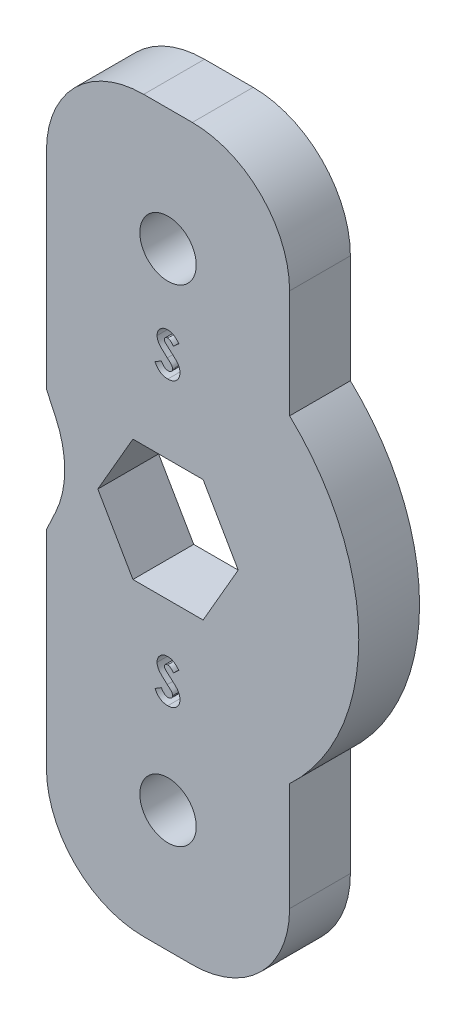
ISO-10303-21;
HEADER;
FILE_DESCRIPTION(('STEP AP214'),'2;1');
FILE_NAME('part.step','',(''),(''),'','','');
FILE_SCHEMA(('AUTOMOTIVE_DESIGN { 1 0 10303 214 1 1 1 1 }'));
ENDSEC;
DATA;
#1=APPLICATION_CONTEXT('core data for automotive mechanical design processes');
#2=APPLICATION_PROTOCOL_DEFINITION('international standard','automotive_design',2000,#1);
#3=PRODUCT_CONTEXT('',#1,'mechanical');
#4=PRODUCT('Part','Part','',(#3));
#5=PRODUCT_RELATED_PRODUCT_CATEGORY('part','',(#4));
#6=PRODUCT_DEFINITION_FORMATION('','',#4);
#7=PRODUCT_DEFINITION_CONTEXT('part definition',#1,'design');
#8=PRODUCT_DEFINITION('design','',#6,#7);
#9=PRODUCT_DEFINITION_SHAPE('','',#8);
#10=(LENGTH_UNIT() NAMED_UNIT(*) SI_UNIT(.MILLI.,.METRE.));
#11=(NAMED_UNIT(*) PLANE_ANGLE_UNIT() SI_UNIT($,.RADIAN.));
#12=(NAMED_UNIT(*) SI_UNIT($,.STERADIAN.) SOLID_ANGLE_UNIT());
#13=UNCERTAINTY_MEASURE_WITH_UNIT(LENGTH_MEASURE(1.E-05),#10,'distance_accuracy_value','');
#14=(GEOMETRIC_REPRESENTATION_CONTEXT(3) GLOBAL_UNCERTAINTY_ASSIGNED_CONTEXT((#13)) GLOBAL_UNIT_ASSIGNED_CONTEXT((#10,
#11,#12)) REPRESENTATION_CONTEXT('',''));
#15=CARTESIAN_POINT('',(0.,0.,0.));
#16=DIRECTION('',(0.,0.,1.));
#17=DIRECTION('',(1.,0.,0.));
#18=AXIS2_PLACEMENT_3D('',#15,#16,#17);
#19=CARTESIAN_POINT('',(12.7,15.875,3.175));
#20=DIRECTION('',(-1.,0.,0.));
#21=DIRECTION('',(0.,0.,1.));
#22=AXIS2_PLACEMENT_3D('',#19,#20,#21);
#23=PLANE('',#22);
#24=DIRECTION('',(0.,0.,-1.));
#25=VECTOR('',#24,1.);
#26=CARTESIAN_POINT('',(12.7,10.7334834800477,3.175));
#27=LINE('',#26,#25);
#28=CARTESIAN_POINT('',(12.7,10.7334834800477,3.175));
#29=VERTEX_POINT('',#28);
#30=CARTESIAN_POINT('',(12.7,10.7334834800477,0.));
#31=VERTEX_POINT('',#30);
#32=EDGE_CURVE('E362',#29,#31,#27,.T.);
#33=ORIENTED_EDGE('',*,*,#32,.F.);
#34=DIRECTION('',(0.,1.,0.));
#35=VECTOR('',#34,1.);
#36=CARTESIAN_POINT('',(12.7,15.875,3.175));
#37=LINE('',#36,#35);
#38=CARTESIAN_POINT('',(12.7,5.08,3.175));
#39=VERTEX_POINT('',#38);
#40=EDGE_CURVE('E497',#39,#29,#37,.T.);
#41=ORIENTED_EDGE('',*,*,#40,.F.);
#42=DIRECTION('',(0.,0.,-1.));
#43=VECTOR('',#42,1.);
#44=CARTESIAN_POINT('',(12.7,5.08,3.175));
#45=LINE('',#44,#43);
#46=CARTESIAN_POINT('',(12.7,5.08,0.));
#47=VERTEX_POINT('',#46);
#48=EDGE_CURVE('E385',#39,#47,#45,.T.);
#49=ORIENTED_EDGE('',*,*,#48,.T.);
#50=DIRECTION('',(0.,1.,0.));
#51=VECTOR('',#50,1.);
#52=CARTESIAN_POINT('',(12.7,15.875,0.));
#53=LINE('',#52,#51);
#54=EDGE_CURVE('E379',#47,#31,#53,.T.);
#55=ORIENTED_EDGE('',*,*,#54,.T.);
#56=EDGE_LOOP('',(#33,#41,#49,#55));
#57=FACE_BOUND('',#56,.T.);
#58=ADVANCED_FACE('F33',(#57),#23,.F.);
#59=CARTESIAN_POINT('',(12.7,38.1,3.175));
#60=DIRECTION('',(-1.,0.,0.));
#61=DIRECTION('',(0.,0.,1.));
#62=AXIS2_PLACEMENT_3D('',#59,#60,#61);
#63=PLANE('',#62);
#64=DIRECTION('',(0.,0.,-1.));
#65=VECTOR('',#64,1.);
#66=CARTESIAN_POINT('',(12.7,27.3665165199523,3.175));
#67=LINE('',#66,#65);
#68=CARTESIAN_POINT('',(12.7,27.3665165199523,0.));
#69=VERTEX_POINT('',#68);
#70=CARTESIAN_POINT('',(12.7,27.3665165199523,3.175));
#71=VERTEX_POINT('',#70);
#72=EDGE_CURVE('E11',#69,#71,#67,.F.);
#73=ORIENTED_EDGE('',*,*,#72,.F.);
#74=DIRECTION('',(0.,1.,0.));
#75=VECTOR('',#74,1.);
#76=CARTESIAN_POINT('',(12.7,38.1,0.));
#77=LINE('',#76,#75);
#78=CARTESIAN_POINT('',(12.7,33.02,0.));
#79=VERTEX_POINT('',#78);
#80=EDGE_CURVE('E381',#69,#79,#77,.T.);
#81=ORIENTED_EDGE('',*,*,#80,.T.);
#82=DIRECTION('',(0.,0.,-1.));
#83=VECTOR('',#82,1.);
#84=CARTESIAN_POINT('',(12.7,33.02,3.175));
#85=LINE('',#84,#83);
#86=CARTESIAN_POINT('',(12.7,33.02,3.175));
#87=VERTEX_POINT('',#86);
#88=EDGE_CURVE('E439',#79,#87,#85,.F.);
#89=ORIENTED_EDGE('',*,*,#88,.T.);
#90=DIRECTION('',(0.,1.,0.));
#91=VECTOR('',#90,1.);
#92=CARTESIAN_POINT('',(12.7,38.1,3.175));
#93=LINE('',#92,#91);
#94=EDGE_CURVE('E494',#71,#87,#93,.T.);
#95=ORIENTED_EDGE('',*,*,#94,.F.);
#96=EDGE_LOOP('',(#73,#81,#89,#95));
#97=FACE_BOUND('',#96,.T.);
#98=ADVANCED_FACE('F542',(#97),#63,.F.);
#99=CARTESIAN_POINT('',(0.,0.,3.175));
#100=DIRECTION('',(0.,0.,-1.));
#101=DIRECTION('',(-1.,0.,0.));
#102=AXIS2_PLACEMENT_3D('',#99,#100,#101);
#103=PLANE('',#102);
#104=ORIENTED_EDGE('',*,*,#40,.T.);
#105=CARTESIAN_POINT('',(4.933397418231,19.05,3.175));
#106=DIRECTION('',(0.,0.,1.));
#107=DIRECTION('',(-1.,0.,0.));
#108=AXIS2_PLACEMENT_3D('',#105,#106,#107);
#109=CIRCLE('',#108,11.3791283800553);
#110=EDGE_CURVE('E368',#29,#71,#109,.T.);
#111=ORIENTED_EDGE('',*,*,#110,.T.);
#112=ORIENTED_EDGE('',*,*,#94,.T.);
#113=CARTESIAN_POINT('',(7.62,33.02,3.175));
#114=DIRECTION('',(0.,0.,-1.));
#115=DIRECTION('',(-1.,0.,0.));
#116=AXIS2_PLACEMENT_3D('',#113,#114,#115);
#117=CIRCLE('',#116,5.08);
#118=CARTESIAN_POINT('',(7.62,38.1,3.175));
#119=VERTEX_POINT('',#118);
#120=EDGE_CURVE('E430',#87,#119,#117,.F.);
#121=ORIENTED_EDGE('',*,*,#120,.T.);
#122=DIRECTION('',(-1.,0.,0.));
#123=VECTOR('',#122,1.);
#124=CARTESIAN_POINT('',(0.,38.1,3.175));
#125=LINE('',#124,#123);
#126=CARTESIAN_POINT('',(5.08,38.1,3.175));
#127=VERTEX_POINT('',#126);
#128=EDGE_CURVE('E492',#119,#127,#125,.T.);
#129=ORIENTED_EDGE('',*,*,#128,.T.);
#130=CARTESIAN_POINT('',(5.08,33.02,3.175));
#131=DIRECTION('',(0.,0.,-1.));
#132=DIRECTION('',(-1.,0.,0.));
#133=AXIS2_PLACEMENT_3D('',#130,#131,#132);
#134=CIRCLE('',#133,5.08);
#135=CARTESIAN_POINT('',(0.,33.02,3.175));
#136=VERTEX_POINT('',#135);
#137=EDGE_CURVE('E426',#127,#136,#134,.F.);
#138=ORIENTED_EDGE('',*,*,#137,.T.);
#139=DIRECTION('',(0.,-1.,0.));
#140=VECTOR('',#139,1.);
#141=CARTESIAN_POINT('',(0.,38.1,3.175));
#142=LINE('',#141,#140);
#143=CARTESIAN_POINT('',(0.,22.225,3.175));
#144=VERTEX_POINT('',#143);
#145=EDGE_CURVE('E481',#136,#144,#142,.T.);
#146=ORIENTED_EDGE('',*,*,#145,.T.);
#147=DIRECTION('',(0.422478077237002,-0.906373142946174,0.));
#148=VECTOR('',#147,1.);
#149=CARTESIAN_POINT('',(0.,22.225,3.175));
#150=LINE('',#149,#148);
#151=CARTESIAN_POINT('',(0.479548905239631,21.196188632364,3.175));
#152=VERTEX_POINT('',#151);
#153=EDGE_CURVE('E462',#144,#152,#150,.T.);
#154=ORIENTED_EDGE('',*,*,#153,.T.);
#155=CARTESIAN_POINT('',(-4.12482666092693,19.05,3.175));
#156=DIRECTION('',(0.,0.,-1.));
#157=DIRECTION('',(-1.,0.,0.));
#158=AXIS2_PLACEMENT_3D('',#155,#156,#157);
#159=CIRCLE('',#158,5.08);
#160=CARTESIAN_POINT('',(0.479548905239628,16.903811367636,3.175));
#161=VERTEX_POINT('',#160);
#162=EDGE_CURVE('E41',#152,#161,#159,.T.);
#163=ORIENTED_EDGE('',*,*,#162,.T.);
#164=DIRECTION('',(-0.422478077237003,-0.906373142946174,0.));
#165=VECTOR('',#164,1.);
#166=CARTESIAN_POINT('',(1.47992899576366,19.05,3.175));
#167=LINE('',#166,#165);
#168=CARTESIAN_POINT('',(0.,15.875,3.175));
#169=VERTEX_POINT('',#168);
#170=EDGE_CURVE('E409',#161,#169,#167,.T.);
#171=ORIENTED_EDGE('',*,*,#170,.T.);
#172=DIRECTION('',(0.,-1.,0.));
#173=VECTOR('',#172,1.);
#174=CARTESIAN_POINT('',(0.,15.875,3.175));
#175=LINE('',#174,#173);
#176=CARTESIAN_POINT('',(0.,5.08,3.175));
#177=VERTEX_POINT('',#176);
#178=EDGE_CURVE('E404',#169,#177,#175,.T.);
#179=ORIENTED_EDGE('',*,*,#178,.T.);
#180=CARTESIAN_POINT('',(5.08,5.08,3.175));
#181=DIRECTION('',(0.,0.,-1.));
#182=DIRECTION('',(-1.,0.,0.));
#183=AXIS2_PLACEMENT_3D('',#180,#181,#182);
#184=CIRCLE('',#183,5.08);
#185=CARTESIAN_POINT('',(5.08,0.,3.175));
#186=VERTEX_POINT('',#185);
#187=EDGE_CURVE('E428',#177,#186,#184,.F.);
#188=ORIENTED_EDGE('',*,*,#187,.T.);
#189=DIRECTION('',(1.,0.,0.));
#190=VECTOR('',#189,1.);
#191=CARTESIAN_POINT('',(12.7,0.,3.175));
#192=LINE('',#191,#190);
#193=CARTESIAN_POINT('',(7.62,0.,3.175));
#194=VERTEX_POINT('',#193);
#195=EDGE_CURVE('E516',#186,#194,#192,.T.);
#196=ORIENTED_EDGE('',*,*,#195,.T.);
#197=CARTESIAN_POINT('',(7.62,5.08,3.175));
#198=DIRECTION('',(0.,0.,-1.));
#199=DIRECTION('',(-1.,0.,0.));
#200=AXIS2_PLACEMENT_3D('',#197,#198,#199);
#201=CIRCLE('',#200,5.08);
#202=EDGE_CURVE('E432',#194,#39,#201,.F.);
#203=ORIENTED_EDGE('',*,*,#202,.T.);
#204=EDGE_LOOP('',(#104,#111,#112,#121,#129,#138,#146,#154,#163,#171,#179,#188,#196,#203));
#205=FACE_BOUND('',#204,.T.);
#206=CARTESIAN_POINT('',(6.33341266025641,13.2991553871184,3.175));
#207=CARTESIAN_POINT('',(6.35835176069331,13.2982430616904,3.175));
#208=CARTESIAN_POINT('',(6.40803310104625,13.2964256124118,3.175));
#209=CARTESIAN_POINT('',(6.48148839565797,13.2822137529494,3.175));
#210=CARTESIAN_POINT('',(6.5532364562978,13.2598641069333,3.175));
#211=CARTESIAN_POINT('',(6.61105238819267,13.2329017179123,3.175));
#212=CARTESIAN_POINT('',(6.65705544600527,13.2067832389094,3.175));
#213=CARTESIAN_POINT('',(6.692312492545,13.1827366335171,3.175));
#214=CARTESIAN_POINT('',(6.72818843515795,13.1551899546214,3.175));
#215=CARTESIAN_POINT('',(6.7649725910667,13.1240563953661,3.175));
#216=CARTESIAN_POINT('',(6.8019814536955,13.0887493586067,3.175));
#217=CARTESIAN_POINT('',(6.84026736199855,13.0501093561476,3.175));
#218=CARTESIAN_POINT('',(6.87930862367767,13.0078024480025,3.175));
#219=CARTESIAN_POINT('',(6.9046792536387,12.977578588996,3.175));
#220=CARTESIAN_POINT('',(6.91770085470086,12.9620660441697,3.175));
#221=B_SPLINE_CURVE_WITH_KNOTS('',3,(#206,#207,#208,#209,#210,#211,#212,#213,#214,#215,#216,
#217,#218,#219,#220),.UNSPECIFIED.,.F.,.F.,(4,1,1,1,1,1,1,1,1,1,1,1,4),(0.,0.1069102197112,
0.212976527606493,0.319776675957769,0.428556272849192,0.485856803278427,0.546558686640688,
0.611431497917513,0.679820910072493,0.753158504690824,0.830752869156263,0.913133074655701,1.),.UNSPECIFIED.);
#222=CARTESIAN_POINT('',(6.33341266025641,13.2991553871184,3.175));
#223=VERTEX_POINT('',#222);
#224=CARTESIAN_POINT('',(6.91770085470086,12.9620660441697,3.175));
#225=VERTEX_POINT('',#224);
#226=EDGE_CURVE('E48',#223,#225,#221,.T.);
#227=ORIENTED_EDGE('',*,*,#226,.T.);
#228=DIRECTION('',(-0.73779374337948,-0.675026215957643,0.));
#229=VECTOR('',#228,1.);
#230=CARTESIAN_POINT('',(6.91770085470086,12.9620660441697,3.175));
#231=LINE('',#230,#229);
#232=CARTESIAN_POINT('',(6.63361298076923,12.7021468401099,3.175));
#233=VERTEX_POINT('',#232);
#234=EDGE_CURVE('E1452',#225,#233,#231,.T.);
#235=ORIENTED_EDGE('',*,*,#234,.T.);
#236=CARTESIAN_POINT('',(6.63361298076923,12.7021468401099,3.175));
#237=CARTESIAN_POINT('',(6.6214438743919,12.7193126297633,3.175));
#238=CARTESIAN_POINT('',(6.59808088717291,12.7522685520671,3.175));
#239=CARTESIAN_POINT('',(6.56021192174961,12.7963973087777,3.175));
#240=CARTESIAN_POINT('',(6.52251395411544,12.8340424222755,3.175));
#241=CARTESIAN_POINT('',(6.484637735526,12.8650466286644,3.175));
#242=CARTESIAN_POINT('',(6.44624754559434,12.889221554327,3.175));
#243=CARTESIAN_POINT('',(6.40741002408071,12.9063376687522,3.175));
#244=CARTESIAN_POINT('',(6.36834535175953,12.9172185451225,3.175));
#245=CARTESIAN_POINT('',(6.34209992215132,12.9185734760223,3.175));
#246=CARTESIAN_POINT('',(6.32917254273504,12.9192408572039,3.175));
#247=B_SPLINE_CURVE_WITH_KNOTS('',3,(#236,#237,#238,#239,#240,#241,#242,#243,#244,#245,#246),
.UNSPECIFIED.,.F.,.F.,(4,1,1,1,1,1,1,1,4),(0.,0.162420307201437,0.31182433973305,
0.448432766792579,0.573381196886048,0.689077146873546,0.797572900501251,0.900293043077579,1.),.UNSPECIFIED.);
#248=CARTESIAN_POINT('',(6.32917254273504,12.9192408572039,3.175));
#249=VERTEX_POINT('',#248);
#250=EDGE_CURVE('E1458',#233,#249,#247,.T.);
#251=ORIENTED_EDGE('',*,*,#250,.T.);
#252=CARTESIAN_POINT('',(6.32917254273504,12.9192408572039,3.175));
#253=CARTESIAN_POINT('',(6.31711425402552,12.9188179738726,3.175));
#254=CARTESIAN_POINT('',(6.2938328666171,12.9180014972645,3.175));
#255=CARTESIAN_POINT('',(6.26064352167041,12.9098857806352,3.175));
#256=CARTESIAN_POINT('',(6.23117754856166,12.8958792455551,3.175));
#257=CARTESIAN_POINT('',(6.20546370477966,12.8775645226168,3.175));
#258=CARTESIAN_POINT('',(6.18509454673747,12.8554995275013,3.175));
#259=CARTESIAN_POINT('',(6.16883135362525,12.8323590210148,3.175));
#260=CARTESIAN_POINT('',(6.15967380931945,12.8068171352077,3.175));
#261=CARTESIAN_POINT('',(6.15846849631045,12.7892739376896,3.175));
#262=CARTESIAN_POINT('',(6.1578717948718,12.7805890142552,3.175));
#263=B_SPLINE_CURVE_WITH_KNOTS('',3,(#252,#253,#254,#255,#256,#257,#258,#259,#260,#261,#262),
.UNSPECIFIED.,.F.,.F.,(4,1,1,1,1,1,1,1,4),(0.,0.148126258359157,0.285992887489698,
0.416634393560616,0.547379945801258,0.671582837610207,0.784400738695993,0.893265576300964,1.),.UNSPECIFIED.);
#264=CARTESIAN_POINT('',(6.1578717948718,12.7805890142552,3.175));
#265=VERTEX_POINT('',#264);
#266=EDGE_CURVE('E1463',#249,#265,#263,.T.);
#267=ORIENTED_EDGE('',*,*,#266,.T.);
#268=CARTESIAN_POINT('',(6.1578717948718,12.7805890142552,3.175));
#269=CARTESIAN_POINT('',(6.15824571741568,12.7717788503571,3.175));
#270=CARTESIAN_POINT('',(6.15899874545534,12.7540364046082,3.175));
#271=CARTESIAN_POINT('',(6.1662719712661,12.7280326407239,3.175));
#272=CARTESIAN_POINT('',(6.17723479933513,12.7026239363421,3.175));
#273=CARTESIAN_POINT('',(6.18771022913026,12.6871564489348,3.175));
#274=CARTESIAN_POINT('',(6.19306477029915,12.6792502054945,3.175));
#275=B_SPLINE_CURVE_WITH_KNOTS('',3,(#268,#269,#270,#271,#272,#273,#274),.UNSPECIFIED.,.F.,.F.,
(4,1,1,1,4),(0.,0.241881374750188,0.487115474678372,0.737837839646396,1.),.UNSPECIFIED.);
#276=CARTESIAN_POINT('',(6.19306477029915,12.6792502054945,3.175));
#277=VERTEX_POINT('',#276);
#278=EDGE_CURVE('E1471',#265,#277,#275,.T.);
#279=ORIENTED_EDGE('',*,*,#278,.T.);
#280=CARTESIAN_POINT('',(6.19306477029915,12.6792502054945,3.175));
#281=CARTESIAN_POINT('',(6.19793262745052,12.6731047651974,3.175));
#282=CARTESIAN_POINT('',(6.20913779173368,12.6589587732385,3.175));
#283=CARTESIAN_POINT('',(6.23050374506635,12.6365537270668,3.175));
#284=CARTESIAN_POINT('',(6.25733489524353,12.6091055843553,3.175));
#285=CARTESIAN_POINT('',(6.29066376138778,12.5775582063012,3.175));
#286=CARTESIAN_POINT('',(6.32910677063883,12.5407770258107,3.175));
#287=CARTESIAN_POINT('',(6.37444580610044,12.5002079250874,3.175));
#288=CARTESIAN_POINT('',(6.42537581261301,12.4545945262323,3.175));
#289=CARTESIAN_POINT('',(6.46157568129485,12.4228310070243,3.175));
#290=CARTESIAN_POINT('',(6.48054473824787,12.4061866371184,3.175));
#291=B_SPLINE_CURVE_WITH_KNOTS('',3,(#280,#281,#282,#283,#284,#285,#286,#287,#288,#289,#290),
.UNSPECIFIED.,.F.,.F.,(4,1,1,1,1,1,1,1,4),(0.,0.0592341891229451,0.136349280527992,
0.233805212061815,0.349411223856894,0.483179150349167,0.635966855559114,0.809243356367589,1.),.UNSPECIFIED.);
#292=CARTESIAN_POINT('',(6.48054473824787,12.4061866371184,3.175));
#293=VERTEX_POINT('',#292);
#294=EDGE_CURVE('E1479',#277,#293,#291,.T.);
#295=ORIENTED_EDGE('',*,*,#294,.T.);
#296=CARTESIAN_POINT('',(6.48054473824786,12.4061866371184,3.175));
#297=CARTESIAN_POINT('',(6.49834992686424,12.3907771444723,3.175));
#298=CARTESIAN_POINT('',(6.5321404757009,12.3615331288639,3.175));
#299=CARTESIAN_POINT('',(6.58021771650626,12.3200259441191,3.175));
#300=CARTESIAN_POINT('',(6.62246960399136,12.2826829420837,3.175));
#301=CARTESIAN_POINT('',(6.65951165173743,12.2500645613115,3.175));
#302=CARTESIAN_POINT('',(6.690782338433,12.2218285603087,3.175));
#303=CARTESIAN_POINT('',(6.71641312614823,12.1978399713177,3.175));
#304=CARTESIAN_POINT('',(6.73671705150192,12.178565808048,3.175));
#305=CARTESIAN_POINT('',(6.74825864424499,12.166924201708,3.175));
#306=CARTESIAN_POINT('',(6.7531842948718,12.1619558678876,3.175));
#307=B_SPLINE_CURVE_WITH_KNOTS('',3,(#296,#297,#298,#299,#300,#301,#302,#303,#304,#305,#306),
.UNSPECIFIED.,.F.,.F.,(4,1,1,1,1,1,1,1,4),(0.,0.192952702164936,0.366184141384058,
0.52045729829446,0.655012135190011,0.770624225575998,0.865677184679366,0.942674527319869,1.),.UNSPECIFIED.);
#308=CARTESIAN_POINT('',(6.7531842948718,12.1619558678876,3.175));
#309=VERTEX_POINT('',#308);
#310=EDGE_CURVE('E1487',#293,#309,#307,.T.);
#311=ORIENTED_EDGE('',*,*,#310,.T.);
#312=CARTESIAN_POINT('',(6.7531842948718,12.1619558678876,3.175));
#313=CARTESIAN_POINT('',(6.77187118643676,12.1417326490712,3.175));
#314=CARTESIAN_POINT('',(6.80779395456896,12.1028565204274,3.175));
#315=CARTESIAN_POINT('',(6.85448088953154,12.0426107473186,3.175));
#316=CARTESIAN_POINT('',(6.89290574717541,11.9837985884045,3.175));
#317=CARTESIAN_POINT('',(6.92263194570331,11.9253133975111,3.175));
#318=CARTESIAN_POINT('',(6.94508236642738,11.8663113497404,3.175));
#319=CARTESIAN_POINT('',(6.96091021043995,11.805345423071,3.175));
#320=CARTESIAN_POINT('',(6.97038961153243,11.741778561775,3.175));
#321=CARTESIAN_POINT('',(6.97144204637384,11.6984019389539,3.175));
#322=CARTESIAN_POINT('',(6.97197435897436,11.6764624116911,3.175));
#323=B_SPLINE_CURVE_WITH_KNOTS('',3,(#312,#313,#314,#315,#316,#317,#318,#319,#320,#321,#322),
.UNSPECIFIED.,.F.,.F.,(4,1,1,1,1,1,1,1,4),(0.,0.150833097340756,0.289954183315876,
0.417138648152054,0.535255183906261,0.648751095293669,0.762405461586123,0.879826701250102,1.),.UNSPECIFIED.);
#324=CARTESIAN_POINT('',(6.97197435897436,11.6764624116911,3.175));
#325=VERTEX_POINT('',#324);
#326=EDGE_CURVE('E1495',#309,#325,#323,.T.);
#327=ORIENTED_EDGE('',*,*,#326,.T.);
#328=CARTESIAN_POINT('',(6.97197435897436,11.6764624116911,3.175));
#329=CARTESIAN_POINT('',(6.97159547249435,11.6550850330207,3.175));
#330=CARTESIAN_POINT('',(6.97085208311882,11.6131418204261,3.175));
#331=CARTESIAN_POINT('',(6.96174698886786,11.5517641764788,3.175));
#332=CARTESIAN_POINT('',(6.94876365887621,11.4930231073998,3.175));
#333=CARTESIAN_POINT('',(6.92868915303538,11.4375577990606,3.175));
#334=CARTESIAN_POINT('',(6.9042224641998,11.3844578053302,3.175));
#335=CARTESIAN_POINT('',(6.87354993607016,11.3345502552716,3.175));
#336=CARTESIAN_POINT('',(6.83752925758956,11.2873300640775,3.175));
#337=CARTESIAN_POINT('',(6.79624402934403,11.2436413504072,3.175));
#338=CARTESIAN_POINT('',(6.75057766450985,11.2039968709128,3.175));
#339=CARTESIAN_POINT('',(6.70159614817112,11.1687044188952,3.175));
#340=CARTESIAN_POINT('',(6.64882051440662,11.1395660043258,3.175));
#341=CARTESIAN_POINT('',(6.59270166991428,11.1155725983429,3.175));
#342=CARTESIAN_POINT('',(6.53326965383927,11.0970925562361,3.175));
#343=CARTESIAN_POINT('',(6.4705952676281,11.0834340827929,3.175));
#344=CARTESIAN_POINT('',(6.40458264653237,11.0752364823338,3.175));
#345=CARTESIAN_POINT('',(6.35944226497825,11.0743795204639,3.175));
#346=CARTESIAN_POINT('',(6.33638074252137,11.0739417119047,3.175));
#347=B_SPLINE_CURVE_WITH_KNOTS('',3,(#328,#329,#330,#331,#332,#333,#334,#335,#336,#337,#338,
#339,#340,#341,#342,#343,#344,#345,#346),.UNSPECIFIED.,.F.,.F.,(4,1,1,1,1,1,1,1,1,1,1,1,1,1,1,1,
4),(0.,0.0652008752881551,0.127926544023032,0.189046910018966,0.248543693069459,
0.307607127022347,0.367247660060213,0.426963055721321,0.488617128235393,0.550391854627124,
0.611330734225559,0.672556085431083,0.734024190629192,0.797340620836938,0.862249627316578,
0.929625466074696,1.),.UNSPECIFIED.);
#348=CARTESIAN_POINT('',(6.33638074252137,11.0739417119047,3.175));
#349=VERTEX_POINT('',#348);
#350=EDGE_CURVE('E1503',#325,#349,#347,.T.);
#351=ORIENTED_EDGE('',*,*,#350,.T.);
#352=CARTESIAN_POINT('',(6.33638074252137,11.0739417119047,3.175));
#353=CARTESIAN_POINT('',(6.31827764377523,11.0742628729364,3.175));
#354=CARTESIAN_POINT('',(6.28242312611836,11.0748989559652,3.175));
#355=CARTESIAN_POINT('',(6.22957898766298,11.0800920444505,3.175));
#356=CARTESIAN_POINT('',(6.17855199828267,11.0884731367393,3.175));
#357=CARTESIAN_POINT('',(6.12939963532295,11.1004857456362,3.175));
#358=CARTESIAN_POINT('',(6.08190045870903,11.1157073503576,3.175));
#359=CARTESIAN_POINT('',(6.03605251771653,11.1342999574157,3.175));
#360=CARTESIAN_POINT('',(5.99217231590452,11.1565517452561,3.175));
#361=CARTESIAN_POINT('',(5.94992783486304,11.1820051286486,3.175));
#362=CARTESIAN_POINT('',(5.90952443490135,11.2115598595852,3.175));
#363=CARTESIAN_POINT('',(5.87045123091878,11.244611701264,3.175));
#364=CARTESIAN_POINT('',(5.83309633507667,11.2816690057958,3.175));
#365=CARTESIAN_POINT('',(5.79728033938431,11.3226441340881,3.175));
#366=CARTESIAN_POINT('',(5.76323240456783,11.3676531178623,3.175));
#367=CARTESIAN_POINT('',(5.72983801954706,11.4160691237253,3.175));
#368=CARTESIAN_POINT('',(5.69858133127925,11.4687906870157,3.175));
#369=CARTESIAN_POINT('',(5.67927268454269,11.5057752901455,3.175));
#370=CARTESIAN_POINT('',(5.66941025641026,11.5246662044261,3.175));
#371=B_SPLINE_CURVE_WITH_KNOTS('',3,(#352,#353,#354,#355,#356,#357,#358,#359,#360,#361,#362,
#363,#364,#365,#366,#367,#368,#369,#370),.UNSPECIFIED.,.F.,.F.,(4,1,1,1,1,1,1,1,1,1,1,1,1,1,1,1,
4),(0.,0.0635514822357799,0.125868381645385,0.186240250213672,0.244976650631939,
0.303357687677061,0.361230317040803,0.418489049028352,0.475936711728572,0.534203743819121,
0.594059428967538,0.655468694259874,0.718771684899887,0.784974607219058,0.853522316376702,
0.92518245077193,1.),.UNSPECIFIED.);
#372=CARTESIAN_POINT('',(5.66941025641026,11.5246662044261,3.175));
#373=VERTEX_POINT('',#372);
#374=EDGE_CURVE('E1511',#349,#373,#371,.T.);
#375=ORIENTED_EDGE('',*,*,#374,.T.);
#376=DIRECTION('',(0.85739690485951,0.514655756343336,0.));
#377=VECTOR('',#376,1.);
#378=CARTESIAN_POINT('',(5.66941025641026,11.5246662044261,3.175));
#379=LINE('',#378,#377);
#380=CARTESIAN_POINT('',(6.00353151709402,11.7252237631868,3.175));
#381=VERTEX_POINT('',#380);
#382=EDGE_CURVE('E1519',#373,#381,#379,.T.);
#383=ORIENTED_EDGE('',*,*,#382,.T.);
#384=CARTESIAN_POINT('',(6.00353151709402,11.7252237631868,3.175));
#385=CARTESIAN_POINT('',(6.01586794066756,11.7037801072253,3.175));
#386=CARTESIAN_POINT('',(6.0395179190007,11.6626707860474,3.175));
#387=CARTESIAN_POINT('',(6.07959501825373,11.6074352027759,3.175));
#388=CARTESIAN_POINT('',(6.12065196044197,11.5601350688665,3.175));
#389=CARTESIAN_POINT('',(6.1636379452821,11.5216064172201,3.175));
#390=CARTESIAN_POINT('',(6.20803027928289,11.4913340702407,3.175));
#391=CARTESIAN_POINT('',(6.25404338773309,11.4696993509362,3.175));
#392=CARTESIAN_POINT('',(6.30170959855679,11.4563074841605,3.175));
#393=CARTESIAN_POINT('',(6.33417765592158,11.4546720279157,3.175));
#394=CARTESIAN_POINT('',(6.35037313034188,11.4538562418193,3.175));
#395=B_SPLINE_CURVE_WITH_KNOTS('',3,(#384,#385,#386,#387,#388,#389,#390,#391,#392,#393,#394),
.UNSPECIFIED.,.F.,.F.,(4,1,1,1,1,1,1,1,4),(0.,0.160457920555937,0.307611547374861,
0.442138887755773,0.566229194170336,0.681222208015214,0.78955800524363,0.895028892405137,1.),.UNSPECIFIED.);
#396=CARTESIAN_POINT('',(6.35037313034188,11.4538562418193,3.175));
#397=VERTEX_POINT('',#396);
#398=EDGE_CURVE('E1525',#381,#397,#395,.T.);
#399=ORIENTED_EDGE('',*,*,#398,.T.);
#400=CARTESIAN_POINT('',(6.35037313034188,11.4538562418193,3.175));
#401=CARTESIAN_POINT('',(6.36684624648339,11.4545224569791,3.175));
#402=CARTESIAN_POINT('',(6.39880649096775,11.4558150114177,3.175));
#403=CARTESIAN_POINT('',(6.44442565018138,11.4677539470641,3.175));
#404=CARTESIAN_POINT('',(6.48625102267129,11.4864989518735,3.175));
#405=CARTESIAN_POINT('',(6.52240456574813,11.513245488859,3.175));
#406=CARTESIAN_POINT('',(6.55301710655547,11.544115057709,3.175));
#407=CARTESIAN_POINT('',(6.57561091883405,11.5784588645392,3.175));
#408=CARTESIAN_POINT('',(6.58980450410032,11.6156180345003,3.175));
#409=CARTESIAN_POINT('',(6.59130511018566,11.6414312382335,3.175));
#410=CARTESIAN_POINT('',(6.59205982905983,11.6544138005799,3.175));
#411=B_SPLINE_CURVE_WITH_KNOTS('',3,(#400,#401,#402,#403,#404,#405,#406,#407,#408,#409,#410),
.UNSPECIFIED.,.F.,.F.,(4,1,1,1,1,1,1,1,4),(0.,0.141985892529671,0.275473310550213,
0.40434584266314,0.535429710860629,0.661427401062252,0.777866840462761,0.888279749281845,1.),.UNSPECIFIED.);
#412=CARTESIAN_POINT('',(6.59205982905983,11.6544138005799,3.175));
#413=VERTEX_POINT('',#412);
#414=EDGE_CURVE('E1530',#397,#413,#411,.T.);
#415=ORIENTED_EDGE('',*,*,#414,.T.);
#416=CARTESIAN_POINT('',(6.59205982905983,11.6544138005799,3.175));
#417=CARTESIAN_POINT('',(6.5913628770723,11.6664919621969,3.175));
#418=CARTESIAN_POINT('',(6.58994708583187,11.6910275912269,3.175));
#419=CARTESIAN_POINT('',(6.57951880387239,11.7275081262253,3.175));
#420=CARTESIAN_POINT('',(6.56321621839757,11.7639720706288,3.175));
#421=CARTESIAN_POINT('',(6.54392911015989,11.7938807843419,3.175));
#422=CARTESIAN_POINT('',(6.52430206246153,11.8189225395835,3.175));
#423=CARTESIAN_POINT('',(6.50553417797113,11.8406200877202,3.175));
#424=CARTESIAN_POINT('',(6.48267985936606,11.8645920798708,3.175));
#425=CARTESIAN_POINT('',(6.45579705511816,11.8908686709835,3.175));
#426=CARTESIAN_POINT('',(6.42524095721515,11.919681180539,3.175));
#427=CARTESIAN_POINT('',(6.39098582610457,11.9510267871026,3.175));
#428=CARTESIAN_POINT('',(6.35263940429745,11.9846293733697,3.175));
#429=CARTESIAN_POINT('',(6.32553607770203,12.0075191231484,3.175));
#430=CARTESIAN_POINT('',(6.3113640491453,12.0194879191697,3.175));
#431=B_SPLINE_CURVE_WITH_KNOTS('',3,(#416,#417,#418,#419,#420,#421,#422,#423,#424,#425,#426,
#427,#428,#429,#430),.UNSPECIFIED.,.F.,.F.,(4,1,1,1,1,1,1,1,1,1,1,1,4),(0.,0.076346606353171,
0.155090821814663,0.238351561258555,0.328404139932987,0.37938385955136,0.439617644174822,
0.509831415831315,0.588874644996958,0.677436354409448,0.775546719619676,0.882635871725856,1.),.UNSPECIFIED.);
#432=CARTESIAN_POINT('',(6.3113640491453,12.0194879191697,3.175));
#433=VERTEX_POINT('',#432);
#434=EDGE_CURVE('E1538',#413,#433,#431,.T.);
#435=ORIENTED_EDGE('',*,*,#434,.T.);
#436=CARTESIAN_POINT('',(6.3113640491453,12.0194879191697,3.175));
#437=CARTESIAN_POINT('',(6.28442245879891,12.0422830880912,3.175));
#438=CARTESIAN_POINT('',(6.23271339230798,12.0860339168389,3.175));
#439=CARTESIAN_POINT('',(6.15964192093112,12.1506525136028,3.175));
#440=CARTESIAN_POINT('',(6.09379798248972,12.2110445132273,3.175));
#441=CARTESIAN_POINT('',(6.03575027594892,12.2679564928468,3.175));
#442=CARTESIAN_POINT('',(5.98475918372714,12.3203374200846,3.175));
#443=CARTESIAN_POINT('',(5.94117003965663,12.3686127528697,3.175));
#444=CARTESIAN_POINT('',(5.9054616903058,12.4131548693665,3.175));
#445=CARTESIAN_POINT('',(5.86788635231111,12.4659120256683,3.175));
#446=CARTESIAN_POINT('',(5.83218226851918,12.530200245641,3.175));
#447=CARTESIAN_POINT('',(5.80132380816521,12.6075464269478,3.175));
#448=CARTESIAN_POINT('',(5.78130414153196,12.6848827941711,3.175));
#449=CARTESIAN_POINT('',(5.77906121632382,12.7368021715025,3.175));
#450=CARTESIAN_POINT('',(5.77795726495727,12.7623565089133,3.175));
#451=B_SPLINE_CURVE_WITH_KNOTS('',3,(#436,#437,#438,#439,#440,#441,#442,#443,#444,#445,#446,
#447,#448,#449,#450),.UNSPECIFIED.,.F.,.F.,(4,1,1,1,1,1,1,1,1,1,1,1,4),(0.,0.112124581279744,
0.21520100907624,0.309902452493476,0.39595909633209,0.473447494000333,0.542140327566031,
0.602523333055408,0.654726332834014,0.747804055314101,0.835278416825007,0.918925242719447,1.),.UNSPECIFIED.);
#452=CARTESIAN_POINT('',(5.77795726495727,12.7623565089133,3.175));
#453=VERTEX_POINT('',#452);
#454=EDGE_CURVE('E1546',#433,#453,#451,.T.);
#455=ORIENTED_EDGE('',*,*,#454,.T.);
#456=CARTESIAN_POINT('',(5.77795726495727,12.7623565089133,3.175));
#457=CARTESIAN_POINT('',(5.77841639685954,12.7804782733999,3.175));
#458=CARTESIAN_POINT('',(5.77932093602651,12.8161800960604,3.175));
#459=CARTESIAN_POINT('',(5.78738956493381,12.8686744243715,3.175));
#460=CARTESIAN_POINT('',(5.79944843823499,12.9193270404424,3.175));
#461=CARTESIAN_POINT('',(5.81696138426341,12.9679531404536,3.175));
#462=CARTESIAN_POINT('',(5.83969107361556,13.0144918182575,3.175));
#463=CARTESIAN_POINT('',(5.8672953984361,13.0591709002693,3.175));
#464=CARTESIAN_POINT('',(5.90020300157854,13.1015791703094,3.175));
#465=CARTESIAN_POINT('',(5.93728764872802,13.1416885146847,3.175));
#466=CARTESIAN_POINT('',(5.97814543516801,13.1783438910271,3.175));
#467=CARTESIAN_POINT('',(6.02180717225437,13.2106959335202,3.175));
#468=CARTESIAN_POINT('',(6.06802573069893,13.2380209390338,3.175));
#469=CARTESIAN_POINT('',(6.11651836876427,13.2606890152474,3.175));
#470=CARTESIAN_POINT('',(6.16758557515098,13.2780399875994,3.175));
#471=CARTESIAN_POINT('',(6.22085114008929,13.2903392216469,3.175));
#472=CARTESIAN_POINT('',(6.2763914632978,13.297654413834,3.175));
#473=CARTESIAN_POINT('',(6.31416879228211,13.2986488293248,3.175));
#474=CARTESIAN_POINT('',(6.33341266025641,13.2991553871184,3.175));
#475=B_SPLINE_CURVE_WITH_KNOTS('',3,(#456,#457,#458,#459,#460,#461,#462,#463,#464,#465,#466,
#467,#468,#469,#470,#471,#472,#473,#474),.UNSPECIFIED.,.F.,.F.,(4,1,1,1,1,1,1,1,1,1,1,1,1,1,1,1,
4),(0.,0.0631728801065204,0.124457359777,0.184840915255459,0.244566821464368,0.304319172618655,
0.365199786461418,0.427420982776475,0.491261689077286,0.555499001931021,0.618604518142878,
0.680494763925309,0.742473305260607,0.80499066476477,0.868251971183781,0.932887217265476,1.),.UNSPECIFIED.);
#476=EDGE_CURVE('E1554',#453,#223,#475,.T.);
#477=ORIENTED_EDGE('',*,*,#476,.T.);
#478=EDGE_LOOP('',(#227,#235,#251,#267,#279,#295,#311,#327,#351,#375,#383,#399,#415,#435,#455,#477));
#479=FACE_BOUND('',#478,.T.);
#480=DIRECTION('',(-0.5,0.866025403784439,0.));
#481=VECTOR('',#480,1.);
#482=CARTESIAN_POINT('',(10.0161742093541,19.05,3.175));
#483=LINE('',#482,#481);
#484=CARTESIAN_POINT('',(10.0161742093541,19.05,3.175));
#485=VERTEX_POINT('',#484);
#486=CARTESIAN_POINT('',(8.18308710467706,22.225,3.175));
#487=VERTEX_POINT('',#486);
#488=EDGE_CURVE('E844',#485,#487,#483,.T.);
#489=ORIENTED_EDGE('',*,*,#488,.F.);
#490=DIRECTION('',(0.5,0.866025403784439,0.));
#491=VECTOR('',#490,1.);
#492=CARTESIAN_POINT('',(8.18308710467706,15.875,3.175));
#493=LINE('',#492,#491);
#494=CARTESIAN_POINT('',(8.18308710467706,15.875,3.175));
#495=VERTEX_POINT('',#494);
#496=EDGE_CURVE('E856',#495,#485,#493,.T.);
#497=ORIENTED_EDGE('',*,*,#496,.F.);
#498=DIRECTION('',(1.,0.,0.));
#499=VECTOR('',#498,1.);
#500=CARTESIAN_POINT('',(4.51691289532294,15.875,3.175));
#501=LINE('',#500,#499);
#502=CARTESIAN_POINT('',(4.51691289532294,15.875,3.175));
#503=VERTEX_POINT('',#502);
#504=EDGE_CURVE('E853',#503,#495,#501,.T.);
#505=ORIENTED_EDGE('',*,*,#504,.F.);
#506=DIRECTION('',(0.5,-0.866025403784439,0.));
#507=VECTOR('',#506,1.);
#508=CARTESIAN_POINT('',(2.68382579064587,19.05,3.175));
#509=LINE('',#508,#507);
#510=CARTESIAN_POINT('',(2.68382579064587,19.05,3.175));
#511=VERTEX_POINT('',#510);
#512=EDGE_CURVE('E851',#511,#503,#509,.T.);
#513=ORIENTED_EDGE('',*,*,#512,.F.);
#514=DIRECTION('',(-0.5,-0.866025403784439,0.));
#515=VECTOR('',#514,1.);
#516=CARTESIAN_POINT('',(4.51691289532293,22.225,3.175));
#517=LINE('',#516,#515);
#518=CARTESIAN_POINT('',(4.51691289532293,22.225,3.175));
#519=VERTEX_POINT('',#518);
#520=EDGE_CURVE('E849',#519,#511,#517,.T.);
#521=ORIENTED_EDGE('',*,*,#520,.F.);
#522=DIRECTION('',(-1.,0.,0.));
#523=VECTOR('',#522,1.);
#524=CARTESIAN_POINT('',(8.18308710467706,22.225,3.175));
#525=LINE('',#524,#523);
#526=EDGE_CURVE('E846',#487,#519,#525,.T.);
#527=ORIENTED_EDGE('',*,*,#526,.F.);
#528=EDGE_LOOP('',(#489,#497,#505,#513,#521,#527));
#529=FACE_BOUND('',#528,.T.);
#530=CARTESIAN_POINT('',(6.35,31.75,3.175));
#531=DIRECTION('',(0.,0.,-1.));
#532=DIRECTION('',(-1.,0.,0.));
#533=AXIS2_PLACEMENT_3D('',#530,#531,#532);
#534=CIRCLE('',#533,1.4732);
#535=CARTESIAN_POINT('',(4.8768,31.75,3.175));
#536=VERTEX_POINT('',#535);
#537=EDGE_CURVE('E840',#536,#536,#534,.T.);
#538=ORIENTED_EDGE('',*,*,#537,.T.);
#539=EDGE_LOOP('',(#538));
#540=FACE_BOUND('',#539,.T.);
#541=CARTESIAN_POINT('',(6.35,6.35,3.175));
#542=DIRECTION('',(0.,0.,-1.));
#543=DIRECTION('',(-1.,0.,0.));
#544=AXIS2_PLACEMENT_3D('',#541,#542,#543);
#545=CIRCLE('',#544,1.4732);
#546=CARTESIAN_POINT('',(4.8768,6.35,3.175));
#547=VERTEX_POINT('',#546);
#548=EDGE_CURVE('E834',#547,#547,#545,.T.);
#549=ORIENTED_EDGE('',*,*,#548,.T.);
#550=EDGE_LOOP('',(#549));
#551=FACE_BOUND('',#550,.T.);
#552=CARTESIAN_POINT('',(6.33341266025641,28.0772658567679,3.175));
#553=CARTESIAN_POINT('',(6.35835176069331,28.0763535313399,3.175));
#554=CARTESIAN_POINT('',(6.40803310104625,28.0745360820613,3.175));
#555=CARTESIAN_POINT('',(6.48148839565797,28.0603242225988,3.175));
#556=CARTESIAN_POINT('',(6.5532364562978,28.0379745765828,3.175));
#557=CARTESIAN_POINT('',(6.61105238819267,28.0110121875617,3.175));
#558=CARTESIAN_POINT('',(6.65705544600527,27.9848937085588,3.175));
#559=CARTESIAN_POINT('',(6.692312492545,27.9608471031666,3.175));
#560=CARTESIAN_POINT('',(6.72818843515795,27.9333004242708,3.175));
#561=CARTESIAN_POINT('',(6.7649725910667,27.9021668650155,3.175));
#562=CARTESIAN_POINT('',(6.8019814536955,27.8668598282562,3.175));
#563=CARTESIAN_POINT('',(6.84026736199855,27.828219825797,3.175));
#564=CARTESIAN_POINT('',(6.87930862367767,27.7859129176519,3.175));
#565=CARTESIAN_POINT('',(6.9046792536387,27.7556890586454,3.175));
#566=CARTESIAN_POINT('',(6.91770085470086,27.7401765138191,3.175));
#567=B_SPLINE_CURVE_WITH_KNOTS('',3,(#552,#553,#554,#555,#556,#557,#558,#559,#560,#561,#562,
#563,#564,#565,#566),.UNSPECIFIED.,.F.,.F.,(4,1,1,1,1,1,1,1,1,1,1,1,4),(0.,0.1069102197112,
0.212976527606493,0.319776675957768,0.428556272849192,0.485856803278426,0.546558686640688,
0.611431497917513,0.679820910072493,0.753158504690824,0.830752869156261,0.913133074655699,1.),.UNSPECIFIED.);
#568=CARTESIAN_POINT('',(6.33341266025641,28.0772658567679,3.175));
#569=VERTEX_POINT('',#568);
#570=CARTESIAN_POINT('',(6.91770085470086,27.7401765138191,3.175));
#571=VERTEX_POINT('',#570);
#572=EDGE_CURVE('E922',#569,#571,#567,.T.);
#573=ORIENTED_EDGE('',*,*,#572,.T.);
#574=DIRECTION('',(-0.73779374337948,-0.675026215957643,0.));
#575=VECTOR('',#574,1.);
#576=CARTESIAN_POINT('',(6.91770085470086,27.7401765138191,3.175));
#577=LINE('',#576,#575);
#578=CARTESIAN_POINT('',(6.63361298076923,27.4802573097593,3.175));
#579=VERTEX_POINT('',#578);
#580=EDGE_CURVE('E920',#571,#579,#577,.T.);
#581=ORIENTED_EDGE('',*,*,#580,.T.);
#582=CARTESIAN_POINT('',(6.63361298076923,27.4802573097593,3.175));
#583=CARTESIAN_POINT('',(6.6214438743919,27.4974230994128,3.175));
#584=CARTESIAN_POINT('',(6.59808088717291,27.5303790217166,3.175));
#585=CARTESIAN_POINT('',(6.56021192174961,27.5745077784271,3.175));
#586=CARTESIAN_POINT('',(6.52251395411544,27.6121528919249,3.175));
#587=CARTESIAN_POINT('',(6.484637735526,27.6431570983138,3.175));
#588=CARTESIAN_POINT('',(6.44624754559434,27.6673320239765,3.175));
#589=CARTESIAN_POINT('',(6.40741002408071,27.6844481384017,3.175));
#590=CARTESIAN_POINT('',(6.36834535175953,27.695329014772,3.175));
#591=CARTESIAN_POINT('',(6.34209992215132,27.6966839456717,3.175));
#592=CARTESIAN_POINT('',(6.32917254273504,27.6973513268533,3.175));
#593=B_SPLINE_CURVE_WITH_KNOTS('',3,(#582,#583,#584,#585,#586,#587,#588,#589,#590,#591,#592),
.UNSPECIFIED.,.F.,.F.,(4,1,1,1,1,1,1,1,4),(0.,0.162420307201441,0.311824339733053,
0.448432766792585,0.573381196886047,0.689077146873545,0.797572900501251,0.900293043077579,1.),.UNSPECIFIED.);
#594=CARTESIAN_POINT('',(6.32917254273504,27.6973513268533,3.175));
#595=VERTEX_POINT('',#594);
#596=EDGE_CURVE('E915',#579,#595,#593,.T.);
#597=ORIENTED_EDGE('',*,*,#596,.T.);
#598=CARTESIAN_POINT('',(6.32917254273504,27.6973513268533,3.175));
#599=CARTESIAN_POINT('',(6.31711425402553,27.696928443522,3.175));
#600=CARTESIAN_POINT('',(6.2938328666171,27.696111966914,3.175));
#601=CARTESIAN_POINT('',(6.2606435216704,27.6879962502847,3.175));
#602=CARTESIAN_POINT('',(6.23117754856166,27.6739897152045,3.175));
#603=CARTESIAN_POINT('',(6.20546370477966,27.6556749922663,3.175));
#604=CARTESIAN_POINT('',(6.18509454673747,27.6336099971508,3.175));
#605=CARTESIAN_POINT('',(6.16883135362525,27.6104694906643,3.175));
#606=CARTESIAN_POINT('',(6.15967380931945,27.5849276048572,3.175));
#607=CARTESIAN_POINT('',(6.15846849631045,27.567384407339,3.175));
#608=CARTESIAN_POINT('',(6.1578717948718,27.5586994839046,3.175));
#609=B_SPLINE_CURVE_WITH_KNOTS('',3,(#598,#599,#600,#601,#602,#603,#604,#605,#606,#607,#608),
.UNSPECIFIED.,.F.,.F.,(4,1,1,1,1,1,1,1,4),(0.,0.148126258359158,0.285992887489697,
0.416634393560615,0.547379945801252,0.671582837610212,0.784400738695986,0.893265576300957,1.),.UNSPECIFIED.);
#610=CARTESIAN_POINT('',(6.1578717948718,27.5586994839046,3.175));
#611=VERTEX_POINT('',#610);
#612=EDGE_CURVE('E919',#595,#611,#609,.T.);
#613=ORIENTED_EDGE('',*,*,#612,.T.);
#614=CARTESIAN_POINT('',(6.1578717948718,27.5586994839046,3.175));
#615=CARTESIAN_POINT('',(6.15824571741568,27.5498893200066,3.175));
#616=CARTESIAN_POINT('',(6.15899874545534,27.5321468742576,3.175));
#617=CARTESIAN_POINT('',(6.1662719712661,27.5061431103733,3.175));
#618=CARTESIAN_POINT('',(6.17723479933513,27.4807344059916,3.175));
#619=CARTESIAN_POINT('',(6.18771022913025,27.4652669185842,3.175));
#620=CARTESIAN_POINT('',(6.19306477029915,27.4573606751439,3.175));
#621=B_SPLINE_CURVE_WITH_KNOTS('',3,(#614,#615,#616,#617,#618,#619,#620),.UNSPECIFIED.,.F.,.F.,
(4,1,1,1,4),(0.,0.241881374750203,0.487115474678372,0.737837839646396,1.),.UNSPECIFIED.);
#622=CARTESIAN_POINT('',(6.19306477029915,27.4573606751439,3.175));
#623=VERTEX_POINT('',#622);
#624=EDGE_CURVE('E937',#611,#623,#621,.T.);
#625=ORIENTED_EDGE('',*,*,#624,.T.);
#626=CARTESIAN_POINT('',(6.19306477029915,27.4573606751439,3.175));
#627=CARTESIAN_POINT('',(6.19793262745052,27.4512152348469,3.175));
#628=CARTESIAN_POINT('',(6.20913779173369,27.437069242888,3.175));
#629=CARTESIAN_POINT('',(6.23050374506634,27.4146641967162,3.175));
#630=CARTESIAN_POINT('',(6.25733489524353,27.3872160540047,3.175));
#631=CARTESIAN_POINT('',(6.29066376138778,27.3556686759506,3.175));
#632=CARTESIAN_POINT('',(6.32910677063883,27.3188874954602,3.175));
#633=CARTESIAN_POINT('',(6.37444580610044,27.2783183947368,3.175));
#634=CARTESIAN_POINT('',(6.42537581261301,27.2327049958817,3.175));
#635=CARTESIAN_POINT('',(6.46157568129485,27.2009414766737,3.175));
#636=CARTESIAN_POINT('',(6.48054473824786,27.1842971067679,3.175));
#637=B_SPLINE_CURVE_WITH_KNOTS('',3,(#626,#627,#628,#629,#630,#631,#632,#633,#634,#635,#636),
.UNSPECIFIED.,.F.,.F.,(4,1,1,1,1,1,1,1,4),(0.,0.0592341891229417,0.136349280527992,
0.233805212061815,0.349411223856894,0.48317915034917,0.635966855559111,0.809243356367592,1.),.UNSPECIFIED.);
#638=CARTESIAN_POINT('',(6.48054473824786,27.1842971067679,3.175));
#639=VERTEX_POINT('',#638);
#640=EDGE_CURVE('E945',#623,#639,#637,.T.);
#641=ORIENTED_EDGE('',*,*,#640,.T.);
#642=CARTESIAN_POINT('',(6.48054473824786,27.1842971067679,3.175));
#643=CARTESIAN_POINT('',(6.49834992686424,27.1688876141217,3.175));
#644=CARTESIAN_POINT('',(6.5321404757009,27.1396435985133,3.175));
#645=CARTESIAN_POINT('',(6.58021771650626,27.0981364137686,3.175));
#646=CARTESIAN_POINT('',(6.62246960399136,27.0607934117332,3.175));
#647=CARTESIAN_POINT('',(6.65951165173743,27.028175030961,3.175));
#648=CARTESIAN_POINT('',(6.690782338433,26.9999390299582,3.175));
#649=CARTESIAN_POINT('',(6.71641312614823,26.9759504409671,3.175));
#650=CARTESIAN_POINT('',(6.73671705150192,26.9566762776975,3.175));
#651=CARTESIAN_POINT('',(6.74825864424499,26.9450346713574,3.175));
#652=CARTESIAN_POINT('',(6.7531842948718,26.9400663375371,3.175));
#653=B_SPLINE_CURVE_WITH_KNOTS('',3,(#642,#643,#644,#645,#646,#647,#648,#649,#650,#651,#652),
.UNSPECIFIED.,.F.,.F.,(4,1,1,1,1,1,1,1,4),(0.,0.192952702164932,0.366184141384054,
0.520457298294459,0.655012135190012,0.770624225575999,0.865677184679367,0.942674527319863,1.),.UNSPECIFIED.);
#654=CARTESIAN_POINT('',(6.7531842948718,26.9400663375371,3.175));
#655=VERTEX_POINT('',#654);
#656=EDGE_CURVE('E953',#639,#655,#653,.T.);
#657=ORIENTED_EDGE('',*,*,#656,.T.);
#658=CARTESIAN_POINT('',(6.7531842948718,26.9400663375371,3.175));
#659=CARTESIAN_POINT('',(6.77187118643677,26.9198431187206,3.175));
#660=CARTESIAN_POINT('',(6.80779395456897,26.8809669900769,3.175));
#661=CARTESIAN_POINT('',(6.85448088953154,26.820721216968,3.175));
#662=CARTESIAN_POINT('',(6.89290574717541,26.7619090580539,3.175));
#663=CARTESIAN_POINT('',(6.92263194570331,26.7034238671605,3.175));
#664=CARTESIAN_POINT('',(6.94508236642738,26.6444218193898,3.175));
#665=CARTESIAN_POINT('',(6.96091021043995,26.5834558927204,3.175));
#666=CARTESIAN_POINT('',(6.97038961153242,26.5198890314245,3.175));
#667=CARTESIAN_POINT('',(6.97144204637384,26.4765124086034,3.175));
#668=CARTESIAN_POINT('',(6.97197435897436,26.4545728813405,3.175));
#669=B_SPLINE_CURVE_WITH_KNOTS('',3,(#658,#659,#660,#661,#662,#663,#664,#665,#666,#667,#668),
.UNSPECIFIED.,.F.,.F.,(4,1,1,1,1,1,1,1,4),(0.,0.150833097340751,0.289954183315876,
0.417138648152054,0.535255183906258,0.648751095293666,0.762405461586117,0.879826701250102,1.),.UNSPECIFIED.);
#670=CARTESIAN_POINT('',(6.97197435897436,26.4545728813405,3.175));
#671=VERTEX_POINT('',#670);
#672=EDGE_CURVE('E750',#655,#671,#669,.T.);
#673=ORIENTED_EDGE('',*,*,#672,.T.);
#674=CARTESIAN_POINT('',(6.97197435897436,26.4545728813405,3.175));
#675=CARTESIAN_POINT('',(6.97159547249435,26.4331955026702,3.175));
#676=CARTESIAN_POINT('',(6.97085208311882,26.3912522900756,3.175));
#677=CARTESIAN_POINT('',(6.96174698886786,26.3298746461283,3.175));
#678=CARTESIAN_POINT('',(6.94876365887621,26.2711335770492,3.175));
#679=CARTESIAN_POINT('',(6.92868915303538,26.21566826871,3.175));
#680=CARTESIAN_POINT('',(6.9042224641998,26.1625682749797,3.175));
#681=CARTESIAN_POINT('',(6.87354993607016,26.1126607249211,3.175));
#682=CARTESIAN_POINT('',(6.83752925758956,26.0654405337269,3.175));
#683=CARTESIAN_POINT('',(6.79624402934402,26.0217518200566,3.175));
#684=CARTESIAN_POINT('',(6.75057766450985,25.9821073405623,3.175));
#685=CARTESIAN_POINT('',(6.70159614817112,25.9468148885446,3.175));
#686=CARTESIAN_POINT('',(6.64882051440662,25.9176764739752,3.175));
#687=CARTESIAN_POINT('',(6.59270166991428,25.8936830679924,3.175));
#688=CARTESIAN_POINT('',(6.53326965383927,25.8752030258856,3.175));
#689=CARTESIAN_POINT('',(6.4705952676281,25.8615445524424,3.175));
#690=CARTESIAN_POINT('',(6.40458264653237,25.8533469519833,3.175));
#691=CARTESIAN_POINT('',(6.35944226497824,25.8524899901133,3.175));
#692=CARTESIAN_POINT('',(6.33638074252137,25.8520521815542,3.175));
#693=B_SPLINE_CURVE_WITH_KNOTS('',3,(#674,#675,#676,#677,#678,#679,#680,#681,#682,#683,#684,
#685,#686,#687,#688,#689,#690,#691,#692),.UNSPECIFIED.,.F.,.F.,(4,1,1,1,1,1,1,1,1,1,1,1,1,1,1,1,
4),(0.,0.0652008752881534,0.127926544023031,0.189046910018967,0.248543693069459,
0.307607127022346,0.367247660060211,0.426963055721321,0.488617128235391,0.550391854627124,
0.611330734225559,0.672556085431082,0.734024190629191,0.797340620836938,0.862249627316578,
0.929625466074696,1.),.UNSPECIFIED.);
#694=CARTESIAN_POINT('',(6.33638074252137,25.8520521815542,3.175));
#695=VERTEX_POINT('',#694);
#696=EDGE_CURVE('E747',#671,#695,#693,.T.);
#697=ORIENTED_EDGE('',*,*,#696,.T.);
#698=CARTESIAN_POINT('',(6.33638074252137,25.8520521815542,3.175));
#699=CARTESIAN_POINT('',(6.31827764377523,25.8523733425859,3.175));
#700=CARTESIAN_POINT('',(6.28242312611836,25.8530094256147,3.175));
#701=CARTESIAN_POINT('',(6.22957898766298,25.8582025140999,3.175));
#702=CARTESIAN_POINT('',(6.17855199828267,25.8665836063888,3.175));
#703=CARTESIAN_POINT('',(6.12939963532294,25.8785962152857,3.175));
#704=CARTESIAN_POINT('',(6.08190045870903,25.893817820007,3.175));
#705=CARTESIAN_POINT('',(6.03605251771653,25.9124104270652,3.175));
#706=CARTESIAN_POINT('',(5.99217231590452,25.9346622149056,3.175));
#707=CARTESIAN_POINT('',(5.94992783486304,25.960115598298,3.175));
#708=CARTESIAN_POINT('',(5.90952443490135,25.9896703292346,3.175));
#709=CARTESIAN_POINT('',(5.87045123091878,26.0227221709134,3.175));
#710=CARTESIAN_POINT('',(5.83309633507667,26.0597794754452,3.175));
#711=CARTESIAN_POINT('',(5.79728033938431,26.1007546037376,3.175));
#712=CARTESIAN_POINT('',(5.76323240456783,26.1457635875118,3.175));
#713=CARTESIAN_POINT('',(5.72983801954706,26.1941795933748,3.175));
#714=CARTESIAN_POINT('',(5.69858133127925,26.2469011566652,3.175));
#715=CARTESIAN_POINT('',(5.67927268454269,26.283885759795,3.175));
#716=CARTESIAN_POINT('',(5.66941025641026,26.3027766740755,3.175));
#717=B_SPLINE_CURVE_WITH_KNOTS('',3,(#698,#699,#700,#701,#702,#703,#704,#705,#706,#707,#708,
#709,#710,#711,#712,#713,#714,#715,#716),.UNSPECIFIED.,.F.,.F.,(4,1,1,1,1,1,1,1,1,1,1,1,1,1,1,1,
4),(0.,0.0635514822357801,0.125868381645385,0.186240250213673,0.244976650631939,
0.303357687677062,0.361230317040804,0.418489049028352,0.475936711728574,0.534203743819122,
0.594059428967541,0.655468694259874,0.718771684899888,0.784974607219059,0.853522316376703,
0.925182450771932,1.),.UNSPECIFIED.);
#718=CARTESIAN_POINT('',(5.66941025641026,26.3027766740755,3.175));
#719=VERTEX_POINT('',#718);
#720=EDGE_CURVE('E740',#695,#719,#717,.T.);
#721=ORIENTED_EDGE('',*,*,#720,.T.);
#722=DIRECTION('',(0.85739690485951,0.514655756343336,0.));
#723=VECTOR('',#722,1.);
#724=CARTESIAN_POINT('',(5.66941025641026,26.3027766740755,3.175));
#725=LINE('',#724,#723);
#726=CARTESIAN_POINT('',(6.00353151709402,26.5033342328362,3.175));
#727=VERTEX_POINT('',#726);
#728=EDGE_CURVE('E730',#719,#727,#725,.T.);
#729=ORIENTED_EDGE('',*,*,#728,.T.);
#730=CARTESIAN_POINT('',(6.00353151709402,26.5033342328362,3.175));
#731=CARTESIAN_POINT('',(6.01586794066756,26.4818905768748,3.175));
#732=CARTESIAN_POINT('',(6.03951791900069,26.4407812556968,3.175));
#733=CARTESIAN_POINT('',(6.07959501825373,26.3855456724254,3.175));
#734=CARTESIAN_POINT('',(6.12065196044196,26.3382455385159,3.175));
#735=CARTESIAN_POINT('',(6.1636379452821,26.2997168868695,3.175));
#736=CARTESIAN_POINT('',(6.20803027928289,26.2694445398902,3.175));
#737=CARTESIAN_POINT('',(6.25404338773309,26.2478098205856,3.175));
#738=CARTESIAN_POINT('',(6.30170959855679,26.23441795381,3.175));
#739=CARTESIAN_POINT('',(6.33417765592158,26.2327824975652,3.175));
#740=CARTESIAN_POINT('',(6.35037313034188,26.2319667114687,3.175));
#741=B_SPLINE_CURVE_WITH_KNOTS('',3,(#730,#731,#732,#733,#734,#735,#736,#737,#738,#739,#740),
.UNSPECIFIED.,.F.,.F.,(4,1,1,1,1,1,1,1,4),(0.,0.160457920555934,0.307611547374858,
0.442138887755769,0.566229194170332,0.681222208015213,0.789558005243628,0.895028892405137,1.),.UNSPECIFIED.);
#742=CARTESIAN_POINT('',(6.35037313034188,26.2319667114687,3.175));
#743=VERTEX_POINT('',#742);
#744=EDGE_CURVE('E739',#727,#743,#741,.T.);
#745=ORIENTED_EDGE('',*,*,#744,.T.);
#746=CARTESIAN_POINT('',(6.35037313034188,26.2319667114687,3.175));
#747=CARTESIAN_POINT('',(6.36684624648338,26.2326329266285,3.175));
#748=CARTESIAN_POINT('',(6.39880649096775,26.2339254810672,3.175));
#749=CARTESIAN_POINT('',(6.44442565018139,26.2458644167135,3.175));
#750=CARTESIAN_POINT('',(6.48625102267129,26.2646094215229,3.175));
#751=CARTESIAN_POINT('',(6.52240456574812,26.2913559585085,3.175));
#752=CARTESIAN_POINT('',(6.55301710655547,26.3222255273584,3.175));
#753=CARTESIAN_POINT('',(6.57561091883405,26.3565693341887,3.175));
#754=CARTESIAN_POINT('',(6.58980450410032,26.3937285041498,3.175));
#755=CARTESIAN_POINT('',(6.59130511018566,26.4195417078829,3.175));
#756=CARTESIAN_POINT('',(6.59205982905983,26.4325242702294,3.175));
#757=B_SPLINE_CURVE_WITH_KNOTS('',3,(#746,#747,#748,#749,#750,#751,#752,#753,#754,#755,#756),
.UNSPECIFIED.,.F.,.F.,(4,1,1,1,1,1,1,1,4),(0.,0.141985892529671,0.275473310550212,
0.404345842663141,0.535429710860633,0.661427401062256,0.777866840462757,0.888279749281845,1.),.UNSPECIFIED.);
#758=CARTESIAN_POINT('',(6.59205982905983,26.4325242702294,3.175));
#759=VERTEX_POINT('',#758);
#760=EDGE_CURVE('E764',#743,#759,#757,.T.);
#761=ORIENTED_EDGE('',*,*,#760,.T.);
#762=CARTESIAN_POINT('',(6.59205982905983,26.4325242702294,3.175));
#763=CARTESIAN_POINT('',(6.5913628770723,26.4446024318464,3.175));
#764=CARTESIAN_POINT('',(6.58994708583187,26.4691380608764,3.175));
#765=CARTESIAN_POINT('',(6.57951880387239,26.5056185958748,3.175));
#766=CARTESIAN_POINT('',(6.56321621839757,26.5420825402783,3.175));
#767=CARTESIAN_POINT('',(6.54392911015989,26.5719912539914,3.175));
#768=CARTESIAN_POINT('',(6.52430206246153,26.5970330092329,3.175));
#769=CARTESIAN_POINT('',(6.50553417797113,26.6187305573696,3.175));
#770=CARTESIAN_POINT('',(6.48267985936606,26.6427025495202,3.175));
#771=CARTESIAN_POINT('',(6.45579705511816,26.668979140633,3.175));
#772=CARTESIAN_POINT('',(6.42524095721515,26.6977916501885,3.175));
#773=CARTESIAN_POINT('',(6.39098582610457,26.7291372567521,3.175));
#774=CARTESIAN_POINT('',(6.35263940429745,26.7627398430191,3.175));
#775=CARTESIAN_POINT('',(6.32553607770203,26.7856295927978,3.175));
#776=CARTESIAN_POINT('',(6.3113640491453,26.7975983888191,3.175));
#777=B_SPLINE_CURVE_WITH_KNOTS('',3,(#762,#763,#764,#765,#766,#767,#768,#769,#770,#771,#772,
#773,#774,#775,#776),.UNSPECIFIED.,.F.,.F.,(4,1,1,1,1,1,1,1,1,1,1,1,4),(0.,0.0763466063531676,
0.155090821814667,0.238351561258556,0.328404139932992,0.379383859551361,0.43961764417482,
0.509831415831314,0.588874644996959,0.67743635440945,0.775546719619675,0.882635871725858,1.),.UNSPECIFIED.);
#778=CARTESIAN_POINT('',(6.3113640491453,26.7975983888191,3.175));
#779=VERTEX_POINT('',#778);
#780=EDGE_CURVE('E772',#759,#779,#777,.T.);
#781=ORIENTED_EDGE('',*,*,#780,.T.);
#782=CARTESIAN_POINT('',(6.3113640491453,26.7975983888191,3.175));
#783=CARTESIAN_POINT('',(6.28442245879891,26.8203935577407,3.175));
#784=CARTESIAN_POINT('',(6.23271339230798,26.8641443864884,3.175));
#785=CARTESIAN_POINT('',(6.15964192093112,26.9287629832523,3.175));
#786=CARTESIAN_POINT('',(6.09379798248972,26.9891549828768,3.175));
#787=CARTESIAN_POINT('',(6.03575027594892,27.0460669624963,3.175));
#788=CARTESIAN_POINT('',(5.98475918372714,27.0984478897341,3.175));
#789=CARTESIAN_POINT('',(5.94117003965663,27.1467232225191,3.175));
#790=CARTESIAN_POINT('',(5.9054616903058,27.191265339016,3.175));
#791=CARTESIAN_POINT('',(5.8678863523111,27.2440224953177,3.175));
#792=CARTESIAN_POINT('',(5.83218226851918,27.3083107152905,3.175));
#793=CARTESIAN_POINT('',(5.80132380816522,27.3856568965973,3.175));
#794=CARTESIAN_POINT('',(5.78130414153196,27.4629932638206,3.175));
#795=CARTESIAN_POINT('',(5.77906121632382,27.5149126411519,3.175));
#796=CARTESIAN_POINT('',(5.77795726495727,27.5404669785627,3.175));
#797=B_SPLINE_CURVE_WITH_KNOTS('',3,(#782,#783,#784,#785,#786,#787,#788,#789,#790,#791,#792,
#793,#794,#795,#796),.UNSPECIFIED.,.F.,.F.,(4,1,1,1,1,1,1,1,1,1,1,1,4),(0.,0.112124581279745,
0.215201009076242,0.309902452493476,0.395959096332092,0.473447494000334,0.542140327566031,
0.60252333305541,0.654726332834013,0.747804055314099,0.835278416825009,0.918925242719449,1.),.UNSPECIFIED.);
#798=CARTESIAN_POINT('',(5.77795726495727,27.5404669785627,3.175));
#799=VERTEX_POINT('',#798);
#800=EDGE_CURVE('E780',#779,#799,#797,.T.);
#801=ORIENTED_EDGE('',*,*,#800,.T.);
#802=CARTESIAN_POINT('',(5.77795726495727,27.5404669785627,3.175));
#803=CARTESIAN_POINT('',(5.77841639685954,27.5585887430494,3.175));
#804=CARTESIAN_POINT('',(5.77932093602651,27.5942905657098,3.175));
#805=CARTESIAN_POINT('',(5.78738956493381,27.646784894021,3.175));
#806=CARTESIAN_POINT('',(5.799448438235,27.6974375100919,3.175));
#807=CARTESIAN_POINT('',(5.81696138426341,27.7460636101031,3.175));
#808=CARTESIAN_POINT('',(5.83969107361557,27.792602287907,3.175));
#809=CARTESIAN_POINT('',(5.8672953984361,27.8372813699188,3.175));
#810=CARTESIAN_POINT('',(5.90020300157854,27.8796896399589,3.175));
#811=CARTESIAN_POINT('',(5.93728764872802,27.9197989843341,3.175));
#812=CARTESIAN_POINT('',(5.97814543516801,27.9564543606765,3.175));
#813=CARTESIAN_POINT('',(6.02180717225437,27.9888064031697,3.175));
#814=CARTESIAN_POINT('',(6.06802573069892,28.0161314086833,3.175));
#815=CARTESIAN_POINT('',(6.11651836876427,28.0387994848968,3.175));
#816=CARTESIAN_POINT('',(6.16758557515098,28.0561504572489,3.175));
#817=CARTESIAN_POINT('',(6.22085114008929,28.0684496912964,3.175));
#818=CARTESIAN_POINT('',(6.2763914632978,28.0757648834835,3.175));
#819=CARTESIAN_POINT('',(6.31416879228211,28.0767592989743,3.175));
#820=CARTESIAN_POINT('',(6.33341266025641,28.0772658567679,3.175));
#821=B_SPLINE_CURVE_WITH_KNOTS('',3,(#802,#803,#804,#805,#806,#807,#808,#809,#810,#811,#812,
#813,#814,#815,#816,#817,#818,#819,#820),.UNSPECIFIED.,.F.,.F.,(4,1,1,1,1,1,1,1,1,1,1,1,1,1,1,1,
4),(0.,0.0631728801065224,0.124457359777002,0.184840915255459,0.244566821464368,
0.304319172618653,0.365199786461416,0.427420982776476,0.491261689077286,0.555499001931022,
0.618604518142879,0.680494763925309,0.742473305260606,0.804990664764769,0.86825197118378,
0.932887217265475,1.),.UNSPECIFIED.);
#822=EDGE_CURVE('E605',#799,#569,#821,.T.);
#823=ORIENTED_EDGE('',*,*,#822,.T.);
#824=EDGE_LOOP('',(#573,#581,#597,#613,#625,#641,#657,#673,#697,#721,#729,#745,#761,#781,#801,#823));
#825=FACE_BOUND('',#824,.T.);
#826=ADVANCED_FACE('F457',(#205,#479,#529,#540,#551,#825),#103,.F.);
#827=CARTESIAN_POINT('',(0.,0.,0.));
#828=DIRECTION('',(0.,0.,-1.));
#829=DIRECTION('',(-1.,0.,0.));
#830=AXIS2_PLACEMENT_3D('',#827,#828,#829);
#831=PLANE('',#830);
#832=CARTESIAN_POINT('',(4.933397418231,19.05,0.));
#833=DIRECTION('',(0.,0.,1.));
#834=DIRECTION('',(-1.,0.,0.));
#835=AXIS2_PLACEMENT_3D('',#832,#833,#834);
#836=CIRCLE('',#835,11.3791283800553);
#837=EDGE_CURVE('E365',#31,#69,#836,.T.);
#838=ORIENTED_EDGE('',*,*,#837,.F.);
#839=ORIENTED_EDGE('',*,*,#54,.F.);
#840=CARTESIAN_POINT('',(7.62,5.08,0.));
#841=DIRECTION('',(0.,0.,-1.));
#842=DIRECTION('',(-1.,0.,0.));
#843=AXIS2_PLACEMENT_3D('',#840,#841,#842);
#844=CIRCLE('',#843,5.08);
#845=CARTESIAN_POINT('',(7.62,0.,0.));
#846=VERTEX_POINT('',#845);
#847=EDGE_CURVE('E419',#47,#846,#844,.T.);
#848=ORIENTED_EDGE('',*,*,#847,.T.);
#849=DIRECTION('',(1.,0.,0.));
#850=VECTOR('',#849,1.);
#851=CARTESIAN_POINT('',(12.7,0.,0.));
#852=LINE('',#851,#850);
#853=CARTESIAN_POINT('',(5.08,0.,0.));
#854=VERTEX_POINT('',#853);
#855=EDGE_CURVE('E386',#854,#846,#852,.T.);
#856=ORIENTED_EDGE('',*,*,#855,.F.);
#857=CARTESIAN_POINT('',(5.08,5.08,0.));
#858=DIRECTION('',(0.,0.,-1.));
#859=DIRECTION('',(-1.,0.,0.));
#860=AXIS2_PLACEMENT_3D('',#857,#858,#859);
#861=CIRCLE('',#860,5.08);
#862=CARTESIAN_POINT('',(0.,5.08,0.));
#863=VERTEX_POINT('',#862);
#864=EDGE_CURVE('E415',#854,#863,#861,.T.);
#865=ORIENTED_EDGE('',*,*,#864,.T.);
#866=DIRECTION('',(0.,-1.,0.));
#867=VECTOR('',#866,1.);
#868=CARTESIAN_POINT('',(0.,15.875,0.));
#869=LINE('',#868,#867);
#870=CARTESIAN_POINT('',(0.,15.875,0.));
#871=VERTEX_POINT('',#870);
#872=EDGE_CURVE('E391',#871,#863,#869,.T.);
#873=ORIENTED_EDGE('',*,*,#872,.F.);
#874=DIRECTION('',(-0.422478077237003,-0.906373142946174,0.));
#875=VECTOR('',#874,1.);
#876=CARTESIAN_POINT('',(1.47992899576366,19.05,0.));
#877=LINE('',#876,#875);
#878=CARTESIAN_POINT('',(0.479548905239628,16.903811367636,0.));
#879=VERTEX_POINT('',#878);
#880=EDGE_CURVE('E402',#879,#871,#877,.T.);
#881=ORIENTED_EDGE('',*,*,#880,.F.);
#882=CARTESIAN_POINT('',(-4.12482666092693,19.05,0.));
#883=DIRECTION('',(0.,0.,-1.));
#884=DIRECTION('',(-1.,0.,0.));
#885=AXIS2_PLACEMENT_3D('',#882,#883,#884);
#886=CIRCLE('',#885,5.08);
#887=CARTESIAN_POINT('',(0.479548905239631,21.196188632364,0.));
#888=VERTEX_POINT('',#887);
#889=EDGE_CURVE('E452',#879,#888,#886,.F.);
#890=ORIENTED_EDGE('',*,*,#889,.T.);
#891=DIRECTION('',(0.422478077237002,-0.906373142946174,0.));
#892=VECTOR('',#891,1.);
#893=CARTESIAN_POINT('',(0.,22.225,0.));
#894=LINE('',#893,#892);
#895=CARTESIAN_POINT('',(0.,22.225,0.));
#896=VERTEX_POINT('',#895);
#897=EDGE_CURVE('E399',#896,#888,#894,.T.);
#898=ORIENTED_EDGE('',*,*,#897,.F.);
#899=DIRECTION('',(0.,-1.,0.));
#900=VECTOR('',#899,1.);
#901=CARTESIAN_POINT('',(0.,38.1,0.));
#902=LINE('',#901,#900);
#903=CARTESIAN_POINT('',(0.,33.02,0.));
#904=VERTEX_POINT('',#903);
#905=EDGE_CURVE('E397',#904,#896,#902,.T.);
#906=ORIENTED_EDGE('',*,*,#905,.F.);
#907=CARTESIAN_POINT('',(5.08,33.02,0.));
#908=DIRECTION('',(0.,0.,-1.));
#909=DIRECTION('',(-1.,0.,0.));
#910=AXIS2_PLACEMENT_3D('',#907,#908,#909);
#911=CIRCLE('',#910,5.08);
#912=CARTESIAN_POINT('',(5.08,38.1,0.));
#913=VERTEX_POINT('',#912);
#914=EDGE_CURVE('E413',#904,#913,#911,.T.);
#915=ORIENTED_EDGE('',*,*,#914,.T.);
#916=DIRECTION('',(-1.,0.,0.));
#917=VECTOR('',#916,1.);
#918=CARTESIAN_POINT('',(0.,38.1,0.));
#919=LINE('',#918,#917);
#920=CARTESIAN_POINT('',(7.62,38.1,0.));
#921=VERTEX_POINT('',#920);
#922=EDGE_CURVE('E388',#921,#913,#919,.T.);
#923=ORIENTED_EDGE('',*,*,#922,.F.);
#924=CARTESIAN_POINT('',(7.62,33.02,0.));
#925=DIRECTION('',(0.,0.,-1.));
#926=DIRECTION('',(-1.,0.,0.));
#927=AXIS2_PLACEMENT_3D('',#924,#925,#926);
#928=CIRCLE('',#927,5.08);
#929=EDGE_CURVE('E417',#921,#79,#928,.T.);
#930=ORIENTED_EDGE('',*,*,#929,.T.);
#931=ORIENTED_EDGE('',*,*,#80,.F.);
#932=EDGE_LOOP('',(#838,#839,#848,#856,#865,#873,#881,#890,#898,#906,#915,#923,#930,#931));
#933=FACE_BOUND('',#932,.T.);
#934=DIRECTION('',(-0.73779374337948,-0.675026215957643,0.));
#935=VECTOR('',#934,1.);
#936=CARTESIAN_POINT('',(6.91770085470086,12.9620660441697,0.));
#937=LINE('',#936,#935);
#938=CARTESIAN_POINT('',(6.91770085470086,12.9620660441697,0.));
#939=VERTEX_POINT('',#938);
#940=CARTESIAN_POINT('',(6.63361298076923,12.7021468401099,0.));
#941=VERTEX_POINT('',#940);
#942=EDGE_CURVE('E1601',#939,#941,#937,.T.);
#943=ORIENTED_EDGE('',*,*,#942,.F.);
#944=CARTESIAN_POINT('',(6.33341266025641,13.2991553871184,0.));
#945=CARTESIAN_POINT('',(6.35835176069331,13.2982430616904,0.));
#946=CARTESIAN_POINT('',(6.40803310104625,13.2964256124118,0.));
#947=CARTESIAN_POINT('',(6.48148839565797,13.2822137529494,0.));
#948=CARTESIAN_POINT('',(6.5532364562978,13.2598641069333,0.));
#949=CARTESIAN_POINT('',(6.61105238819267,13.2329017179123,0.));
#950=CARTESIAN_POINT('',(6.65705544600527,13.2067832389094,0.));
#951=CARTESIAN_POINT('',(6.692312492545,13.1827366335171,0.));
#952=CARTESIAN_POINT('',(6.72818843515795,13.1551899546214,0.));
#953=CARTESIAN_POINT('',(6.7649725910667,13.1240563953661,0.));
#954=CARTESIAN_POINT('',(6.8019814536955,13.0887493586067,0.));
#955=CARTESIAN_POINT('',(6.84026736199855,13.0501093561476,0.));
#956=CARTESIAN_POINT('',(6.87930862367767,13.0078024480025,0.));
#957=CARTESIAN_POINT('',(6.9046792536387,12.977578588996,0.));
#958=CARTESIAN_POINT('',(6.91770085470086,12.9620660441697,0.));
#959=B_SPLINE_CURVE_WITH_KNOTS('',3,(#944,#945,#946,#947,#948,#949,#950,#951,#952,#953,#954,
#955,#956,#957,#958),.UNSPECIFIED.,.F.,.F.,(4,1,1,1,1,1,1,1,1,1,1,1,4),(0.,0.1069102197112,
0.212976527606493,0.319776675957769,0.428556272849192,0.485856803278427,0.546558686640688,
0.611431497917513,0.679820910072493,0.753158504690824,0.830752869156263,0.913133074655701,1.),.UNSPECIFIED.);
#960=CARTESIAN_POINT('',(6.33341266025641,13.2991553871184,0.));
#961=VERTEX_POINT('',#960);
#962=EDGE_CURVE('E1562',#961,#939,#959,.T.);
#963=ORIENTED_EDGE('',*,*,#962,.F.);
#964=CARTESIAN_POINT('',(5.77795726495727,12.7623565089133,0.));
#965=CARTESIAN_POINT('',(5.77841639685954,12.7804782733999,0.));
#966=CARTESIAN_POINT('',(5.77932093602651,12.8161800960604,0.));
#967=CARTESIAN_POINT('',(5.78738956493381,12.8686744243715,0.));
#968=CARTESIAN_POINT('',(5.79944843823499,12.9193270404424,0.));
#969=CARTESIAN_POINT('',(5.81696138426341,12.9679531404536,0.));
#970=CARTESIAN_POINT('',(5.83969107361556,13.0144918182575,0.));
#971=CARTESIAN_POINT('',(5.8672953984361,13.0591709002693,0.));
#972=CARTESIAN_POINT('',(5.90020300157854,13.1015791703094,0.));
#973=CARTESIAN_POINT('',(5.93728764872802,13.1416885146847,0.));
#974=CARTESIAN_POINT('',(5.97814543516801,13.1783438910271,0.));
#975=CARTESIAN_POINT('',(6.02180717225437,13.2106959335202,0.));
#976=CARTESIAN_POINT('',(6.06802573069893,13.2380209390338,0.));
#977=CARTESIAN_POINT('',(6.11651836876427,13.2606890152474,0.));
#978=CARTESIAN_POINT('',(6.16758557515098,13.2780399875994,0.));
#979=CARTESIAN_POINT('',(6.22085114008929,13.2903392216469,0.));
#980=CARTESIAN_POINT('',(6.2763914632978,13.297654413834,0.));
#981=CARTESIAN_POINT('',(6.31416879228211,13.2986488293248,0.));
#982=CARTESIAN_POINT('',(6.33341266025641,13.2991553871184,0.));
#983=B_SPLINE_CURVE_WITH_KNOTS('',3,(#964,#965,#966,#967,#968,#969,#970,#971,#972,#973,#974,
#975,#976,#977,#978,#979,#980,#981,#982),.UNSPECIFIED.,.F.,.F.,(4,1,1,1,1,1,1,1,1,1,1,1,1,1,1,1,
4),(0.,0.0631728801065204,0.124457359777,0.184840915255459,0.244566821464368,0.304319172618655,
0.365199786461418,0.427420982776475,0.491261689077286,0.555499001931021,0.618604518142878,
0.680494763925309,0.742473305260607,0.80499066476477,0.868251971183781,0.932887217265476,1.),.UNSPECIFIED.);
#984=CARTESIAN_POINT('',(5.77795726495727,12.7623565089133,0.));
#985=VERTEX_POINT('',#984);
#986=EDGE_CURVE('E1435',#985,#961,#983,.T.);
#987=ORIENTED_EDGE('',*,*,#986,.F.);
#988=CARTESIAN_POINT('',(6.3113640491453,12.0194879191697,0.));
#989=CARTESIAN_POINT('',(6.28442245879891,12.0422830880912,0.));
#990=CARTESIAN_POINT('',(6.23271339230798,12.0860339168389,0.));
#991=CARTESIAN_POINT('',(6.15964192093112,12.1506525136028,0.));
#992=CARTESIAN_POINT('',(6.09379798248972,12.2110445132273,0.));
#993=CARTESIAN_POINT('',(6.03575027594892,12.2679564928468,0.));
#994=CARTESIAN_POINT('',(5.98475918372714,12.3203374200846,0.));
#995=CARTESIAN_POINT('',(5.94117003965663,12.3686127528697,0.));
#996=CARTESIAN_POINT('',(5.9054616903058,12.4131548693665,0.));
#997=CARTESIAN_POINT('',(5.86788635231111,12.4659120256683,0.));
#998=CARTESIAN_POINT('',(5.83218226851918,12.530200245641,0.));
#999=CARTESIAN_POINT('',(5.80132380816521,12.6075464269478,0.));
#1000=CARTESIAN_POINT('',(5.78130414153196,12.6848827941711,0.));
#1001=CARTESIAN_POINT('',(5.77906121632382,12.7368021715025,0.));
#1002=CARTESIAN_POINT('',(5.77795726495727,12.7623565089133,0.));
#1003=B_SPLINE_CURVE_WITH_KNOTS('',3,(#988,#989,#990,#991,#992,#993,#994,#995,#996,#997,#998,
#999,#1000,#1001,#1002),.UNSPECIFIED.,.F.,.F.,(4,1,1,1,1,1,1,1,1,1,1,1,4),(0.,0.112124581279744,
0.21520100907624,0.309902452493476,0.39595909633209,0.473447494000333,0.542140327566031,
0.602523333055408,0.654726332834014,0.747804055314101,0.835278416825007,0.918925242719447,1.),.UNSPECIFIED.);
#1004=CARTESIAN_POINT('',(6.3113640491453,12.0194879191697,0.));
#1005=VERTEX_POINT('',#1004);
#1006=EDGE_CURVE('E1441',#1005,#985,#1003,.T.);
#1007=ORIENTED_EDGE('',*,*,#1006,.F.);
#1008=CARTESIAN_POINT('',(6.59205982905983,11.6544138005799,0.));
#1009=CARTESIAN_POINT('',(6.5913628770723,11.6664919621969,0.));
#1010=CARTESIAN_POINT('',(6.58994708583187,11.6910275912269,0.));
#1011=CARTESIAN_POINT('',(6.57951880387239,11.7275081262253,0.));
#1012=CARTESIAN_POINT('',(6.56321621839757,11.7639720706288,0.));
#1013=CARTESIAN_POINT('',(6.54392911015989,11.7938807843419,0.));
#1014=CARTESIAN_POINT('',(6.52430206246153,11.8189225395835,0.));
#1015=CARTESIAN_POINT('',(6.50553417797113,11.8406200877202,0.));
#1016=CARTESIAN_POINT('',(6.48267985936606,11.8645920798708,0.));
#1017=CARTESIAN_POINT('',(6.45579705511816,11.8908686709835,0.));
#1018=CARTESIAN_POINT('',(6.42524095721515,11.919681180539,0.));
#1019=CARTESIAN_POINT('',(6.39098582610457,11.9510267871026,0.));
#1020=CARTESIAN_POINT('',(6.35263940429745,11.9846293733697,0.));
#1021=CARTESIAN_POINT('',(6.32553607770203,12.0075191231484,0.));
#1022=CARTESIAN_POINT('',(6.3113640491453,12.0194879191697,0.));
#1023=B_SPLINE_CURVE_WITH_KNOTS('',3,(#1008,#1009,#1010,#1011,#1012,#1013,#1014,#1015,#1016,
#1017,#1018,#1019,#1020,#1021,#1022),.UNSPECIFIED.,.F.,.F.,(4,1,1,1,1,1,1,1,1,1,1,1,4),(0.,
0.076346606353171,0.155090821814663,0.238351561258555,0.328404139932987,0.37938385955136,
0.439617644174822,0.509831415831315,0.588874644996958,0.677436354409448,0.775546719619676,
0.882635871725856,1.),.UNSPECIFIED.);
#1024=CARTESIAN_POINT('',(6.59205982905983,11.6544138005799,0.));
#1025=VERTEX_POINT('',#1024);
#1026=EDGE_CURVE('E1682',#1025,#1005,#1023,.T.);
#1027=ORIENTED_EDGE('',*,*,#1026,.F.);
#1028=CARTESIAN_POINT('',(6.35037313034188,11.4538562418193,0.));
#1029=CARTESIAN_POINT('',(6.36684624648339,11.4545224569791,0.));
#1030=CARTESIAN_POINT('',(6.39880649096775,11.4558150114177,0.));
#1031=CARTESIAN_POINT('',(6.44442565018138,11.4677539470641,0.));
#1032=CARTESIAN_POINT('',(6.48625102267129,11.4864989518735,0.));
#1033=CARTESIAN_POINT('',(6.52240456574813,11.513245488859,0.));
#1034=CARTESIAN_POINT('',(6.55301710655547,11.544115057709,0.));
#1035=CARTESIAN_POINT('',(6.57561091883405,11.5784588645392,0.));
#1036=CARTESIAN_POINT('',(6.58980450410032,11.6156180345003,0.));
#1037=CARTESIAN_POINT('',(6.59130511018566,11.6414312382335,0.));
#1038=CARTESIAN_POINT('',(6.59205982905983,11.6544138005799,0.));
#1039=B_SPLINE_CURVE_WITH_KNOTS('',3,(#1028,#1029,#1030,#1031,#1032,#1033,#1034,#1035,#1036,
#1037,#1038),.UNSPECIFIED.,.F.,.F.,(4,1,1,1,1,1,1,1,4),(0.,0.141985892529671,0.275473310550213,
0.40434584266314,0.535429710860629,0.661427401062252,0.777866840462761,0.888279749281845,1.),.UNSPECIFIED.);
#1040=CARTESIAN_POINT('',(6.35037313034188,11.4538562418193,0.));
#1041=VERTEX_POINT('',#1040);
#1042=EDGE_CURVE('E1675',#1041,#1025,#1039,.T.);
#1043=ORIENTED_EDGE('',*,*,#1042,.F.);
#1044=CARTESIAN_POINT('',(6.00353151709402,11.7252237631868,0.));
#1045=CARTESIAN_POINT('',(6.01586794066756,11.7037801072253,0.));
#1046=CARTESIAN_POINT('',(6.0395179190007,11.6626707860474,0.));
#1047=CARTESIAN_POINT('',(6.07959501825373,11.6074352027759,0.));
#1048=CARTESIAN_POINT('',(6.12065196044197,11.5601350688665,0.));
#1049=CARTESIAN_POINT('',(6.1636379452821,11.5216064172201,0.));
#1050=CARTESIAN_POINT('',(6.20803027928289,11.4913340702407,0.));
#1051=CARTESIAN_POINT('',(6.25404338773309,11.4696993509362,0.));
#1052=CARTESIAN_POINT('',(6.30170959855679,11.4563074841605,0.));
#1053=CARTESIAN_POINT('',(6.33417765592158,11.4546720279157,0.));
#1054=CARTESIAN_POINT('',(6.35037313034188,11.4538562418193,0.));
#1055=B_SPLINE_CURVE_WITH_KNOTS('',3,(#1044,#1045,#1046,#1047,#1048,#1049,#1050,#1051,#1052,
#1053,#1054),.UNSPECIFIED.,.F.,.F.,(4,1,1,1,1,1,1,1,4),(0.,0.160457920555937,0.307611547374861,
0.442138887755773,0.566229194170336,0.681222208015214,0.78955800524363,0.895028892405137,1.),.UNSPECIFIED.);
#1056=CARTESIAN_POINT('',(6.00353151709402,11.7252237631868,0.));
#1057=VERTEX_POINT('',#1056);
#1058=EDGE_CURVE('E1670',#1057,#1041,#1055,.T.);
#1059=ORIENTED_EDGE('',*,*,#1058,.F.);
#1060=DIRECTION('',(0.85739690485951,0.514655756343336,0.));
#1061=VECTOR('',#1060,1.);
#1062=CARTESIAN_POINT('',(5.66941025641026,11.5246662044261,0.));
#1063=LINE('',#1062,#1061);
#1064=CARTESIAN_POINT('',(5.66941025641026,11.5246662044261,0.));
#1065=VERTEX_POINT('',#1064);
#1066=EDGE_CURVE('E1665',#1065,#1057,#1063,.T.);
#1067=ORIENTED_EDGE('',*,*,#1066,.F.);
#1068=CARTESIAN_POINT('',(6.33638074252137,11.0739417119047,0.));
#1069=CARTESIAN_POINT('',(6.31827764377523,11.0742628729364,0.));
#1070=CARTESIAN_POINT('',(6.28242312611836,11.0748989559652,0.));
#1071=CARTESIAN_POINT('',(6.22957898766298,11.0800920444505,0.));
#1072=CARTESIAN_POINT('',(6.17855199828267,11.0884731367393,0.));
#1073=CARTESIAN_POINT('',(6.12939963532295,11.1004857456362,0.));
#1074=CARTESIAN_POINT('',(6.08190045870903,11.1157073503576,0.));
#1075=CARTESIAN_POINT('',(6.03605251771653,11.1342999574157,0.));
#1076=CARTESIAN_POINT('',(5.99217231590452,11.1565517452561,0.));
#1077=CARTESIAN_POINT('',(5.94992783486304,11.1820051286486,0.));
#1078=CARTESIAN_POINT('',(5.90952443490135,11.2115598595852,0.));
#1079=CARTESIAN_POINT('',(5.87045123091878,11.244611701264,0.));
#1080=CARTESIAN_POINT('',(5.83309633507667,11.2816690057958,0.));
#1081=CARTESIAN_POINT('',(5.79728033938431,11.3226441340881,0.));
#1082=CARTESIAN_POINT('',(5.76323240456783,11.3676531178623,0.));
#1083=CARTESIAN_POINT('',(5.72983801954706,11.4160691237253,0.));
#1084=CARTESIAN_POINT('',(5.69858133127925,11.4687906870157,0.));
#1085=CARTESIAN_POINT('',(5.67927268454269,11.5057752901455,0.));
#1086=CARTESIAN_POINT('',(5.66941025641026,11.5246662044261,0.));
#1087=B_SPLINE_CURVE_WITH_KNOTS('',3,(#1068,#1069,#1070,#1071,#1072,#1073,#1074,#1075,#1076,
#1077,#1078,#1079,#1080,#1081,#1082,#1083,#1084,#1085,#1086),.UNSPECIFIED.,.F.,.F.,(4,1,1,1,1,1,
1,1,1,1,1,1,1,1,1,1,4),(0.,0.0635514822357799,0.125868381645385,0.186240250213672,
0.244976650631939,0.303357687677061,0.361230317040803,0.418489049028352,0.475936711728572,
0.534203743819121,0.594059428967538,0.655468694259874,0.718771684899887,0.784974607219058,
0.853522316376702,0.92518245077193,1.),.UNSPECIFIED.);
#1088=CARTESIAN_POINT('',(6.33638074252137,11.0739417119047,0.));
#1089=VERTEX_POINT('',#1088);
#1090=EDGE_CURVE('E1657',#1089,#1065,#1087,.T.);
#1091=ORIENTED_EDGE('',*,*,#1090,.F.);
#1092=CARTESIAN_POINT('',(6.97197435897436,11.6764624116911,0.));
#1093=CARTESIAN_POINT('',(6.97159547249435,11.6550850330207,0.));
#1094=CARTESIAN_POINT('',(6.97085208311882,11.6131418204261,0.));
#1095=CARTESIAN_POINT('',(6.96174698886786,11.5517641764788,0.));
#1096=CARTESIAN_POINT('',(6.94876365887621,11.4930231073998,0.));
#1097=CARTESIAN_POINT('',(6.92868915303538,11.4375577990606,0.));
#1098=CARTESIAN_POINT('',(6.9042224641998,11.3844578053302,0.));
#1099=CARTESIAN_POINT('',(6.87354993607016,11.3345502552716,0.));
#1100=CARTESIAN_POINT('',(6.83752925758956,11.2873300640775,0.));
#1101=CARTESIAN_POINT('',(6.79624402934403,11.2436413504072,0.));
#1102=CARTESIAN_POINT('',(6.75057766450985,11.2039968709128,0.));
#1103=CARTESIAN_POINT('',(6.70159614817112,11.1687044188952,0.));
#1104=CARTESIAN_POINT('',(6.64882051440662,11.1395660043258,0.));
#1105=CARTESIAN_POINT('',(6.59270166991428,11.1155725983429,0.));
#1106=CARTESIAN_POINT('',(6.53326965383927,11.0970925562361,0.));
#1107=CARTESIAN_POINT('',(6.4705952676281,11.0834340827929,0.));
#1108=CARTESIAN_POINT('',(6.40458264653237,11.0752364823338,0.));
#1109=CARTESIAN_POINT('',(6.35944226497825,11.0743795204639,0.));
#1110=CARTESIAN_POINT('',(6.33638074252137,11.0739417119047,0.));
#1111=B_SPLINE_CURVE_WITH_KNOTS('',3,(#1092,#1093,#1094,#1095,#1096,#1097,#1098,#1099,#1100,
#1101,#1102,#1103,#1104,#1105,#1106,#1107,#1108,#1109,#1110),.UNSPECIFIED.,.F.,.F.,(4,1,1,1,1,1,
1,1,1,1,1,1,1,1,1,1,4),(0.,0.0652008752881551,0.127926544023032,0.189046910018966,
0.248543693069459,0.307607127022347,0.367247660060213,0.426963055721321,0.488617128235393,
0.550391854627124,0.611330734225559,0.672556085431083,0.734024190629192,0.797340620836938,
0.862249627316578,0.929625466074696,1.),.UNSPECIFIED.);
#1112=CARTESIAN_POINT('',(6.97197435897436,11.6764624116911,0.));
#1113=VERTEX_POINT('',#1112);
#1114=EDGE_CURVE('E1653',#1113,#1089,#1111,.T.);
#1115=ORIENTED_EDGE('',*,*,#1114,.F.);
#1116=CARTESIAN_POINT('',(6.7531842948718,12.1619558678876,0.));
#1117=CARTESIAN_POINT('',(6.77187118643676,12.1417326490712,0.));
#1118=CARTESIAN_POINT('',(6.80779395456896,12.1028565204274,0.));
#1119=CARTESIAN_POINT('',(6.85448088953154,12.0426107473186,0.));
#1120=CARTESIAN_POINT('',(6.89290574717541,11.9837985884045,0.));
#1121=CARTESIAN_POINT('',(6.92263194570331,11.9253133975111,0.));
#1122=CARTESIAN_POINT('',(6.94508236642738,11.8663113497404,0.));
#1123=CARTESIAN_POINT('',(6.96091021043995,11.805345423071,0.));
#1124=CARTESIAN_POINT('',(6.97038961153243,11.741778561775,0.));
#1125=CARTESIAN_POINT('',(6.97144204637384,11.6984019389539,0.));
#1126=CARTESIAN_POINT('',(6.97197435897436,11.6764624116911,0.));
#1127=B_SPLINE_CURVE_WITH_KNOTS('',3,(#1116,#1117,#1118,#1119,#1120,#1121,#1122,#1123,#1124,
#1125,#1126),.UNSPECIFIED.,.F.,.F.,(4,1,1,1,1,1,1,1,4),(0.,0.150833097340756,0.289954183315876,
0.417138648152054,0.535255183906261,0.648751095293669,0.762405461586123,0.879826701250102,1.),.UNSPECIFIED.);
#1128=CARTESIAN_POINT('',(6.7531842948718,12.1619558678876,0.));
#1129=VERTEX_POINT('',#1128);
#1130=EDGE_CURVE('E1644',#1129,#1113,#1127,.T.);
#1131=ORIENTED_EDGE('',*,*,#1130,.F.);
#1132=CARTESIAN_POINT('',(6.48054473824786,12.4061866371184,0.));
#1133=CARTESIAN_POINT('',(6.49834992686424,12.3907771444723,0.));
#1134=CARTESIAN_POINT('',(6.5321404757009,12.3615331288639,0.));
#1135=CARTESIAN_POINT('',(6.58021771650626,12.3200259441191,0.));
#1136=CARTESIAN_POINT('',(6.62246960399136,12.2826829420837,0.));
#1137=CARTESIAN_POINT('',(6.65951165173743,12.2500645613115,0.));
#1138=CARTESIAN_POINT('',(6.690782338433,12.2218285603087,0.));
#1139=CARTESIAN_POINT('',(6.71641312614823,12.1978399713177,0.));
#1140=CARTESIAN_POINT('',(6.73671705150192,12.178565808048,0.));
#1141=CARTESIAN_POINT('',(6.74825864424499,12.166924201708,0.));
#1142=CARTESIAN_POINT('',(6.7531842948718,12.1619558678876,0.));
#1143=B_SPLINE_CURVE_WITH_KNOTS('',3,(#1132,#1133,#1134,#1135,#1136,#1137,#1138,#1139,#1140,
#1141,#1142),.UNSPECIFIED.,.F.,.F.,(4,1,1,1,1,1,1,1,4),(0.,0.192952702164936,0.366184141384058,
0.52045729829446,0.655012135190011,0.770624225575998,0.865677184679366,0.942674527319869,1.),.UNSPECIFIED.);
#1144=CARTESIAN_POINT('',(6.48054473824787,12.4061866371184,0.));
#1145=VERTEX_POINT('',#1144);
#1146=EDGE_CURVE('E1636',#1145,#1129,#1143,.T.);
#1147=ORIENTED_EDGE('',*,*,#1146,.F.);
#1148=CARTESIAN_POINT('',(6.19306477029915,12.6792502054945,0.));
#1149=CARTESIAN_POINT('',(6.19793262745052,12.6731047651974,0.));
#1150=CARTESIAN_POINT('',(6.20913779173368,12.6589587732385,0.));
#1151=CARTESIAN_POINT('',(6.23050374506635,12.6365537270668,0.));
#1152=CARTESIAN_POINT('',(6.25733489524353,12.6091055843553,0.));
#1153=CARTESIAN_POINT('',(6.29066376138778,12.5775582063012,0.));
#1154=CARTESIAN_POINT('',(6.32910677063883,12.5407770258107,0.));
#1155=CARTESIAN_POINT('',(6.37444580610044,12.5002079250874,0.));
#1156=CARTESIAN_POINT('',(6.42537581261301,12.4545945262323,0.));
#1157=CARTESIAN_POINT('',(6.46157568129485,12.4228310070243,0.));
#1158=CARTESIAN_POINT('',(6.48054473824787,12.4061866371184,0.));
#1159=B_SPLINE_CURVE_WITH_KNOTS('',3,(#1148,#1149,#1150,#1151,#1152,#1153,#1154,#1155,#1156,
#1157,#1158),.UNSPECIFIED.,.F.,.F.,(4,1,1,1,1,1,1,1,4),(0.,0.0592341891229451,0.136349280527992,
0.233805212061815,0.349411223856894,0.483179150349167,0.635966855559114,0.809243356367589,1.),.UNSPECIFIED.);
#1160=CARTESIAN_POINT('',(6.19306477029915,12.6792502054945,0.));
#1161=VERTEX_POINT('',#1160);
#1162=EDGE_CURVE('E1628',#1161,#1145,#1159,.T.);
#1163=ORIENTED_EDGE('',*,*,#1162,.F.);
#1164=CARTESIAN_POINT('',(6.1578717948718,12.7805890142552,0.));
#1165=CARTESIAN_POINT('',(6.15824571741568,12.7717788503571,0.));
#1166=CARTESIAN_POINT('',(6.15899874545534,12.7540364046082,0.));
#1167=CARTESIAN_POINT('',(6.1662719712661,12.7280326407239,0.));
#1168=CARTESIAN_POINT('',(6.17723479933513,12.7026239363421,0.));
#1169=CARTESIAN_POINT('',(6.18771022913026,12.6871564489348,0.));
#1170=CARTESIAN_POINT('',(6.19306477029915,12.6792502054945,0.));
#1171=B_SPLINE_CURVE_WITH_KNOTS('',3,(#1164,#1165,#1166,#1167,#1168,#1169,#1170),.UNSPECIFIED.,
.F.,.F.,(4,1,1,1,4),(0.,0.241881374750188,0.487115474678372,0.737837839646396,1.),.UNSPECIFIED.);
#1172=CARTESIAN_POINT('',(6.1578717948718,12.7805890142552,0.));
#1173=VERTEX_POINT('',#1172);
#1174=EDGE_CURVE('E1624',#1173,#1161,#1171,.T.);
#1175=ORIENTED_EDGE('',*,*,#1174,.F.);
#1176=CARTESIAN_POINT('',(6.32917254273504,12.9192408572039,0.));
#1177=CARTESIAN_POINT('',(6.31711425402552,12.9188179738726,0.));
#1178=CARTESIAN_POINT('',(6.2938328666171,12.9180014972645,0.));
#1179=CARTESIAN_POINT('',(6.26064352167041,12.9098857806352,0.));
#1180=CARTESIAN_POINT('',(6.23117754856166,12.8958792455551,0.));
#1181=CARTESIAN_POINT('',(6.20546370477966,12.8775645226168,0.));
#1182=CARTESIAN_POINT('',(6.18509454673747,12.8554995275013,0.));
#1183=CARTESIAN_POINT('',(6.16883135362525,12.8323590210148,0.));
#1184=CARTESIAN_POINT('',(6.15967380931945,12.8068171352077,0.));
#1185=CARTESIAN_POINT('',(6.15846849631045,12.7892739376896,0.));
#1186=CARTESIAN_POINT('',(6.1578717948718,12.7805890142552,0.));
#1187=B_SPLINE_CURVE_WITH_KNOTS('',3,(#1176,#1177,#1178,#1179,#1180,#1181,#1182,#1183,#1184,
#1185,#1186),.UNSPECIFIED.,.F.,.F.,(4,1,1,1,1,1,1,1,4),(0.,0.148126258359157,0.285992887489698,
0.416634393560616,0.547379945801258,0.671582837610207,0.784400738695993,0.893265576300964,1.),.UNSPECIFIED.);
#1188=CARTESIAN_POINT('',(6.32917254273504,12.9192408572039,0.));
#1189=VERTEX_POINT('',#1188);
#1190=EDGE_CURVE('E1615',#1189,#1173,#1187,.T.);
#1191=ORIENTED_EDGE('',*,*,#1190,.F.);
#1192=CARTESIAN_POINT('',(6.63361298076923,12.7021468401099,0.));
#1193=CARTESIAN_POINT('',(6.6214438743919,12.7193126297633,0.));
#1194=CARTESIAN_POINT('',(6.59808088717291,12.7522685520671,0.));
#1195=CARTESIAN_POINT('',(6.56021192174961,12.7963973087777,0.));
#1196=CARTESIAN_POINT('',(6.52251395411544,12.8340424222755,0.));
#1197=CARTESIAN_POINT('',(6.484637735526,12.8650466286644,0.));
#1198=CARTESIAN_POINT('',(6.44624754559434,12.889221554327,0.));
#1199=CARTESIAN_POINT('',(6.40741002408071,12.9063376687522,0.));
#1200=CARTESIAN_POINT('',(6.36834535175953,12.9172185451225,0.));
#1201=CARTESIAN_POINT('',(6.34209992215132,12.9185734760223,0.));
#1202=CARTESIAN_POINT('',(6.32917254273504,12.9192408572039,0.));
#1203=B_SPLINE_CURVE_WITH_KNOTS('',3,(#1192,#1193,#1194,#1195,#1196,#1197,#1198,#1199,#1200,
#1201,#1202),.UNSPECIFIED.,.F.,.F.,(4,1,1,1,1,1,1,1,4),(0.,0.162420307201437,0.31182433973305,
0.448432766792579,0.573381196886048,0.689077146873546,0.797572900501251,0.900293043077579,1.),.UNSPECIFIED.);
#1204=EDGE_CURVE('E1602',#941,#1189,#1203,.T.);
#1205=ORIENTED_EDGE('',*,*,#1204,.F.);
#1206=EDGE_LOOP('',(#943,#963,#987,#1007,#1027,#1043,#1059,#1067,#1091,#1115,#1131,#1147,#1163,
#1175,#1191,#1205));
#1207=FACE_BOUND('',#1206,.T.);
#1208=DIRECTION('',(0.5,0.866025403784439,0.));
#1209=VECTOR('',#1208,1.);
#1210=CARTESIAN_POINT('',(8.18308710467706,15.875,0.));
#1211=LINE('',#1210,#1209);
#1212=CARTESIAN_POINT('',(8.18308710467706,15.875,0.));
#1213=VERTEX_POINT('',#1212);
#1214=CARTESIAN_POINT('',(10.0161742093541,19.05,0.));
#1215=VERTEX_POINT('',#1214);
#1216=EDGE_CURVE('E847',#1213,#1215,#1211,.T.);
#1217=ORIENTED_EDGE('',*,*,#1216,.T.);
#1218=DIRECTION('',(-0.5,0.866025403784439,0.));
#1219=VECTOR('',#1218,1.);
#1220=CARTESIAN_POINT('',(10.0161742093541,19.05,0.));
#1221=LINE('',#1220,#1219);
#1222=CARTESIAN_POINT('',(8.18308710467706,22.225,0.));
#1223=VERTEX_POINT('',#1222);
#1224=EDGE_CURVE('E843',#1215,#1223,#1221,.T.);
#1225=ORIENTED_EDGE('',*,*,#1224,.T.);
#1226=DIRECTION('',(-1.,0.,0.));
#1227=VECTOR('',#1226,1.);
#1228=CARTESIAN_POINT('',(8.18308710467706,22.225,0.));
#1229=LINE('',#1228,#1227);
#1230=CARTESIAN_POINT('',(4.51691289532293,22.225,0.));
#1231=VERTEX_POINT('',#1230);
#1232=EDGE_CURVE('E860',#1223,#1231,#1229,.T.);
#1233=ORIENTED_EDGE('',*,*,#1232,.T.);
#1234=DIRECTION('',(-0.5,-0.866025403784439,0.));
#1235=VECTOR('',#1234,1.);
#1236=CARTESIAN_POINT('',(4.51691289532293,22.225,0.));
#1237=LINE('',#1236,#1235);
#1238=CARTESIAN_POINT('',(2.68382579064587,19.05,0.));
#1239=VERTEX_POINT('',#1238);
#1240=EDGE_CURVE('E863',#1231,#1239,#1237,.T.);
#1241=ORIENTED_EDGE('',*,*,#1240,.T.);
#1242=DIRECTION('',(0.5,-0.866025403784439,0.));
#1243=VECTOR('',#1242,1.);
#1244=CARTESIAN_POINT('',(2.68382579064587,19.05,0.));
#1245=LINE('',#1244,#1243);
#1246=CARTESIAN_POINT('',(4.51691289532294,15.875,0.));
#1247=VERTEX_POINT('',#1246);
#1248=EDGE_CURVE('E866',#1239,#1247,#1245,.T.);
#1249=ORIENTED_EDGE('',*,*,#1248,.T.);
#1250=DIRECTION('',(1.,0.,0.));
#1251=VECTOR('',#1250,1.);
#1252=CARTESIAN_POINT('',(4.51691289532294,15.875,0.));
#1253=LINE('',#1252,#1251);
#1254=EDGE_CURVE('E869',#1247,#1213,#1253,.T.);
#1255=ORIENTED_EDGE('',*,*,#1254,.T.);
#1256=EDGE_LOOP('',(#1217,#1225,#1233,#1241,#1249,#1255));
#1257=FACE_BOUND('',#1256,.T.);
#1258=CARTESIAN_POINT('',(6.35,31.75,0.));
#1259=DIRECTION('',(0.,0.,-1.));
#1260=DIRECTION('',(-1.,0.,0.));
#1261=AXIS2_PLACEMENT_3D('',#1258,#1259,#1260);
#1262=CIRCLE('',#1261,1.47319999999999);
#1263=CARTESIAN_POINT('',(4.87680000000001,31.75,0.));
#1264=VERTEX_POINT('',#1263);
#1265=EDGE_CURVE('E837',#1264,#1264,#1262,.T.);
#1266=ORIENTED_EDGE('',*,*,#1265,.F.);
#1267=EDGE_LOOP('',(#1266));
#1268=FACE_BOUND('',#1267,.T.);
#1269=CARTESIAN_POINT('',(6.35,6.35,0.));
#1270=DIRECTION('',(0.,0.,-1.));
#1271=DIRECTION('',(-1.,0.,0.));
#1272=AXIS2_PLACEMENT_3D('',#1269,#1270,#1271);
#1273=CIRCLE('',#1272,1.47319999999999);
#1274=CARTESIAN_POINT('',(4.87680000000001,6.35,0.));
#1275=VERTEX_POINT('',#1274);
#1276=EDGE_CURVE('E831',#1275,#1275,#1273,.T.);
#1277=ORIENTED_EDGE('',*,*,#1276,.F.);
#1278=EDGE_LOOP('',(#1277));
#1279=FACE_BOUND('',#1278,.T.);
#1280=DIRECTION('',(-0.73779374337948,-0.675026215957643,0.));
#1281=VECTOR('',#1280,1.);
#1282=CARTESIAN_POINT('',(6.91770085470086,27.7401765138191,0.));
#1283=LINE('',#1282,#1281);
#1284=CARTESIAN_POINT('',(6.91770085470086,27.7401765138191,0.));
#1285=VERTEX_POINT('',#1284);
#1286=CARTESIAN_POINT('',(6.63361298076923,27.4802573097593,0.));
#1287=VERTEX_POINT('',#1286);
#1288=EDGE_CURVE('E604',#1285,#1287,#1283,.T.);
#1289=ORIENTED_EDGE('',*,*,#1288,.F.);
#1290=CARTESIAN_POINT('',(6.33341266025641,28.0772658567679,0.));
#1291=CARTESIAN_POINT('',(6.35835176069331,28.0763535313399,0.));
#1292=CARTESIAN_POINT('',(6.40803310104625,28.0745360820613,0.));
#1293=CARTESIAN_POINT('',(6.48148839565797,28.0603242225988,0.));
#1294=CARTESIAN_POINT('',(6.5532364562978,28.0379745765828,0.));
#1295=CARTESIAN_POINT('',(6.61105238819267,28.0110121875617,0.));
#1296=CARTESIAN_POINT('',(6.65705544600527,27.9848937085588,0.));
#1297=CARTESIAN_POINT('',(6.692312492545,27.9608471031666,0.));
#1298=CARTESIAN_POINT('',(6.72818843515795,27.9333004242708,0.));
#1299=CARTESIAN_POINT('',(6.7649725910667,27.9021668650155,0.));
#1300=CARTESIAN_POINT('',(6.8019814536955,27.8668598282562,0.));
#1301=CARTESIAN_POINT('',(6.84026736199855,27.828219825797,0.));
#1302=CARTESIAN_POINT('',(6.87930862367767,27.7859129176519,0.));
#1303=CARTESIAN_POINT('',(6.9046792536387,27.7556890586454,0.));
#1304=CARTESIAN_POINT('',(6.91770085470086,27.7401765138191,0.));
#1305=B_SPLINE_CURVE_WITH_KNOTS('',3,(#1290,#1291,#1292,#1293,#1294,#1295,#1296,#1297,#1298,
#1299,#1300,#1301,#1302,#1303,#1304),.UNSPECIFIED.,.F.,.F.,(4,1,1,1,1,1,1,1,1,1,1,1,4),(0.,
0.1069102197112,0.212976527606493,0.319776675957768,0.428556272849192,0.485856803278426,
0.546558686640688,0.611431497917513,0.679820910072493,0.753158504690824,0.830752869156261,
0.913133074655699,1.),.UNSPECIFIED.);
#1306=CARTESIAN_POINT('',(6.33341266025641,28.0772658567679,0.));
#1307=VERTEX_POINT('',#1306);
#1308=EDGE_CURVE('E598',#1307,#1285,#1305,.T.);
#1309=ORIENTED_EDGE('',*,*,#1308,.F.);
#1310=CARTESIAN_POINT('',(5.77795726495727,27.5404669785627,0.));
#1311=CARTESIAN_POINT('',(5.77841639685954,27.5585887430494,0.));
#1312=CARTESIAN_POINT('',(5.77932093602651,27.5942905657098,0.));
#1313=CARTESIAN_POINT('',(5.78738956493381,27.646784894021,0.));
#1314=CARTESIAN_POINT('',(5.799448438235,27.6974375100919,0.));
#1315=CARTESIAN_POINT('',(5.81696138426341,27.7460636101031,0.));
#1316=CARTESIAN_POINT('',(5.83969107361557,27.792602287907,0.));
#1317=CARTESIAN_POINT('',(5.8672953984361,27.8372813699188,0.));
#1318=CARTESIAN_POINT('',(5.90020300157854,27.8796896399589,0.));
#1319=CARTESIAN_POINT('',(5.93728764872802,27.9197989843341,0.));
#1320=CARTESIAN_POINT('',(5.97814543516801,27.9564543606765,0.));
#1321=CARTESIAN_POINT('',(6.02180717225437,27.9888064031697,0.));
#1322=CARTESIAN_POINT('',(6.06802573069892,28.0161314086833,0.));
#1323=CARTESIAN_POINT('',(6.11651836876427,28.0387994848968,0.));
#1324=CARTESIAN_POINT('',(6.16758557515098,28.0561504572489,0.));
#1325=CARTESIAN_POINT('',(6.22085114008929,28.0684496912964,0.));
#1326=CARTESIAN_POINT('',(6.2763914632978,28.0757648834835,0.));
#1327=CARTESIAN_POINT('',(6.31416879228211,28.0767592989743,0.));
#1328=CARTESIAN_POINT('',(6.33341266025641,28.0772658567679,0.));
#1329=B_SPLINE_CURVE_WITH_KNOTS('',3,(#1310,#1311,#1312,#1313,#1314,#1315,#1316,#1317,#1318,
#1319,#1320,#1321,#1322,#1323,#1324,#1325,#1326,#1327,#1328),.UNSPECIFIED.,.F.,.F.,(4,1,1,1,1,1,
1,1,1,1,1,1,1,1,1,1,4),(0.,0.0631728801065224,0.124457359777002,0.184840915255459,
0.244566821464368,0.304319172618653,0.365199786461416,0.427420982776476,0.491261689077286,
0.555499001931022,0.618604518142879,0.680494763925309,0.742473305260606,0.804990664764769,
0.86825197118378,0.932887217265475,1.),.UNSPECIFIED.);
#1330=CARTESIAN_POINT('',(5.77795726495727,27.5404669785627,0.));
#1331=VERTEX_POINT('',#1330);
#1332=EDGE_CURVE('E802',#1331,#1307,#1329,.T.);
#1333=ORIENTED_EDGE('',*,*,#1332,.F.);
#1334=CARTESIAN_POINT('',(6.3113640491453,26.7975983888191,0.));
#1335=CARTESIAN_POINT('',(6.28442245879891,26.8203935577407,0.));
#1336=CARTESIAN_POINT('',(6.23271339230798,26.8641443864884,0.));
#1337=CARTESIAN_POINT('',(6.15964192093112,26.9287629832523,0.));
#1338=CARTESIAN_POINT('',(6.09379798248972,26.9891549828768,0.));
#1339=CARTESIAN_POINT('',(6.03575027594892,27.0460669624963,0.));
#1340=CARTESIAN_POINT('',(5.98475918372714,27.0984478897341,0.));
#1341=CARTESIAN_POINT('',(5.94117003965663,27.1467232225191,0.));
#1342=CARTESIAN_POINT('',(5.9054616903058,27.191265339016,0.));
#1343=CARTESIAN_POINT('',(5.8678863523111,27.2440224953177,0.));
#1344=CARTESIAN_POINT('',(5.83218226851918,27.3083107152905,0.));
#1345=CARTESIAN_POINT('',(5.80132380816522,27.3856568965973,0.));
#1346=CARTESIAN_POINT('',(5.78130414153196,27.4629932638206,0.));
#1347=CARTESIAN_POINT('',(5.77906121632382,27.5149126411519,0.));
#1348=CARTESIAN_POINT('',(5.77795726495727,27.5404669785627,0.));
#1349=B_SPLINE_CURVE_WITH_KNOTS('',3,(#1334,#1335,#1336,#1337,#1338,#1339,#1340,#1341,#1342,
#1343,#1344,#1345,#1346,#1347,#1348),.UNSPECIFIED.,.F.,.F.,(4,1,1,1,1,1,1,1,1,1,1,1,4),(0.,
0.112124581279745,0.215201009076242,0.309902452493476,0.395959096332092,0.473447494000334,
0.542140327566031,0.60252333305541,0.654726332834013,0.747804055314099,0.835278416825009,
0.918925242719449,1.),.UNSPECIFIED.);
#1350=CARTESIAN_POINT('',(6.3113640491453,26.7975983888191,0.));
#1351=VERTEX_POINT('',#1350);
#1352=EDGE_CURVE('E996',#1351,#1331,#1349,.T.);
#1353=ORIENTED_EDGE('',*,*,#1352,.F.);
#1354=CARTESIAN_POINT('',(6.59205982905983,26.4325242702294,0.));
#1355=CARTESIAN_POINT('',(6.5913628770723,26.4446024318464,0.));
#1356=CARTESIAN_POINT('',(6.58994708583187,26.4691380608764,0.));
#1357=CARTESIAN_POINT('',(6.57951880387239,26.5056185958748,0.));
#1358=CARTESIAN_POINT('',(6.56321621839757,26.5420825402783,0.));
#1359=CARTESIAN_POINT('',(6.54392911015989,26.5719912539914,0.));
#1360=CARTESIAN_POINT('',(6.52430206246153,26.5970330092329,0.));
#1361=CARTESIAN_POINT('',(6.50553417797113,26.6187305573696,0.));
#1362=CARTESIAN_POINT('',(6.48267985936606,26.6427025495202,0.));
#1363=CARTESIAN_POINT('',(6.45579705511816,26.668979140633,0.));
#1364=CARTESIAN_POINT('',(6.42524095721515,26.6977916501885,0.));
#1365=CARTESIAN_POINT('',(6.39098582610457,26.7291372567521,0.));
#1366=CARTESIAN_POINT('',(6.35263940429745,26.7627398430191,0.));
#1367=CARTESIAN_POINT('',(6.32553607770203,26.7856295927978,0.));
#1368=CARTESIAN_POINT('',(6.3113640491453,26.7975983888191,0.));
#1369=B_SPLINE_CURVE_WITH_KNOTS('',3,(#1354,#1355,#1356,#1357,#1358,#1359,#1360,#1361,#1362,
#1363,#1364,#1365,#1366,#1367,#1368),.UNSPECIFIED.,.F.,.F.,(4,1,1,1,1,1,1,1,1,1,1,1,4),(0.,
0.0763466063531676,0.155090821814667,0.238351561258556,0.328404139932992,0.379383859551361,
0.43961764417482,0.509831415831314,0.588874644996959,0.67743635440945,0.775546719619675,
0.882635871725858,1.),.UNSPECIFIED.);
#1370=CARTESIAN_POINT('',(6.59205982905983,26.4325242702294,0.));
#1371=VERTEX_POINT('',#1370);
#1372=EDGE_CURVE('E987',#1371,#1351,#1369,.T.);
#1373=ORIENTED_EDGE('',*,*,#1372,.F.);
#1374=CARTESIAN_POINT('',(6.35037313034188,26.2319667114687,0.));
#1375=CARTESIAN_POINT('',(6.36684624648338,26.2326329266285,0.));
#1376=CARTESIAN_POINT('',(6.39880649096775,26.2339254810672,0.));
#1377=CARTESIAN_POINT('',(6.44442565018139,26.2458644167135,0.));
#1378=CARTESIAN_POINT('',(6.48625102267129,26.2646094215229,0.));
#1379=CARTESIAN_POINT('',(6.52240456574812,26.2913559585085,0.));
#1380=CARTESIAN_POINT('',(6.55301710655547,26.3222255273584,0.));
#1381=CARTESIAN_POINT('',(6.57561091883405,26.3565693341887,0.));
#1382=CARTESIAN_POINT('',(6.58980450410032,26.3937285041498,0.));
#1383=CARTESIAN_POINT('',(6.59130511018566,26.4195417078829,0.));
#1384=CARTESIAN_POINT('',(6.59205982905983,26.4325242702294,0.));
#1385=B_SPLINE_CURVE_WITH_KNOTS('',3,(#1374,#1375,#1376,#1377,#1378,#1379,#1380,#1381,#1382,
#1383,#1384),.UNSPECIFIED.,.F.,.F.,(4,1,1,1,1,1,1,1,4),(0.,0.141985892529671,0.275473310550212,
0.404345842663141,0.535429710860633,0.661427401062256,0.777866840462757,0.888279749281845,1.),.UNSPECIFIED.);
#1386=CARTESIAN_POINT('',(6.35037313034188,26.2319667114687,0.));
#1387=VERTEX_POINT('',#1386);
#1388=EDGE_CURVE('E705',#1387,#1371,#1385,.T.);
#1389=ORIENTED_EDGE('',*,*,#1388,.F.);
#1390=CARTESIAN_POINT('',(6.00353151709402,26.5033342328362,0.));
#1391=CARTESIAN_POINT('',(6.01586794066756,26.4818905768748,0.));
#1392=CARTESIAN_POINT('',(6.03951791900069,26.4407812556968,0.));
#1393=CARTESIAN_POINT('',(6.07959501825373,26.3855456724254,0.));
#1394=CARTESIAN_POINT('',(6.12065196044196,26.3382455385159,0.));
#1395=CARTESIAN_POINT('',(6.1636379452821,26.2997168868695,0.));
#1396=CARTESIAN_POINT('',(6.20803027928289,26.2694445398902,0.));
#1397=CARTESIAN_POINT('',(6.25404338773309,26.2478098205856,0.));
#1398=CARTESIAN_POINT('',(6.30170959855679,26.23441795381,0.));
#1399=CARTESIAN_POINT('',(6.33417765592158,26.2327824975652,0.));
#1400=CARTESIAN_POINT('',(6.35037313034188,26.2319667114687,0.));
#1401=B_SPLINE_CURVE_WITH_KNOTS('',3,(#1390,#1391,#1392,#1393,#1394,#1395,#1396,#1397,#1398,
#1399,#1400),.UNSPECIFIED.,.F.,.F.,(4,1,1,1,1,1,1,1,4),(0.,0.160457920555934,0.307611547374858,
0.442138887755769,0.566229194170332,0.681222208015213,0.789558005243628,0.895028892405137,1.),.UNSPECIFIED.);
#1402=CARTESIAN_POINT('',(6.00353151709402,26.5033342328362,0.));
#1403=VERTEX_POINT('',#1402);
#1404=EDGE_CURVE('E700',#1403,#1387,#1401,.T.);
#1405=ORIENTED_EDGE('',*,*,#1404,.F.);
#1406=DIRECTION('',(0.85739690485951,0.514655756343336,0.));
#1407=VECTOR('',#1406,1.);
#1408=CARTESIAN_POINT('',(5.66941025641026,26.3027766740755,0.));
#1409=LINE('',#1408,#1407);
#1410=CARTESIAN_POINT('',(5.66941025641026,26.3027766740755,0.));
#1411=VERTEX_POINT('',#1410);
#1412=EDGE_CURVE('E695',#1411,#1403,#1409,.T.);
#1413=ORIENTED_EDGE('',*,*,#1412,.F.);
#1414=CARTESIAN_POINT('',(6.33638074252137,25.8520521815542,0.));
#1415=CARTESIAN_POINT('',(6.31827764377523,25.8523733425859,0.));
#1416=CARTESIAN_POINT('',(6.28242312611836,25.8530094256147,0.));
#1417=CARTESIAN_POINT('',(6.22957898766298,25.8582025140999,0.));
#1418=CARTESIAN_POINT('',(6.17855199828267,25.8665836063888,0.));
#1419=CARTESIAN_POINT('',(6.12939963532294,25.8785962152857,0.));
#1420=CARTESIAN_POINT('',(6.08190045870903,25.893817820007,0.));
#1421=CARTESIAN_POINT('',(6.03605251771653,25.9124104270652,0.));
#1422=CARTESIAN_POINT('',(5.99217231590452,25.9346622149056,0.));
#1423=CARTESIAN_POINT('',(5.94992783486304,25.960115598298,0.));
#1424=CARTESIAN_POINT('',(5.90952443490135,25.9896703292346,0.));
#1425=CARTESIAN_POINT('',(5.87045123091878,26.0227221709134,0.));
#1426=CARTESIAN_POINT('',(5.83309633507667,26.0597794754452,0.));
#1427=CARTESIAN_POINT('',(5.79728033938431,26.1007546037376,0.));
#1428=CARTESIAN_POINT('',(5.76323240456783,26.1457635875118,0.));
#1429=CARTESIAN_POINT('',(5.72983801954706,26.1941795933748,0.));
#1430=CARTESIAN_POINT('',(5.69858133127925,26.2469011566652,0.));
#1431=CARTESIAN_POINT('',(5.67927268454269,26.283885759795,0.));
#1432=CARTESIAN_POINT('',(5.66941025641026,26.3027766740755,0.));
#1433=B_SPLINE_CURVE_WITH_KNOTS('',3,(#1414,#1415,#1416,#1417,#1418,#1419,#1420,#1421,#1422,
#1423,#1424,#1425,#1426,#1427,#1428,#1429,#1430,#1431,#1432),.UNSPECIFIED.,.F.,.F.,(4,1,1,1,1,1,
1,1,1,1,1,1,1,1,1,1,4),(0.,0.0635514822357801,0.125868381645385,0.186240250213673,
0.244976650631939,0.303357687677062,0.361230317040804,0.418489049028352,0.475936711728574,
0.534203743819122,0.594059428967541,0.655468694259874,0.718771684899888,0.784974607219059,
0.853522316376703,0.925182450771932,1.),.UNSPECIFIED.);
#1434=CARTESIAN_POINT('',(6.33638074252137,25.8520521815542,0.));
#1435=VERTEX_POINT('',#1434);
#1436=EDGE_CURVE('E687',#1435,#1411,#1433,.T.);
#1437=ORIENTED_EDGE('',*,*,#1436,.F.);
#1438=CARTESIAN_POINT('',(6.97197435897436,26.4545728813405,0.));
#1439=CARTESIAN_POINT('',(6.97159547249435,26.4331955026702,0.));
#1440=CARTESIAN_POINT('',(6.97085208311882,26.3912522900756,0.));
#1441=CARTESIAN_POINT('',(6.96174698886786,26.3298746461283,0.));
#1442=CARTESIAN_POINT('',(6.94876365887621,26.2711335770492,0.));
#1443=CARTESIAN_POINT('',(6.92868915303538,26.21566826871,0.));
#1444=CARTESIAN_POINT('',(6.9042224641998,26.1625682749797,0.));
#1445=CARTESIAN_POINT('',(6.87354993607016,26.1126607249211,0.));
#1446=CARTESIAN_POINT('',(6.83752925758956,26.0654405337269,0.));
#1447=CARTESIAN_POINT('',(6.79624402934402,26.0217518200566,0.));
#1448=CARTESIAN_POINT('',(6.75057766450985,25.9821073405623,0.));
#1449=CARTESIAN_POINT('',(6.70159614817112,25.9468148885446,0.));
#1450=CARTESIAN_POINT('',(6.64882051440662,25.9176764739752,0.));
#1451=CARTESIAN_POINT('',(6.59270166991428,25.8936830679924,0.));
#1452=CARTESIAN_POINT('',(6.53326965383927,25.8752030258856,0.));
#1453=CARTESIAN_POINT('',(6.4705952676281,25.8615445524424,0.));
#1454=CARTESIAN_POINT('',(6.40458264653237,25.8533469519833,0.));
#1455=CARTESIAN_POINT('',(6.35944226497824,25.8524899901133,0.));
#1456=CARTESIAN_POINT('',(6.33638074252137,25.8520521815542,0.));
#1457=B_SPLINE_CURVE_WITH_KNOTS('',3,(#1438,#1439,#1440,#1441,#1442,#1443,#1444,#1445,#1446,
#1447,#1448,#1449,#1450,#1451,#1452,#1453,#1454,#1455,#1456),.UNSPECIFIED.,.F.,.F.,(4,1,1,1,1,1,
1,1,1,1,1,1,1,1,1,1,4),(0.,0.0652008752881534,0.127926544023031,0.189046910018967,
0.248543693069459,0.307607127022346,0.367247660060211,0.426963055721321,0.488617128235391,
0.550391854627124,0.611330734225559,0.672556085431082,0.734024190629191,0.797340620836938,
0.862249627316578,0.929625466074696,1.),.UNSPECIFIED.);
#1458=CARTESIAN_POINT('',(6.97197435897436,26.4545728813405,0.));
#1459=VERTEX_POINT('',#1458);
#1460=EDGE_CURVE('E683',#1459,#1435,#1457,.T.);
#1461=ORIENTED_EDGE('',*,*,#1460,.F.);
#1462=CARTESIAN_POINT('',(6.7531842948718,26.9400663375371,0.));
#1463=CARTESIAN_POINT('',(6.77187118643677,26.9198431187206,0.));
#1464=CARTESIAN_POINT('',(6.80779395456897,26.8809669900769,0.));
#1465=CARTESIAN_POINT('',(6.85448088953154,26.820721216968,0.));
#1466=CARTESIAN_POINT('',(6.89290574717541,26.7619090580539,0.));
#1467=CARTESIAN_POINT('',(6.92263194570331,26.7034238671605,0.));
#1468=CARTESIAN_POINT('',(6.94508236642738,26.6444218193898,0.));
#1469=CARTESIAN_POINT('',(6.96091021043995,26.5834558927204,0.));
#1470=CARTESIAN_POINT('',(6.97038961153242,26.5198890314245,0.));
#1471=CARTESIAN_POINT('',(6.97144204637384,26.4765124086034,0.));
#1472=CARTESIAN_POINT('',(6.97197435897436,26.4545728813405,0.));
#1473=B_SPLINE_CURVE_WITH_KNOTS('',3,(#1462,#1463,#1464,#1465,#1466,#1467,#1468,#1469,#1470,
#1471,#1472),.UNSPECIFIED.,.F.,.F.,(4,1,1,1,1,1,1,1,4),(0.,0.150833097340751,0.289954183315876,
0.417138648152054,0.535255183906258,0.648751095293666,0.762405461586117,0.879826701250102,1.),.UNSPECIFIED.);
#1474=CARTESIAN_POINT('',(6.7531842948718,26.9400663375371,0.));
#1475=VERTEX_POINT('',#1474);
#1476=EDGE_CURVE('E660',#1475,#1459,#1473,.T.);
#1477=ORIENTED_EDGE('',*,*,#1476,.F.);
#1478=CARTESIAN_POINT('',(6.48054473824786,27.1842971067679,0.));
#1479=CARTESIAN_POINT('',(6.49834992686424,27.1688876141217,0.));
#1480=CARTESIAN_POINT('',(6.5321404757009,27.1396435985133,0.));
#1481=CARTESIAN_POINT('',(6.58021771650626,27.0981364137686,0.));
#1482=CARTESIAN_POINT('',(6.62246960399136,27.0607934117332,0.));
#1483=CARTESIAN_POINT('',(6.65951165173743,27.028175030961,0.));
#1484=CARTESIAN_POINT('',(6.690782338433,26.9999390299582,0.));
#1485=CARTESIAN_POINT('',(6.71641312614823,26.9759504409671,0.));
#1486=CARTESIAN_POINT('',(6.73671705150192,26.9566762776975,0.));
#1487=CARTESIAN_POINT('',(6.74825864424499,26.9450346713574,0.));
#1488=CARTESIAN_POINT('',(6.7531842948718,26.9400663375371,0.));
#1489=B_SPLINE_CURVE_WITH_KNOTS('',3,(#1478,#1479,#1480,#1481,#1482,#1483,#1484,#1485,#1486,
#1487,#1488),.UNSPECIFIED.,.F.,.F.,(4,1,1,1,1,1,1,1,4),(0.,0.192952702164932,0.366184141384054,
0.520457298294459,0.655012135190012,0.770624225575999,0.865677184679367,0.942674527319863,1.),.UNSPECIFIED.);
#1490=CARTESIAN_POINT('',(6.48054473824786,27.1842971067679,0.));
#1491=VERTEX_POINT('',#1490);
#1492=EDGE_CURVE('E652',#1491,#1475,#1489,.T.);
#1493=ORIENTED_EDGE('',*,*,#1492,.F.);
#1494=CARTESIAN_POINT('',(6.19306477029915,27.4573606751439,0.));
#1495=CARTESIAN_POINT('',(6.19793262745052,27.4512152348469,0.));
#1496=CARTESIAN_POINT('',(6.20913779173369,27.437069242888,0.));
#1497=CARTESIAN_POINT('',(6.23050374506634,27.4146641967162,0.));
#1498=CARTESIAN_POINT('',(6.25733489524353,27.3872160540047,0.));
#1499=CARTESIAN_POINT('',(6.29066376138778,27.3556686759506,0.));
#1500=CARTESIAN_POINT('',(6.32910677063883,27.3188874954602,0.));
#1501=CARTESIAN_POINT('',(6.37444580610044,27.2783183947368,0.));
#1502=CARTESIAN_POINT('',(6.42537581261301,27.2327049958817,0.));
#1503=CARTESIAN_POINT('',(6.46157568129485,27.2009414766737,0.));
#1504=CARTESIAN_POINT('',(6.48054473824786,27.1842971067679,0.));
#1505=B_SPLINE_CURVE_WITH_KNOTS('',3,(#1494,#1495,#1496,#1497,#1498,#1499,#1500,#1501,#1502,
#1503,#1504),.UNSPECIFIED.,.F.,.F.,(4,1,1,1,1,1,1,1,4),(0.,0.0592341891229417,0.136349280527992,
0.233805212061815,0.349411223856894,0.48317915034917,0.635966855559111,0.809243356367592,1.),.UNSPECIFIED.);
#1506=CARTESIAN_POINT('',(6.19306477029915,27.4573606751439,0.));
#1507=VERTEX_POINT('',#1506);
#1508=EDGE_CURVE('E644',#1507,#1491,#1505,.T.);
#1509=ORIENTED_EDGE('',*,*,#1508,.F.);
#1510=CARTESIAN_POINT('',(6.1578717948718,27.5586994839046,0.));
#1511=CARTESIAN_POINT('',(6.15824571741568,27.5498893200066,0.));
#1512=CARTESIAN_POINT('',(6.15899874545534,27.5321468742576,0.));
#1513=CARTESIAN_POINT('',(6.1662719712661,27.5061431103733,0.));
#1514=CARTESIAN_POINT('',(6.17723479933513,27.4807344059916,0.));
#1515=CARTESIAN_POINT('',(6.18771022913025,27.4652669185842,0.));
#1516=CARTESIAN_POINT('',(6.19306477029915,27.4573606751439,0.));
#1517=B_SPLINE_CURVE_WITH_KNOTS('',3,(#1510,#1511,#1512,#1513,#1514,#1515,#1516),.UNSPECIFIED.,
.F.,.F.,(4,1,1,1,4),(0.,0.241881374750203,0.487115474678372,0.737837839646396,1.),.UNSPECIFIED.);
#1518=CARTESIAN_POINT('',(6.1578717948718,27.5586994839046,0.));
#1519=VERTEX_POINT('',#1518);
#1520=EDGE_CURVE('E640',#1519,#1507,#1517,.T.);
#1521=ORIENTED_EDGE('',*,*,#1520,.F.);
#1522=CARTESIAN_POINT('',(6.32917254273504,27.6973513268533,0.));
#1523=CARTESIAN_POINT('',(6.31711425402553,27.696928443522,0.));
#1524=CARTESIAN_POINT('',(6.2938328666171,27.696111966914,0.));
#1525=CARTESIAN_POINT('',(6.2606435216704,27.6879962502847,0.));
#1526=CARTESIAN_POINT('',(6.23117754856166,27.6739897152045,0.));
#1527=CARTESIAN_POINT('',(6.20546370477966,27.6556749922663,0.));
#1528=CARTESIAN_POINT('',(6.18509454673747,27.6336099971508,0.));
#1529=CARTESIAN_POINT('',(6.16883135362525,27.6104694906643,0.));
#1530=CARTESIAN_POINT('',(6.15967380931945,27.5849276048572,0.));
#1531=CARTESIAN_POINT('',(6.15846849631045,27.567384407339,0.));
#1532=CARTESIAN_POINT('',(6.1578717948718,27.5586994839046,0.));
#1533=B_SPLINE_CURVE_WITH_KNOTS('',3,(#1522,#1523,#1524,#1525,#1526,#1527,#1528,#1529,#1530,
#1531,#1532),.UNSPECIFIED.,.F.,.F.,(4,1,1,1,1,1,1,1,4),(0.,0.148126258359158,0.285992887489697,
0.416634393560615,0.547379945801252,0.671582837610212,0.784400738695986,0.893265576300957,1.),.UNSPECIFIED.);
#1534=CARTESIAN_POINT('',(6.32917254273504,27.6973513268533,0.));
#1535=VERTEX_POINT('',#1534);
#1536=EDGE_CURVE('E617',#1535,#1519,#1533,.T.);
#1537=ORIENTED_EDGE('',*,*,#1536,.F.);
#1538=CARTESIAN_POINT('',(6.63361298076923,27.4802573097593,0.));
#1539=CARTESIAN_POINT('',(6.6214438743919,27.4974230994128,0.));
#1540=CARTESIAN_POINT('',(6.59808088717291,27.5303790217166,0.));
#1541=CARTESIAN_POINT('',(6.56021192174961,27.5745077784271,0.));
#1542=CARTESIAN_POINT('',(6.52251395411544,27.6121528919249,0.));
#1543=CARTESIAN_POINT('',(6.484637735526,27.6431570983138,0.));
#1544=CARTESIAN_POINT('',(6.44624754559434,27.6673320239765,0.));
#1545=CARTESIAN_POINT('',(6.40741002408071,27.6844481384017,0.));
#1546=CARTESIAN_POINT('',(6.36834535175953,27.695329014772,0.));
#1547=CARTESIAN_POINT('',(6.34209992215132,27.6966839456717,0.));
#1548=CARTESIAN_POINT('',(6.32917254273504,27.6973513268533,0.));
#1549=B_SPLINE_CURVE_WITH_KNOTS('',3,(#1538,#1539,#1540,#1541,#1542,#1543,#1544,#1545,#1546,
#1547,#1548),.UNSPECIFIED.,.F.,.F.,(4,1,1,1,1,1,1,1,4),(0.,0.162420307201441,0.311824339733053,
0.448432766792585,0.573381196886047,0.689077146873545,0.797572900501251,0.900293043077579,1.),.UNSPECIFIED.);
#1550=EDGE_CURVE('E612',#1287,#1535,#1549,.T.);
#1551=ORIENTED_EDGE('',*,*,#1550,.F.);
#1552=EDGE_LOOP('',(#1289,#1309,#1333,#1353,#1373,#1389,#1405,#1413,#1437,#1461,#1477,#1493,
#1509,#1521,#1537,#1551));
#1553=FACE_BOUND('',#1552,.T.);
#1554=ADVANCED_FACE('F377',(#933,#1207,#1257,#1268,#1279,#1553),#831,.T.);
#1555=CARTESIAN_POINT('',(0.,15.875,3.175));
#1556=DIRECTION('',(1.,0.,0.));
#1557=DIRECTION('',(0.,0.,-1.));
#1558=AXIS2_PLACEMENT_3D('',#1555,#1556,#1557);
#1559=PLANE('',#1558);
#1560=ORIENTED_EDGE('',*,*,#872,.T.);
#1561=DIRECTION('',(0.,0.,-1.));
#1562=VECTOR('',#1561,1.);
#1563=CARTESIAN_POINT('',(0.,5.08,3.175));
#1564=LINE('',#1563,#1562);
#1565=EDGE_CURVE('E447',#863,#177,#1564,.F.);
#1566=ORIENTED_EDGE('',*,*,#1565,.T.);
#1567=ORIENTED_EDGE('',*,*,#178,.F.);
#1568=DIRECTION('',(0.,0.,-1.));
#1569=VECTOR('',#1568,1.);
#1570=CARTESIAN_POINT('',(0.,15.875,3.175));
#1571=LINE('',#1570,#1569);
#1572=EDGE_CURVE('E405',#169,#871,#1571,.T.);
#1573=ORIENTED_EDGE('',*,*,#1572,.T.);
#1574=EDGE_LOOP('',(#1560,#1566,#1567,#1573));
#1575=FACE_BOUND('',#1574,.T.);
#1576=ADVANCED_FACE('F531',(#1575),#1559,.F.);
#1577=CARTESIAN_POINT('',(12.7,0.,3.175));
#1578=DIRECTION('',(0.,1.,0.));
#1579=DIRECTION('',(0.,0.,1.));
#1580=AXIS2_PLACEMENT_3D('',#1577,#1578,#1579);
#1581=PLANE('',#1580);
#1582=ORIENTED_EDGE('',*,*,#855,.T.);
#1583=DIRECTION('',(0.,0.,-1.));
#1584=VECTOR('',#1583,1.);
#1585=CARTESIAN_POINT('',(7.62,0.,3.175));
#1586=LINE('',#1585,#1584);
#1587=EDGE_CURVE('E424',#846,#194,#1586,.F.);
#1588=ORIENTED_EDGE('',*,*,#1587,.T.);
#1589=ORIENTED_EDGE('',*,*,#195,.F.);
#1590=DIRECTION('',(0.,0.,-1.));
#1591=VECTOR('',#1590,1.);
#1592=CARTESIAN_POINT('',(5.08,0.,3.175));
#1593=LINE('',#1592,#1591);
#1594=EDGE_CURVE('E421',#186,#854,#1593,.T.);
#1595=ORIENTED_EDGE('',*,*,#1594,.T.);
#1596=EDGE_LOOP('',(#1582,#1588,#1589,#1595));
#1597=FACE_BOUND('',#1596,.T.);
#1598=ADVANCED_FACE('F525',(#1597),#1581,.F.);
#1599=CARTESIAN_POINT('',(0.,38.1,3.175));
#1600=DIRECTION('',(0.,-1.,0.));
#1601=DIRECTION('',(1.,0.,0.));
#1602=AXIS2_PLACEMENT_3D('',#1599,#1600,#1601);
#1603=PLANE('',#1602);
#1604=ORIENTED_EDGE('',*,*,#128,.F.);
#1605=DIRECTION('',(0.,0.,-1.));
#1606=VECTOR('',#1605,1.);
#1607=CARTESIAN_POINT('',(7.62,38.1,3.175));
#1608=LINE('',#1607,#1606);
#1609=EDGE_CURVE('E436',#119,#921,#1608,.T.);
#1610=ORIENTED_EDGE('',*,*,#1609,.T.);
#1611=ORIENTED_EDGE('',*,*,#922,.T.);
#1612=DIRECTION('',(0.,0.,-1.));
#1613=VECTOR('',#1612,1.);
#1614=CARTESIAN_POINT('',(5.08,38.1,3.175));
#1615=LINE('',#1614,#1613);
#1616=EDGE_CURVE('E434',#913,#127,#1615,.F.);
#1617=ORIENTED_EDGE('',*,*,#1616,.T.);
#1618=EDGE_LOOP('',(#1604,#1610,#1611,#1617));
#1619=FACE_BOUND('',#1618,.T.);
#1620=ADVANCED_FACE('F488',(#1619),#1603,.F.);
#1621=CARTESIAN_POINT('',(0.,38.1,3.175));
#1622=DIRECTION('',(1.,0.,0.));
#1623=DIRECTION('',(0.,0.,-1.));
#1624=AXIS2_PLACEMENT_3D('',#1621,#1622,#1623);
#1625=PLANE('',#1624);
#1626=ORIENTED_EDGE('',*,*,#145,.F.);
#1627=DIRECTION('',(0.,0.,-1.));
#1628=VECTOR('',#1627,1.);
#1629=CARTESIAN_POINT('',(0.,33.02,3.175));
#1630=LINE('',#1629,#1628);
#1631=EDGE_CURVE('E449',#136,#904,#1630,.T.);
#1632=ORIENTED_EDGE('',*,*,#1631,.T.);
#1633=ORIENTED_EDGE('',*,*,#905,.T.);
#1634=DIRECTION('',(0.,0.,-1.));
#1635=VECTOR('',#1634,1.);
#1636=CARTESIAN_POINT('',(0.,22.225,3.175));
#1637=LINE('',#1636,#1635);
#1638=EDGE_CURVE('E408',#144,#896,#1637,.T.);
#1639=ORIENTED_EDGE('',*,*,#1638,.F.);
#1640=EDGE_LOOP('',(#1626,#1632,#1633,#1639));
#1641=FACE_BOUND('',#1640,.T.);
#1642=ADVANCED_FACE('F480',(#1641),#1625,.F.);
#1643=CARTESIAN_POINT('',(0.,22.225,3.175));
#1644=DIRECTION('',(0.906373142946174,0.422478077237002,0.));
#1645=DIRECTION('',(-0.422478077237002,0.906373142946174,0.));
#1646=AXIS2_PLACEMENT_3D('',#1643,#1644,#1645);
#1647=PLANE('',#1646);
#1648=ORIENTED_EDGE('',*,*,#897,.T.);
#1649=DIRECTION('',(0.,0.,-1.));
#1650=VECTOR('',#1649,1.);
#1651=CARTESIAN_POINT('',(0.479548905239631,21.196188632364,3.175));
#1652=LINE('',#1651,#1650);
#1653=EDGE_CURVE('E445',#888,#152,#1652,.F.);
#1654=ORIENTED_EDGE('',*,*,#1653,.T.);
#1655=ORIENTED_EDGE('',*,*,#153,.F.);
#1656=ORIENTED_EDGE('',*,*,#1638,.T.);
#1657=EDGE_LOOP('',(#1648,#1654,#1655,#1656));
#1658=FACE_BOUND('',#1657,.T.);
#1659=ADVANCED_FACE('F476',(#1658),#1647,.F.);
#1660=CARTESIAN_POINT('',(1.47992899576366,19.05,3.175));
#1661=DIRECTION('',(0.906373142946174,-0.422478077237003,0.));
#1662=DIRECTION('',(0.422478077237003,0.906373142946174,0.));
#1663=AXIS2_PLACEMENT_3D('',#1660,#1661,#1662);
#1664=PLANE('',#1663);
#1665=ORIENTED_EDGE('',*,*,#170,.F.);
#1666=DIRECTION('',(0.,0.,-1.));
#1667=VECTOR('',#1666,1.);
#1668=CARTESIAN_POINT('',(0.479548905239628,16.903811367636,0.));
#1669=LINE('',#1668,#1667);
#1670=EDGE_CURVE('E442',#161,#879,#1669,.T.);
#1671=ORIENTED_EDGE('',*,*,#1670,.T.);
#1672=ORIENTED_EDGE('',*,*,#880,.T.);
#1673=ORIENTED_EDGE('',*,*,#1572,.F.);
#1674=EDGE_LOOP('',(#1665,#1671,#1672,#1673));
#1675=FACE_BOUND('',#1674,.T.);
#1676=ADVANCED_FACE('F467',(#1675),#1664,.F.);
#1677=CARTESIAN_POINT('',(10.0161742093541,19.05,3.175));
#1678=DIRECTION('',(-0.866025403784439,-0.5,0.));
#1679=DIRECTION('',(0.5,-0.866025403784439,0.));
#1680=AXIS2_PLACEMENT_3D('',#1677,#1678,#1679);
#1681=PLANE('',#1680);
#1682=ORIENTED_EDGE('',*,*,#1224,.F.);
#1683=DIRECTION('',(0.,0.,-1.));
#1684=VECTOR('',#1683,1.);
#1685=CARTESIAN_POINT('',(10.0161742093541,19.05,3.175));
#1686=LINE('',#1685,#1684);
#1687=EDGE_CURVE('E858',#485,#1215,#1686,.T.);
#1688=ORIENTED_EDGE('',*,*,#1687,.F.);
#1689=ORIENTED_EDGE('',*,*,#488,.T.);
#1690=DIRECTION('',(0.,0.,-1.));
#1691=VECTOR('',#1690,1.);
#1692=CARTESIAN_POINT('',(8.18308710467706,22.225,3.175));
#1693=LINE('',#1692,#1691);
#1694=EDGE_CURVE('E502',#487,#1223,#1693,.T.);
#1695=ORIENTED_EDGE('',*,*,#1694,.T.);
#1696=EDGE_LOOP('',(#1682,#1688,#1689,#1695));
#1697=FACE_BOUND('',#1696,.T.);
#1698=ADVANCED_FACE('F557',(#1697),#1681,.T.);
#1699=CARTESIAN_POINT('',(8.18308710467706,22.225,3.175));
#1700=DIRECTION('',(0.,-1.,0.));
#1701=DIRECTION('',(0.,0.,-1.));
#1702=AXIS2_PLACEMENT_3D('',#1699,#1700,#1701);
#1703=PLANE('',#1702);
#1704=ORIENTED_EDGE('',*,*,#1232,.F.);
#1705=ORIENTED_EDGE('',*,*,#1694,.F.);
#1706=ORIENTED_EDGE('',*,*,#526,.T.);
#1707=DIRECTION('',(0.,0.,-1.));
#1708=VECTOR('',#1707,1.);
#1709=CARTESIAN_POINT('',(4.51691289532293,22.225,3.175));
#1710=LINE('',#1709,#1708);
#1711=EDGE_CURVE('E506',#519,#1231,#1710,.T.);
#1712=ORIENTED_EDGE('',*,*,#1711,.T.);
#1713=EDGE_LOOP('',(#1704,#1705,#1706,#1712));
#1714=FACE_BOUND('',#1713,.T.);
#1715=ADVANCED_FACE('F563',(#1714),#1703,.T.);
#1716=CARTESIAN_POINT('',(4.51691289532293,22.225,3.175));
#1717=DIRECTION('',(0.866025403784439,-0.5,0.));
#1718=DIRECTION('',(0.5,0.866025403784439,0.));
#1719=AXIS2_PLACEMENT_3D('',#1716,#1717,#1718);
#1720=PLANE('',#1719);
#1721=ORIENTED_EDGE('',*,*,#1240,.F.);
#1722=ORIENTED_EDGE('',*,*,#1711,.F.);
#1723=ORIENTED_EDGE('',*,*,#520,.T.);
#1724=DIRECTION('',(0.,0.,-1.));
#1725=VECTOR('',#1724,1.);
#1726=CARTESIAN_POINT('',(2.68382579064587,19.05,3.175));
#1727=LINE('',#1726,#1725);
#1728=EDGE_CURVE('E511',#511,#1239,#1727,.T.);
#1729=ORIENTED_EDGE('',*,*,#1728,.T.);
#1730=EDGE_LOOP('',(#1721,#1722,#1723,#1729));
#1731=FACE_BOUND('',#1730,.T.);
#1732=ADVANCED_FACE('F566',(#1731),#1720,.T.);
#1733=CARTESIAN_POINT('',(2.68382579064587,19.05,3.175));
#1734=DIRECTION('',(0.866025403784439,0.5,0.));
#1735=DIRECTION('',(-0.5,0.866025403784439,0.));
#1736=AXIS2_PLACEMENT_3D('',#1733,#1734,#1735);
#1737=PLANE('',#1736);
#1738=ORIENTED_EDGE('',*,*,#1248,.F.);
#1739=ORIENTED_EDGE('',*,*,#1728,.F.);
#1740=ORIENTED_EDGE('',*,*,#512,.T.);
#1741=DIRECTION('',(0.,0.,-1.));
#1742=VECTOR('',#1741,1.);
#1743=CARTESIAN_POINT('',(4.51691289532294,15.875,3.175));
#1744=LINE('',#1743,#1742);
#1745=EDGE_CURVE('E878',#503,#1247,#1744,.T.);
#1746=ORIENTED_EDGE('',*,*,#1745,.T.);
#1747=EDGE_LOOP('',(#1738,#1739,#1740,#1746));
#1748=FACE_BOUND('',#1747,.T.);
#1749=ADVANCED_FACE('F570',(#1748),#1737,.T.);
#1750=CARTESIAN_POINT('',(4.51691289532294,15.875,3.175));
#1751=DIRECTION('',(0.,1.,0.));
#1752=DIRECTION('',(0.,0.,1.));
#1753=AXIS2_PLACEMENT_3D('',#1750,#1751,#1752);
#1754=PLANE('',#1753);
#1755=ORIENTED_EDGE('',*,*,#1254,.F.);
#1756=ORIENTED_EDGE('',*,*,#1745,.F.);
#1757=ORIENTED_EDGE('',*,*,#504,.T.);
#1758=DIRECTION('',(0.,0.,-1.));
#1759=VECTOR('',#1758,1.);
#1760=CARTESIAN_POINT('',(8.18308710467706,15.875,3.175));
#1761=LINE('',#1760,#1759);
#1762=EDGE_CURVE('E876',#495,#1213,#1761,.T.);
#1763=ORIENTED_EDGE('',*,*,#1762,.T.);
#1764=EDGE_LOOP('',(#1755,#1756,#1757,#1763));
#1765=FACE_BOUND('',#1764,.T.);
#1766=ADVANCED_FACE('F574',(#1765),#1754,.T.);
#1767=CARTESIAN_POINT('',(8.18308710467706,15.875,3.175));
#1768=DIRECTION('',(-0.866025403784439,0.5,0.));
#1769=DIRECTION('',(-0.5,-0.866025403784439,0.));
#1770=AXIS2_PLACEMENT_3D('',#1767,#1768,#1769);
#1771=PLANE('',#1770);
#1772=ORIENTED_EDGE('',*,*,#1216,.F.);
#1773=ORIENTED_EDGE('',*,*,#1762,.F.);
#1774=ORIENTED_EDGE('',*,*,#496,.T.);
#1775=ORIENTED_EDGE('',*,*,#1687,.T.);
#1776=EDGE_LOOP('',(#1772,#1773,#1774,#1775));
#1777=FACE_BOUND('',#1776,.T.);
#1778=ADVANCED_FACE('F578',(#1777),#1771,.T.);
#1779=CARTESIAN_POINT('',(7.62,5.08,3.175));
#1780=DIRECTION('',(0.,0.,-1.));
#1781=DIRECTION('',(-1.,0.,0.));
#1782=AXIS2_PLACEMENT_3D('',#1779,#1780,#1781);
#1783=CYLINDRICAL_SURFACE('',#1782,5.08);
#1784=ORIENTED_EDGE('',*,*,#202,.F.);
#1785=ORIENTED_EDGE('',*,*,#1587,.F.);
#1786=ORIENTED_EDGE('',*,*,#847,.F.);
#1787=ORIENTED_EDGE('',*,*,#48,.F.);
#1788=EDGE_LOOP('',(#1784,#1785,#1786,#1787));
#1789=FACE_BOUND('',#1788,.T.);
#1790=ADVANCED_FACE('F521',(#1789),#1783,.T.);
#1791=CARTESIAN_POINT('',(7.62,33.02,3.175));
#1792=DIRECTION('',(0.,0.,-1.));
#1793=DIRECTION('',(-1.,0.,0.));
#1794=AXIS2_PLACEMENT_3D('',#1791,#1792,#1793);
#1795=CYLINDRICAL_SURFACE('',#1794,5.08);
#1796=ORIENTED_EDGE('',*,*,#120,.F.);
#1797=ORIENTED_EDGE('',*,*,#88,.F.);
#1798=ORIENTED_EDGE('',*,*,#929,.F.);
#1799=ORIENTED_EDGE('',*,*,#1609,.F.);
#1800=EDGE_LOOP('',(#1796,#1797,#1798,#1799));
#1801=FACE_BOUND('',#1800,.T.);
#1802=ADVANCED_FACE('F1135',(#1801),#1795,.T.);
#1803=CARTESIAN_POINT('',(-4.12482666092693,19.05,3.175));
#1804=DIRECTION('',(0.,0.,1.));
#1805=DIRECTION('',(1.,0.,0.));
#1806=AXIS2_PLACEMENT_3D('',#1803,#1804,#1805);
#1807=CYLINDRICAL_SURFACE('',#1806,5.08);
#1808=ORIENTED_EDGE('',*,*,#162,.F.);
#1809=ORIENTED_EDGE('',*,*,#1653,.F.);
#1810=ORIENTED_EDGE('',*,*,#889,.F.);
#1811=ORIENTED_EDGE('',*,*,#1670,.F.);
#1812=EDGE_LOOP('',(#1808,#1809,#1810,#1811));
#1813=FACE_BOUND('',#1812,.T.);
#1814=ADVANCED_FACE('F471',(#1813),#1807,.F.);
#1815=CARTESIAN_POINT('',(5.08,5.08,3.175));
#1816=DIRECTION('',(0.,0.,-1.));
#1817=DIRECTION('',(-1.,0.,0.));
#1818=AXIS2_PLACEMENT_3D('',#1815,#1816,#1817);
#1819=CYLINDRICAL_SURFACE('',#1818,5.08);
#1820=ORIENTED_EDGE('',*,*,#187,.F.);
#1821=ORIENTED_EDGE('',*,*,#1565,.F.);
#1822=ORIENTED_EDGE('',*,*,#864,.F.);
#1823=ORIENTED_EDGE('',*,*,#1594,.F.);
#1824=EDGE_LOOP('',(#1820,#1821,#1822,#1823));
#1825=FACE_BOUND('',#1824,.T.);
#1826=ADVANCED_FACE('F530',(#1825),#1819,.T.);
#1827=CARTESIAN_POINT('',(5.08,33.02,3.175));
#1828=DIRECTION('',(0.,0.,-1.));
#1829=DIRECTION('',(-1.,0.,0.));
#1830=AXIS2_PLACEMENT_3D('',#1827,#1828,#1829);
#1831=CYLINDRICAL_SURFACE('',#1830,5.08);
#1832=ORIENTED_EDGE('',*,*,#137,.F.);
#1833=ORIENTED_EDGE('',*,*,#1616,.F.);
#1834=ORIENTED_EDGE('',*,*,#914,.F.);
#1835=ORIENTED_EDGE('',*,*,#1631,.F.);
#1836=EDGE_LOOP('',(#1832,#1833,#1834,#1835));
#1837=FACE_BOUND('',#1836,.T.);
#1838=ADVANCED_FACE('F35',(#1837),#1831,.T.);
#1839=CARTESIAN_POINT('',(6.35,31.75,0.));
#1840=DIRECTION('',(0.,0.,-1.));
#1841=DIRECTION('',(-1.,0.,0.));
#1842=AXIS2_PLACEMENT_3D('',#1839,#1840,#1841);
#1843=CYLINDRICAL_SURFACE('',#1842,1.47319999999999);
#1844=ORIENTED_EDGE('',*,*,#537,.F.);
#1845=EDGE_LOOP('',(#1844));
#1846=FACE_BOUND('',#1845,.T.);
#1847=ORIENTED_EDGE('',*,*,#1265,.T.);
#1848=EDGE_LOOP('',(#1847));
#1849=FACE_BOUND('',#1848,.T.);
#1850=ADVANCED_FACE('F583',(#1846,#1849),#1843,.F.);
#1851=CARTESIAN_POINT('',(6.35,6.35,0.));
#1852=DIRECTION('',(0.,0.,-1.));
#1853=DIRECTION('',(-1.,0.,0.));
#1854=AXIS2_PLACEMENT_3D('',#1851,#1852,#1853);
#1855=CYLINDRICAL_SURFACE('',#1854,1.47319999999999);
#1856=ORIENTED_EDGE('',*,*,#548,.F.);
#1857=EDGE_LOOP('',(#1856));
#1858=FACE_BOUND('',#1857,.T.);
#1859=ORIENTED_EDGE('',*,*,#1276,.T.);
#1860=EDGE_LOOP('',(#1859));
#1861=FACE_BOUND('',#1860,.T.);
#1862=ADVANCED_FACE('F586',(#1858,#1861),#1855,.F.);
#1863=DIRECTION('',(0.,0.,1.));
#1864=VECTOR('',#1863,1.);
#1865=SURFACE_OF_LINEAR_EXTRUSION('',#1305,#1864);
#1866=ORIENTED_EDGE('',*,*,#572,.F.);
#1867=DIRECTION('',(0.,0.,1.));
#1868=VECTOR('',#1867,1.);
#1869=CARTESIAN_POINT('',(6.33341266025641,28.0772658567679,0.));
#1870=LINE('',#1869,#1868);
#1871=EDGE_CURVE('E795',#1307,#569,#1870,.T.);
#1872=ORIENTED_EDGE('',*,*,#1871,.F.);
#1873=ORIENTED_EDGE('',*,*,#1308,.T.);
#1874=DIRECTION('',(0.,0.,1.));
#1875=VECTOR('',#1874,1.);
#1876=CARTESIAN_POINT('',(6.91770085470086,27.7401765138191,0.));
#1877=LINE('',#1876,#1875);
#1878=EDGE_CURVE('E828',#1285,#571,#1877,.T.);
#1879=ORIENTED_EDGE('',*,*,#1878,.T.);
#1880=EDGE_LOOP('',(#1866,#1872,#1873,#1879));
#1881=FACE_BOUND('',#1880,.T.);
#1882=ADVANCED_FACE('F590',(#1881),#1865,.T.);
#1883=CARTESIAN_POINT('',(6.91770085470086,27.7401765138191,0.));
#1884=DIRECTION('',(-0.675026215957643,0.73779374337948,0.));
#1885=DIRECTION('',(-0.73779374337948,-0.675026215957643,0.));
#1886=AXIS2_PLACEMENT_3D('',#1883,#1884,#1885);
#1887=PLANE('',#1886);
#1888=ORIENTED_EDGE('',*,*,#580,.F.);
#1889=ORIENTED_EDGE('',*,*,#1878,.F.);
#1890=ORIENTED_EDGE('',*,*,#1288,.T.);
#1891=DIRECTION('',(0.,0.,1.));
#1892=VECTOR('',#1891,1.);
#1893=CARTESIAN_POINT('',(6.63361298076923,27.4802573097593,0.));
#1894=LINE('',#1893,#1892);
#1895=EDGE_CURVE('E826',#1287,#579,#1894,.T.);
#1896=ORIENTED_EDGE('',*,*,#1895,.T.);
#1897=EDGE_LOOP('',(#1888,#1889,#1890,#1896));
#1898=FACE_BOUND('',#1897,.T.);
#1899=ADVANCED_FACE('F595',(#1898),#1887,.T.);
#1900=DIRECTION('',(0.,0.,1.));
#1901=VECTOR('',#1900,1.);
#1902=SURFACE_OF_LINEAR_EXTRUSION('',#1549,#1901);
#1903=ORIENTED_EDGE('',*,*,#596,.F.);
#1904=ORIENTED_EDGE('',*,*,#1895,.F.);
#1905=ORIENTED_EDGE('',*,*,#1550,.T.);
#1906=DIRECTION('',(0.,0.,1.));
#1907=VECTOR('',#1906,1.);
#1908=CARTESIAN_POINT('',(6.32917254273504,27.6973513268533,0.));
#1909=LINE('',#1908,#1907);
#1910=EDGE_CURVE('E824',#1535,#595,#1909,.T.);
#1911=ORIENTED_EDGE('',*,*,#1910,.T.);
#1912=EDGE_LOOP('',(#1903,#1904,#1905,#1911));
#1913=FACE_BOUND('',#1912,.T.);
#1914=ADVANCED_FACE('F625',(#1913),#1902,.T.);
#1915=DIRECTION('',(0.,0.,1.));
#1916=VECTOR('',#1915,1.);
#1917=SURFACE_OF_LINEAR_EXTRUSION('',#1533,#1916);
#1918=ORIENTED_EDGE('',*,*,#612,.F.);
#1919=ORIENTED_EDGE('',*,*,#1910,.F.);
#1920=ORIENTED_EDGE('',*,*,#1536,.T.);
#1921=DIRECTION('',(0.,0.,1.));
#1922=VECTOR('',#1921,1.);
#1923=CARTESIAN_POINT('',(6.1578717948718,27.5586994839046,0.));
#1924=LINE('',#1923,#1922);
#1925=EDGE_CURVE('E822',#1519,#611,#1924,.T.);
#1926=ORIENTED_EDGE('',*,*,#1925,.T.);
#1927=EDGE_LOOP('',(#1918,#1919,#1920,#1926));
#1928=FACE_BOUND('',#1927,.T.);
#1929=ADVANCED_FACE('F628',(#1928),#1917,.T.);
#1930=DIRECTION('',(0.,0.,1.));
#1931=VECTOR('',#1930,1.);
#1932=SURFACE_OF_LINEAR_EXTRUSION('',#1517,#1931);
#1933=ORIENTED_EDGE('',*,*,#624,.F.);
#1934=ORIENTED_EDGE('',*,*,#1925,.F.);
#1935=ORIENTED_EDGE('',*,*,#1520,.T.);
#1936=DIRECTION('',(0.,0.,1.));
#1937=VECTOR('',#1936,1.);
#1938=CARTESIAN_POINT('',(6.19306477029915,27.4573606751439,0.));
#1939=LINE('',#1938,#1937);
#1940=EDGE_CURVE('E820',#1507,#623,#1939,.T.);
#1941=ORIENTED_EDGE('',*,*,#1940,.T.);
#1942=EDGE_LOOP('',(#1933,#1934,#1935,#1941));
#1943=FACE_BOUND('',#1942,.T.);
#1944=ADVANCED_FACE('F632',(#1943),#1932,.T.);
#1945=DIRECTION('',(0.,0.,1.));
#1946=VECTOR('',#1945,1.);
#1947=SURFACE_OF_LINEAR_EXTRUSION('',#1505,#1946);
#1948=ORIENTED_EDGE('',*,*,#640,.F.);
#1949=ORIENTED_EDGE('',*,*,#1940,.F.);
#1950=ORIENTED_EDGE('',*,*,#1508,.T.);
#1951=DIRECTION('',(0.,0.,1.));
#1952=VECTOR('',#1951,1.);
#1953=CARTESIAN_POINT('',(6.48054473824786,27.1842971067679,0.));
#1954=LINE('',#1953,#1952);
#1955=EDGE_CURVE('E818',#1491,#639,#1954,.T.);
#1956=ORIENTED_EDGE('',*,*,#1955,.T.);
#1957=EDGE_LOOP('',(#1948,#1949,#1950,#1956));
#1958=FACE_BOUND('',#1957,.T.);
#1959=ADVANCED_FACE('F636',(#1958),#1947,.T.);
#1960=DIRECTION('',(0.,0.,1.));
#1961=VECTOR('',#1960,1.);
#1962=SURFACE_OF_LINEAR_EXTRUSION('',#1489,#1961);
#1963=ORIENTED_EDGE('',*,*,#656,.F.);
#1964=ORIENTED_EDGE('',*,*,#1955,.F.);
#1965=ORIENTED_EDGE('',*,*,#1492,.T.);
#1966=DIRECTION('',(0.,0.,1.));
#1967=VECTOR('',#1966,1.);
#1968=CARTESIAN_POINT('',(6.7531842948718,26.9400663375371,0.));
#1969=LINE('',#1968,#1967);
#1970=EDGE_CURVE('E816',#1475,#655,#1969,.T.);
#1971=ORIENTED_EDGE('',*,*,#1970,.T.);
#1972=EDGE_LOOP('',(#1963,#1964,#1965,#1971));
#1973=FACE_BOUND('',#1972,.T.);
#1974=ADVANCED_FACE('F668',(#1973),#1962,.T.);
#1975=DIRECTION('',(0.,0.,1.));
#1976=VECTOR('',#1975,1.);
#1977=SURFACE_OF_LINEAR_EXTRUSION('',#1473,#1976);
#1978=ORIENTED_EDGE('',*,*,#672,.F.);
#1979=ORIENTED_EDGE('',*,*,#1970,.F.);
#1980=ORIENTED_EDGE('',*,*,#1476,.T.);
#1981=DIRECTION('',(0.,0.,1.));
#1982=VECTOR('',#1981,1.);
#1983=CARTESIAN_POINT('',(6.97197435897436,26.4545728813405,0.));
#1984=LINE('',#1983,#1982);
#1985=EDGE_CURVE('E814',#1459,#671,#1984,.T.);
#1986=ORIENTED_EDGE('',*,*,#1985,.T.);
#1987=EDGE_LOOP('',(#1978,#1979,#1980,#1986));
#1988=FACE_BOUND('',#1987,.T.);
#1989=ADVANCED_FACE('F671',(#1988),#1977,.T.);
#1990=DIRECTION('',(0.,0.,1.));
#1991=VECTOR('',#1990,1.);
#1992=SURFACE_OF_LINEAR_EXTRUSION('',#1457,#1991);
#1993=ORIENTED_EDGE('',*,*,#696,.F.);
#1994=ORIENTED_EDGE('',*,*,#1985,.F.);
#1995=ORIENTED_EDGE('',*,*,#1460,.T.);
#1996=DIRECTION('',(0.,0.,1.));
#1997=VECTOR('',#1996,1.);
#1998=CARTESIAN_POINT('',(6.33638074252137,25.8520521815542,0.));
#1999=LINE('',#1998,#1997);
#2000=EDGE_CURVE('E812',#1435,#695,#1999,.T.);
#2001=ORIENTED_EDGE('',*,*,#2000,.T.);
#2002=EDGE_LOOP('',(#1993,#1994,#1995,#2001));
#2003=FACE_BOUND('',#2002,.T.);
#2004=ADVANCED_FACE('F675',(#2003),#1992,.T.);
#2005=DIRECTION('',(0.,0.,1.));
#2006=VECTOR('',#2005,1.);
#2007=SURFACE_OF_LINEAR_EXTRUSION('',#1433,#2006);
#2008=ORIENTED_EDGE('',*,*,#720,.F.);
#2009=ORIENTED_EDGE('',*,*,#2000,.F.);
#2010=ORIENTED_EDGE('',*,*,#1436,.T.);
#2011=DIRECTION('',(0.,0.,1.));
#2012=VECTOR('',#2011,1.);
#2013=CARTESIAN_POINT('',(5.66941025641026,26.3027766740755,0.));
#2014=LINE('',#2013,#2012);
#2015=EDGE_CURVE('E732',#1411,#719,#2014,.T.);
#2016=ORIENTED_EDGE('',*,*,#2015,.T.);
#2017=EDGE_LOOP('',(#2008,#2009,#2010,#2016));
#2018=FACE_BOUND('',#2017,.T.);
#2019=ADVANCED_FACE('F679',(#2018),#2007,.T.);
#2020=CARTESIAN_POINT('',(5.66941025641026,26.3027766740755,0.));
#2021=DIRECTION('',(0.514655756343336,-0.85739690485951,0.));
#2022=DIRECTION('',(0.85739690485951,0.514655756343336,0.));
#2023=AXIS2_PLACEMENT_3D('',#2020,#2021,#2022);
#2024=PLANE('',#2023);
#2025=ORIENTED_EDGE('',*,*,#728,.F.);
#2026=ORIENTED_EDGE('',*,*,#2015,.F.);
#2027=ORIENTED_EDGE('',*,*,#1412,.T.);
#2028=DIRECTION('',(0.,0.,1.));
#2029=VECTOR('',#2028,1.);
#2030=CARTESIAN_POINT('',(6.00353151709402,26.5033342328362,0.));
#2031=LINE('',#2030,#2029);
#2032=EDGE_CURVE('E735',#1403,#727,#2031,.T.);
#2033=ORIENTED_EDGE('',*,*,#2032,.T.);
#2034=EDGE_LOOP('',(#2025,#2026,#2027,#2033));
#2035=FACE_BOUND('',#2034,.T.);
#2036=ADVANCED_FACE('F718',(#2035),#2024,.T.);
#2037=DIRECTION('',(0.,0.,1.));
#2038=VECTOR('',#2037,1.);
#2039=SURFACE_OF_LINEAR_EXTRUSION('',#1401,#2038);
#2040=ORIENTED_EDGE('',*,*,#744,.F.);
#2041=ORIENTED_EDGE('',*,*,#2032,.F.);
#2042=ORIENTED_EDGE('',*,*,#1404,.T.);
#2043=DIRECTION('',(0.,0.,1.));
#2044=VECTOR('',#2043,1.);
#2045=CARTESIAN_POINT('',(6.35037313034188,26.2319667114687,0.));
#2046=LINE('',#2045,#2044);
#2047=EDGE_CURVE('E808',#1387,#743,#2046,.T.);
#2048=ORIENTED_EDGE('',*,*,#2047,.T.);
#2049=EDGE_LOOP('',(#2040,#2041,#2042,#2048));
#2050=FACE_BOUND('',#2049,.T.);
#2051=ADVANCED_FACE('F714',(#2050),#2039,.T.);
#2052=DIRECTION('',(0.,0.,1.));
#2053=VECTOR('',#2052,1.);
#2054=SURFACE_OF_LINEAR_EXTRUSION('',#1385,#2053);
#2055=ORIENTED_EDGE('',*,*,#760,.F.);
#2056=ORIENTED_EDGE('',*,*,#2047,.F.);
#2057=ORIENTED_EDGE('',*,*,#1388,.T.);
#2058=DIRECTION('',(0.,0.,1.));
#2059=VECTOR('',#2058,1.);
#2060=CARTESIAN_POINT('',(6.59205982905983,26.4325242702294,0.));
#2061=LINE('',#2060,#2059);
#2062=EDGE_CURVE('E806',#1371,#759,#2061,.T.);
#2063=ORIENTED_EDGE('',*,*,#2062,.T.);
#2064=EDGE_LOOP('',(#2055,#2056,#2057,#2063));
#2065=FACE_BOUND('',#2064,.T.);
#2066=ADVANCED_FACE('F717',(#2065),#2054,.T.);
#2067=DIRECTION('',(0.,0.,1.));
#2068=VECTOR('',#2067,1.);
#2069=SURFACE_OF_LINEAR_EXTRUSION('',#1369,#2068);
#2070=ORIENTED_EDGE('',*,*,#780,.F.);
#2071=ORIENTED_EDGE('',*,*,#2062,.F.);
#2072=ORIENTED_EDGE('',*,*,#1372,.T.);
#2073=DIRECTION('',(0.,0.,1.));
#2074=VECTOR('',#2073,1.);
#2075=CARTESIAN_POINT('',(6.3113640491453,26.7975983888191,0.));
#2076=LINE('',#2075,#2074);
#2077=EDGE_CURVE('E804',#1351,#779,#2076,.T.);
#2078=ORIENTED_EDGE('',*,*,#2077,.T.);
#2079=EDGE_LOOP('',(#2070,#2071,#2072,#2078));
#2080=FACE_BOUND('',#2079,.T.);
#2081=ADVANCED_FACE('F984',(#2080),#2069,.T.);
#2082=DIRECTION('',(0.,0.,1.));
#2083=VECTOR('',#2082,1.);
#2084=SURFACE_OF_LINEAR_EXTRUSION('',#1349,#2083);
#2085=ORIENTED_EDGE('',*,*,#800,.F.);
#2086=ORIENTED_EDGE('',*,*,#2077,.F.);
#2087=ORIENTED_EDGE('',*,*,#1352,.T.);
#2088=DIRECTION('',(0.,0.,1.));
#2089=VECTOR('',#2088,1.);
#2090=CARTESIAN_POINT('',(5.77795726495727,27.5404669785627,0.));
#2091=LINE('',#2090,#2089);
#2092=EDGE_CURVE('E801',#1331,#799,#2091,.T.);
#2093=ORIENTED_EDGE('',*,*,#2092,.T.);
#2094=EDGE_LOOP('',(#2085,#2086,#2087,#2093));
#2095=FACE_BOUND('',#2094,.T.);
#2096=ADVANCED_FACE('F991',(#2095),#2084,.T.);
#2097=DIRECTION('',(0.,0.,1.));
#2098=VECTOR('',#2097,1.);
#2099=SURFACE_OF_LINEAR_EXTRUSION('',#1329,#2098);
#2100=ORIENTED_EDGE('',*,*,#822,.F.);
#2101=ORIENTED_EDGE('',*,*,#2092,.F.);
#2102=ORIENTED_EDGE('',*,*,#1332,.T.);
#2103=ORIENTED_EDGE('',*,*,#1871,.T.);
#2104=EDGE_LOOP('',(#2100,#2101,#2102,#2103));
#2105=FACE_BOUND('',#2104,.T.);
#2106=ADVANCED_FACE('F994',(#2105),#2099,.T.);
#2107=DIRECTION('',(0.,0.,1.));
#2108=VECTOR('',#2107,1.);
#2109=SURFACE_OF_LINEAR_EXTRUSION('',#959,#2108);
#2110=ORIENTED_EDGE('',*,*,#226,.F.);
#2111=DIRECTION('',(0.,0.,1.));
#2112=VECTOR('',#2111,1.);
#2113=CARTESIAN_POINT('',(6.33341266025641,13.2991553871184,0.));
#2114=LINE('',#2113,#2112);
#2115=EDGE_CURVE('E1440',#961,#223,#2114,.T.);
#2116=ORIENTED_EDGE('',*,*,#2115,.F.);
#2117=ORIENTED_EDGE('',*,*,#962,.T.);
#2118=DIRECTION('',(0.,0.,1.));
#2119=VECTOR('',#2118,1.);
#2120=CARTESIAN_POINT('',(6.91770085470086,12.9620660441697,0.));
#2121=LINE('',#2120,#2119);
#2122=EDGE_CURVE('E606',#939,#225,#2121,.T.);
#2123=ORIENTED_EDGE('',*,*,#2122,.T.);
#2124=EDGE_LOOP('',(#2110,#2116,#2117,#2123));
#2125=FACE_BOUND('',#2124,.T.);
#2126=ADVANCED_FACE('F1011',(#2125),#2109,.T.);
#2127=CARTESIAN_POINT('',(6.91770085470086,12.9620660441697,0.));
#2128=DIRECTION('',(-0.675026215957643,0.73779374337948,0.));
#2129=DIRECTION('',(-0.73779374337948,-0.675026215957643,0.));
#2130=AXIS2_PLACEMENT_3D('',#2127,#2128,#2129);
#2131=PLANE('',#2130);
#2132=ORIENTED_EDGE('',*,*,#234,.F.);
#2133=ORIENTED_EDGE('',*,*,#2122,.F.);
#2134=ORIENTED_EDGE('',*,*,#942,.T.);
#2135=DIRECTION('',(0.,0.,1.));
#2136=VECTOR('',#2135,1.);
#2137=CARTESIAN_POINT('',(6.63361298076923,12.7021468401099,0.));
#2138=LINE('',#2137,#2136);
#2139=EDGE_CURVE('E1591',#941,#233,#2138,.T.);
#2140=ORIENTED_EDGE('',*,*,#2139,.T.);
#2141=EDGE_LOOP('',(#2132,#2133,#2134,#2140));
#2142=FACE_BOUND('',#2141,.T.);
#2143=ADVANCED_FACE('F1372',(#2142),#2131,.T.);
#2144=DIRECTION('',(0.,0.,1.));
#2145=VECTOR('',#2144,1.);
#2146=SURFACE_OF_LINEAR_EXTRUSION('',#1203,#2145);
#2147=ORIENTED_EDGE('',*,*,#250,.F.);
#2148=ORIENTED_EDGE('',*,*,#2139,.F.);
#2149=ORIENTED_EDGE('',*,*,#1204,.T.);
#2150=DIRECTION('',(0.,0.,1.));
#2151=VECTOR('',#2150,1.);
#2152=CARTESIAN_POINT('',(6.32917254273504,12.9192408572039,0.));
#2153=LINE('',#2152,#2151);
#2154=EDGE_CURVE('E1590',#1189,#249,#2153,.T.);
#2155=ORIENTED_EDGE('',*,*,#2154,.T.);
#2156=EDGE_LOOP('',(#2147,#2148,#2149,#2155));
#2157=FACE_BOUND('',#2156,.T.);
#2158=ADVANCED_FACE('F1363',(#2157),#2146,.T.);
#2159=DIRECTION('',(0.,0.,1.));
#2160=VECTOR('',#2159,1.);
#2161=SURFACE_OF_LINEAR_EXTRUSION('',#1187,#2160);
#2162=ORIENTED_EDGE('',*,*,#266,.F.);
#2163=ORIENTED_EDGE('',*,*,#2154,.F.);
#2164=ORIENTED_EDGE('',*,*,#1190,.T.);
#2165=DIRECTION('',(0.,0.,1.));
#2166=VECTOR('',#2165,1.);
#2167=CARTESIAN_POINT('',(6.1578717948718,12.7805890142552,0.));
#2168=LINE('',#2167,#2166);
#2169=EDGE_CURVE('E1588',#1173,#265,#2168,.T.);
#2170=ORIENTED_EDGE('',*,*,#2169,.T.);
#2171=EDGE_LOOP('',(#2162,#2163,#2164,#2170));
#2172=FACE_BOUND('',#2171,.T.);
#2173=ADVANCED_FACE('F1354',(#2172),#2161,.T.);
#2174=DIRECTION('',(0.,0.,1.));
#2175=VECTOR('',#2174,1.);
#2176=SURFACE_OF_LINEAR_EXTRUSION('',#1171,#2175);
#2177=ORIENTED_EDGE('',*,*,#278,.F.);
#2178=ORIENTED_EDGE('',*,*,#2169,.F.);
#2179=ORIENTED_EDGE('',*,*,#1174,.T.);
#2180=DIRECTION('',(0.,0.,1.));
#2181=VECTOR('',#2180,1.);
#2182=CARTESIAN_POINT('',(6.19306477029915,12.6792502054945,0.));
#2183=LINE('',#2182,#2181);
#2184=EDGE_CURVE('E1586',#1161,#277,#2183,.T.);
#2185=ORIENTED_EDGE('',*,*,#2184,.T.);
#2186=EDGE_LOOP('',(#2177,#2178,#2179,#2185));
#2187=FACE_BOUND('',#2186,.T.);
#2188=ADVANCED_FACE('F1345',(#2187),#2176,.T.);
#2189=DIRECTION('',(0.,0.,1.));
#2190=VECTOR('',#2189,1.);
#2191=SURFACE_OF_LINEAR_EXTRUSION('',#1159,#2190);
#2192=ORIENTED_EDGE('',*,*,#294,.F.);
#2193=ORIENTED_EDGE('',*,*,#2184,.F.);
#2194=ORIENTED_EDGE('',*,*,#1162,.T.);
#2195=DIRECTION('',(0.,0.,1.));
#2196=VECTOR('',#2195,1.);
#2197=CARTESIAN_POINT('',(6.48054473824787,12.4061866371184,0.));
#2198=LINE('',#2197,#2196);
#2199=EDGE_CURVE('E1584',#1145,#293,#2198,.T.);
#2200=ORIENTED_EDGE('',*,*,#2199,.T.);
#2201=EDGE_LOOP('',(#2192,#2193,#2194,#2200));
#2202=FACE_BOUND('',#2201,.T.);
#2203=ADVANCED_FACE('F1336',(#2202),#2191,.T.);
#2204=DIRECTION('',(0.,0.,1.));
#2205=VECTOR('',#2204,1.);
#2206=SURFACE_OF_LINEAR_EXTRUSION('',#1143,#2205);
#2207=ORIENTED_EDGE('',*,*,#310,.F.);
#2208=ORIENTED_EDGE('',*,*,#2199,.F.);
#2209=ORIENTED_EDGE('',*,*,#1146,.T.);
#2210=DIRECTION('',(0.,0.,1.));
#2211=VECTOR('',#2210,1.);
#2212=CARTESIAN_POINT('',(6.7531842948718,12.1619558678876,0.));
#2213=LINE('',#2212,#2211);
#2214=EDGE_CURVE('E1582',#1129,#309,#2213,.T.);
#2215=ORIENTED_EDGE('',*,*,#2214,.T.);
#2216=EDGE_LOOP('',(#2207,#2208,#2209,#2215));
#2217=FACE_BOUND('',#2216,.T.);
#2218=ADVANCED_FACE('F1327',(#2217),#2206,.T.);
#2219=DIRECTION('',(0.,0.,1.));
#2220=VECTOR('',#2219,1.);
#2221=SURFACE_OF_LINEAR_EXTRUSION('',#1127,#2220);
#2222=ORIENTED_EDGE('',*,*,#326,.F.);
#2223=ORIENTED_EDGE('',*,*,#2214,.F.);
#2224=ORIENTED_EDGE('',*,*,#1130,.T.);
#2225=DIRECTION('',(0.,0.,1.));
#2226=VECTOR('',#2225,1.);
#2227=CARTESIAN_POINT('',(6.97197435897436,11.6764624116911,0.));
#2228=LINE('',#2227,#2226);
#2229=EDGE_CURVE('E1580',#1113,#325,#2228,.T.);
#2230=ORIENTED_EDGE('',*,*,#2229,.T.);
#2231=EDGE_LOOP('',(#2222,#2223,#2224,#2230));
#2232=FACE_BOUND('',#2231,.T.);
#2233=ADVANCED_FACE('F1318',(#2232),#2221,.T.);
#2234=DIRECTION('',(0.,0.,1.));
#2235=VECTOR('',#2234,1.);
#2236=SURFACE_OF_LINEAR_EXTRUSION('',#1111,#2235);
#2237=ORIENTED_EDGE('',*,*,#350,.F.);
#2238=ORIENTED_EDGE('',*,*,#2229,.F.);
#2239=ORIENTED_EDGE('',*,*,#1114,.T.);
#2240=DIRECTION('',(0.,0.,1.));
#2241=VECTOR('',#2240,1.);
#2242=CARTESIAN_POINT('',(6.33638074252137,11.0739417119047,0.));
#2243=LINE('',#2242,#2241);
#2244=EDGE_CURVE('E1578',#1089,#349,#2243,.T.);
#2245=ORIENTED_EDGE('',*,*,#2244,.T.);
#2246=EDGE_LOOP('',(#2237,#2238,#2239,#2245));
#2247=FACE_BOUND('',#2246,.T.);
#2248=ADVANCED_FACE('F1309',(#2247),#2236,.T.);
#2249=DIRECTION('',(0.,0.,1.));
#2250=VECTOR('',#2249,1.);
#2251=SURFACE_OF_LINEAR_EXTRUSION('',#1087,#2250);
#2252=ORIENTED_EDGE('',*,*,#374,.F.);
#2253=ORIENTED_EDGE('',*,*,#2244,.F.);
#2254=ORIENTED_EDGE('',*,*,#1090,.T.);
#2255=DIRECTION('',(0.,0.,1.));
#2256=VECTOR('',#2255,1.);
#2257=CARTESIAN_POINT('',(5.66941025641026,11.5246662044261,0.));
#2258=LINE('',#2257,#2256);
#2259=EDGE_CURVE('E1576',#1065,#373,#2258,.T.);
#2260=ORIENTED_EDGE('',*,*,#2259,.T.);
#2261=EDGE_LOOP('',(#2252,#2253,#2254,#2260));
#2262=FACE_BOUND('',#2261,.T.);
#2263=ADVANCED_FACE('F1300',(#2262),#2251,.T.);
#2264=CARTESIAN_POINT('',(5.66941025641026,11.5246662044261,0.));
#2265=DIRECTION('',(0.514655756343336,-0.85739690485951,0.));
#2266=DIRECTION('',(0.85739690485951,0.514655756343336,0.));
#2267=AXIS2_PLACEMENT_3D('',#2264,#2265,#2266);
#2268=PLANE('',#2267);
#2269=ORIENTED_EDGE('',*,*,#382,.F.);
#2270=ORIENTED_EDGE('',*,*,#2259,.F.);
#2271=ORIENTED_EDGE('',*,*,#1066,.T.);
#2272=DIRECTION('',(0.,0.,1.));
#2273=VECTOR('',#2272,1.);
#2274=CARTESIAN_POINT('',(6.00353151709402,11.7252237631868,0.));
#2275=LINE('',#2274,#2273);
#2276=EDGE_CURVE('E1574',#1057,#381,#2275,.T.);
#2277=ORIENTED_EDGE('',*,*,#2276,.T.);
#2278=EDGE_LOOP('',(#2269,#2270,#2271,#2277));
#2279=FACE_BOUND('',#2278,.T.);
#2280=ADVANCED_FACE('F1291',(#2279),#2268,.T.);
#2281=DIRECTION('',(0.,0.,1.));
#2282=VECTOR('',#2281,1.);
#2283=SURFACE_OF_LINEAR_EXTRUSION('',#1055,#2282);
#2284=ORIENTED_EDGE('',*,*,#398,.F.);
#2285=ORIENTED_EDGE('',*,*,#2276,.F.);
#2286=ORIENTED_EDGE('',*,*,#1058,.T.);
#2287=DIRECTION('',(0.,0.,1.));
#2288=VECTOR('',#2287,1.);
#2289=CARTESIAN_POINT('',(6.35037313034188,11.4538562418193,0.));
#2290=LINE('',#2289,#2288);
#2291=EDGE_CURVE('E1572',#1041,#397,#2290,.T.);
#2292=ORIENTED_EDGE('',*,*,#2291,.T.);
#2293=EDGE_LOOP('',(#2284,#2285,#2286,#2292));
#2294=FACE_BOUND('',#2293,.T.);
#2295=ADVANCED_FACE('F1282',(#2294),#2283,.T.);
#2296=DIRECTION('',(0.,0.,1.));
#2297=VECTOR('',#2296,1.);
#2298=SURFACE_OF_LINEAR_EXTRUSION('',#1039,#2297);
#2299=ORIENTED_EDGE('',*,*,#414,.F.);
#2300=ORIENTED_EDGE('',*,*,#2291,.F.);
#2301=ORIENTED_EDGE('',*,*,#1042,.T.);
#2302=DIRECTION('',(0.,0.,1.));
#2303=VECTOR('',#2302,1.);
#2304=CARTESIAN_POINT('',(6.59205982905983,11.6544138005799,0.));
#2305=LINE('',#2304,#2303);
#2306=EDGE_CURVE('E1570',#1025,#413,#2305,.T.);
#2307=ORIENTED_EDGE('',*,*,#2306,.T.);
#2308=EDGE_LOOP('',(#2299,#2300,#2301,#2307));
#2309=FACE_BOUND('',#2308,.T.);
#2310=ADVANCED_FACE('F1273',(#2309),#2298,.T.);
#2311=DIRECTION('',(0.,0.,1.));
#2312=VECTOR('',#2311,1.);
#2313=SURFACE_OF_LINEAR_EXTRUSION('',#1023,#2312);
#2314=ORIENTED_EDGE('',*,*,#434,.F.);
#2315=ORIENTED_EDGE('',*,*,#2306,.F.);
#2316=ORIENTED_EDGE('',*,*,#1026,.T.);
#2317=DIRECTION('',(0.,0.,1.));
#2318=VECTOR('',#2317,1.);
#2319=CARTESIAN_POINT('',(6.3113640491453,12.0194879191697,0.));
#2320=LINE('',#2319,#2318);
#2321=EDGE_CURVE('E1568',#1005,#433,#2320,.T.);
#2322=ORIENTED_EDGE('',*,*,#2321,.T.);
#2323=EDGE_LOOP('',(#2314,#2315,#2316,#2322));
#2324=FACE_BOUND('',#2323,.T.);
#2325=ADVANCED_FACE('F1264',(#2324),#2313,.T.);
#2326=DIRECTION('',(0.,0.,1.));
#2327=VECTOR('',#2326,1.);
#2328=SURFACE_OF_LINEAR_EXTRUSION('',#1003,#2327);
#2329=ORIENTED_EDGE('',*,*,#454,.F.);
#2330=ORIENTED_EDGE('',*,*,#2321,.F.);
#2331=ORIENTED_EDGE('',*,*,#1006,.T.);
#2332=DIRECTION('',(0.,0.,1.));
#2333=VECTOR('',#2332,1.);
#2334=CARTESIAN_POINT('',(5.77795726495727,12.7623565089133,0.));
#2335=LINE('',#2334,#2333);
#2336=EDGE_CURVE('E56',#985,#453,#2335,.T.);
#2337=ORIENTED_EDGE('',*,*,#2336,.T.);
#2338=EDGE_LOOP('',(#2329,#2330,#2331,#2337));
#2339=FACE_BOUND('',#2338,.T.);
#2340=ADVANCED_FACE('F1256',(#2339),#2328,.T.);
#2341=DIRECTION('',(0.,0.,1.));
#2342=VECTOR('',#2341,1.);
#2343=SURFACE_OF_LINEAR_EXTRUSION('',#983,#2342);
#2344=ORIENTED_EDGE('',*,*,#476,.F.);
#2345=ORIENTED_EDGE('',*,*,#2336,.F.);
#2346=ORIENTED_EDGE('',*,*,#986,.T.);
#2347=ORIENTED_EDGE('',*,*,#2115,.T.);
#2348=EDGE_LOOP('',(#2344,#2345,#2346,#2347));
#2349=FACE_BOUND('',#2348,.T.);
#2350=ADVANCED_FACE('F1251',(#2349),#2343,.T.);
#2351=CARTESIAN_POINT('',(4.933397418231,19.05,3.175));
#2352=DIRECTION('',(0.,0.,-1.));
#2353=DIRECTION('',(-1.,0.,0.));
#2354=AXIS2_PLACEMENT_3D('',#2351,#2352,#2353);
#2355=CYLINDRICAL_SURFACE('',#2354,11.3791283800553);
#2356=ORIENTED_EDGE('',*,*,#110,.F.);
#2357=ORIENTED_EDGE('',*,*,#32,.T.);
#2358=ORIENTED_EDGE('',*,*,#837,.T.);
#2359=ORIENTED_EDGE('',*,*,#72,.T.);
#2360=EDGE_LOOP('',(#2356,#2357,#2358,#2359));
#2361=FACE_BOUND('',#2360,.T.);
#2362=ADVANCED_FACE('F364',(#2361),#2355,.T.);
#2363=CLOSED_SHELL('',(#58,#98,#826,#1554,#1576,#1598,#1620,#1642,#1659,#1676,#1698,#1715,#1732,
#1749,#1766,#1778,#1790,#1802,#1814,#1826,#1838,#1850,#1862,#1882,#1899,#1914,#1929,#1944,#1959,
#1974,#1989,#2004,#2019,#2036,#2051,#2066,#2081,#2096,#2106,#2126,#2143,#2158,#2173,#2188,#2203,
#2218,#2233,#2248,#2263,#2280,#2295,#2310,#2325,#2340,#2350,#2362));
#2364=MANIFOLD_SOLID_BREP('B2',#2363);
#2365=ADVANCED_BREP_SHAPE_REPRESENTATION('',(#18,#2364),#14);
#2366=SHAPE_DEFINITION_REPRESENTATION(#9,#2365);
ENDSEC;
END-ISO-10303-21;
